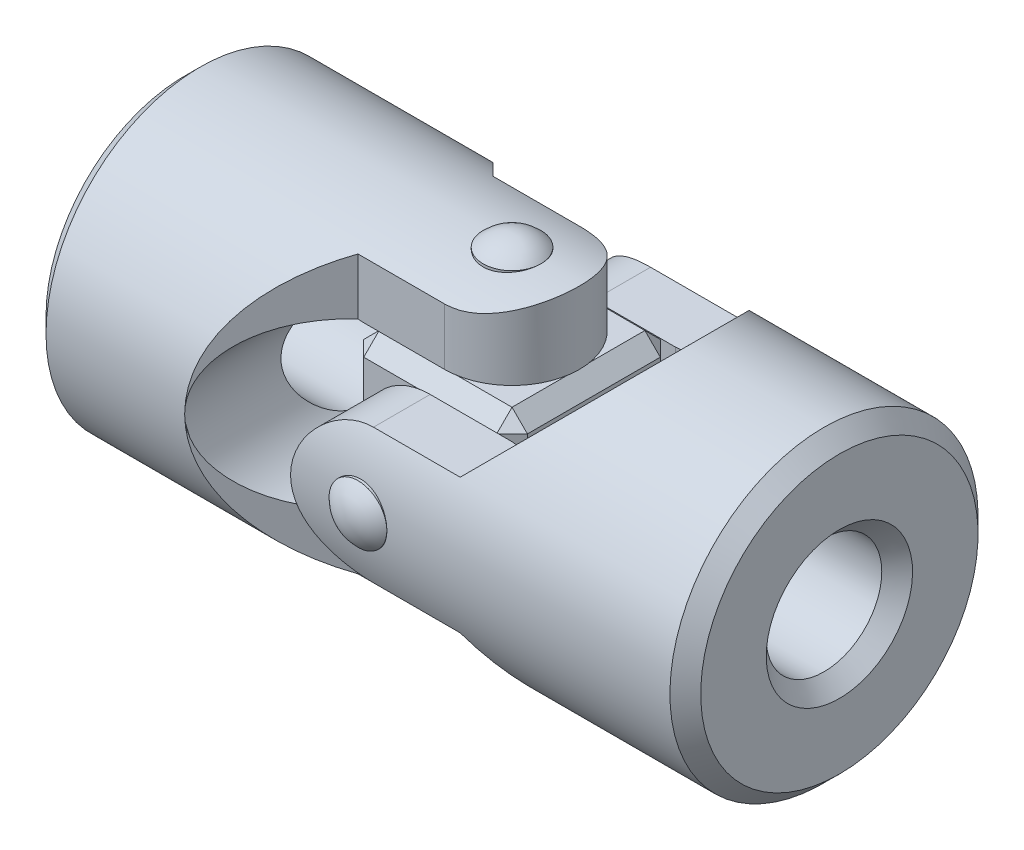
ISO-10303-21;
HEADER;
FILE_DESCRIPTION(('STEP AP214'),'2;1');
FILE_NAME('part.step','',(''),(''),'','','');
FILE_SCHEMA(('AUTOMOTIVE_DESIGN { 1 0 10303 214 1 1 1 1 }'));
ENDSEC;
DATA;
#1=APPLICATION_CONTEXT('core data for automotive mechanical design processes');
#2=APPLICATION_PROTOCOL_DEFINITION('international standard','automotive_design',2000,#1);
#3=PRODUCT_CONTEXT('',#1,'mechanical');
#4=PRODUCT('Part','Part','',(#3));
#5=PRODUCT_RELATED_PRODUCT_CATEGORY('part','',(#4));
#6=PRODUCT_DEFINITION_FORMATION('','',#4);
#7=PRODUCT_DEFINITION_CONTEXT('part definition',#1,'design');
#8=PRODUCT_DEFINITION('design','',#6,#7);
#9=PRODUCT_DEFINITION_SHAPE('','',#8);
#10=(LENGTH_UNIT() NAMED_UNIT(*) SI_UNIT(.MILLI.,.METRE.));
#11=(NAMED_UNIT(*) PLANE_ANGLE_UNIT() SI_UNIT($,.RADIAN.));
#12=(NAMED_UNIT(*) SI_UNIT($,.STERADIAN.) SOLID_ANGLE_UNIT());
#13=UNCERTAINTY_MEASURE_WITH_UNIT(LENGTH_MEASURE(1.E-05),#10,'distance_accuracy_value','');
#14=(GEOMETRIC_REPRESENTATION_CONTEXT(3) GLOBAL_UNCERTAINTY_ASSIGNED_CONTEXT((#13)) GLOBAL_UNIT_ASSIGNED_CONTEXT((#10,
#11,#12)) REPRESENTATION_CONTEXT('',''));
#15=CARTESIAN_POINT('',(0.,0.,0.));
#16=DIRECTION('',(0.,0.,1.));
#17=DIRECTION('',(1.,0.,0.));
#18=AXIS2_PLACEMENT_3D('',#15,#16,#17);
#19=CARTESIAN_POINT('',(0.,8.,0.));
#20=DIRECTION('',(0.,-1.,0.));
#21=DIRECTION('',(-1.,0.,0.));
#22=AXIS2_PLACEMENT_3D('',#19,#20,#21);
#23=CYLINDRICAL_SURFACE('',#22,1.5);
#24=CARTESIAN_POINT('',(0.,8.,0.));
#25=DIRECTION('',(0.,1.,0.));
#26=DIRECTION('',(1.,0.,0.));
#27=AXIS2_PLACEMENT_3D('',#24,#25,#26);
#28=CIRCLE('',#27,1.5);
#29=CARTESIAN_POINT('',(1.5,8.,0.));
#30=VERTEX_POINT('',#29);
#31=EDGE_CURVE('P0_E10',#30,#30,#28,.T.);
#32=ORIENTED_EDGE('',*,*,#31,.F.);
#33=EDGE_LOOP('',(#32));
#34=FACE_BOUND('',#33,.T.);
#35=CARTESIAN_POINT('',(0.,-8.00000000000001,0.));
#36=DIRECTION('',(0.,-1.,0.));
#37=DIRECTION('',(0.,0.,-1.));
#38=AXIS2_PLACEMENT_3D('',#35,#36,#37);
#39=CIRCLE('',#38,1.5);
#40=CARTESIAN_POINT('',(0.,-8.,-1.5));
#41=VERTEX_POINT('',#40);
#42=EDGE_CURVE('P0_E20',#41,#41,#39,.T.);
#43=ORIENTED_EDGE('',*,*,#42,.F.);
#44=EDGE_LOOP('',(#43));
#45=FACE_BOUND('',#44,.T.);
#46=ADVANCED_FACE('P0_F14',(#34,#45),#23,.T.);
#47=CARTESIAN_POINT('',(0.,6.56218750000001,0.));
#48=DIRECTION('',(0.,-1.,0.));
#49=DIRECTION('',(0.,0.,-1.));
#50=AXIS2_PLACEMENT_3D('',#47,#48,#49);
#51=SPHERICAL_SURFACE('',#50,2.07781249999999);
#52=ORIENTED_EDGE('',*,*,#31,.T.);
#53=EDGE_LOOP('',(#52));
#54=FACE_BOUND('',#53,.T.);
#55=ADVANCED_FACE('P0_F29',(#54),#51,.T.);
#56=CARTESIAN_POINT('',(0.,-6.56218750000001,0.));
#57=DIRECTION('',(0.,1.,0.));
#58=DIRECTION('',(0.,0.,-1.));
#59=AXIS2_PLACEMENT_3D('',#56,#57,#58);
#60=SPHERICAL_SURFACE('',#59,2.07781249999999);
#61=ORIENTED_EDGE('',*,*,#42,.T.);
#62=EDGE_LOOP('',(#61));
#63=FACE_BOUND('',#62,.T.);
#64=ADVANCED_FACE('P0_F26',(#63),#60,.T.);
#65=CLOSED_SHELL('',(#46,#55,#64));
#66=MANIFOLD_SOLID_BREP('P0_B1',#65);
#67=CARTESIAN_POINT('',(0.,0.,8.));
#68=DIRECTION('',(0.,0.,-1.));
#69=DIRECTION('',(-1.,0.,0.));
#70=AXIS2_PLACEMENT_3D('',#67,#68,#69);
#71=CYLINDRICAL_SURFACE('',#70,1.5);
#72=CARTESIAN_POINT('',(0.,0.,8.));
#73=DIRECTION('',(0.,0.,1.));
#74=DIRECTION('',(1.,0.,0.));
#75=AXIS2_PLACEMENT_3D('',#72,#73,#74);
#76=CIRCLE('',#75,1.5);
#77=CARTESIAN_POINT('',(1.5,0.,8.));
#78=VERTEX_POINT('',#77);
#79=EDGE_CURVE('P1_E10',#78,#78,#76,.T.);
#80=ORIENTED_EDGE('',*,*,#79,.F.);
#81=EDGE_LOOP('',(#80));
#82=FACE_BOUND('',#81,.T.);
#83=CARTESIAN_POINT('',(0.,0.,-8.00000000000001));
#84=DIRECTION('',(0.,0.,-1.));
#85=DIRECTION('',(0.,1.,0.));
#86=AXIS2_PLACEMENT_3D('',#83,#84,#85);
#87=CIRCLE('',#86,1.5);
#88=CARTESIAN_POINT('',(0.,1.5,-8.));
#89=VERTEX_POINT('',#88);
#90=EDGE_CURVE('P1_E20',#89,#89,#87,.T.);
#91=ORIENTED_EDGE('',*,*,#90,.F.);
#92=EDGE_LOOP('',(#91));
#93=FACE_BOUND('',#92,.T.);
#94=ADVANCED_FACE('P1_F14',(#82,#93),#71,.T.);
#95=CARTESIAN_POINT('',(0.,0.,6.56218750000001));
#96=DIRECTION('',(0.,0.,-1.));
#97=DIRECTION('',(0.,1.,0.));
#98=AXIS2_PLACEMENT_3D('',#95,#96,#97);
#99=SPHERICAL_SURFACE('',#98,2.07781249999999);
#100=ORIENTED_EDGE('',*,*,#79,.T.);
#101=EDGE_LOOP('',(#100));
#102=FACE_BOUND('',#101,.T.);
#103=ADVANCED_FACE('P1_F29',(#102),#99,.T.);
#104=CARTESIAN_POINT('',(0.,0.,-6.56218750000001));
#105=DIRECTION('',(0.,0.,1.));
#106=DIRECTION('',(0.,1.,0.));
#107=AXIS2_PLACEMENT_3D('',#104,#105,#106);
#108=SPHERICAL_SURFACE('',#107,2.07781249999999);
#109=ORIENTED_EDGE('',*,*,#90,.T.);
#110=EDGE_LOOP('',(#109));
#111=FACE_BOUND('',#110,.T.);
#112=ADVANCED_FACE('P1_F26',(#111),#108,.T.);
#113=CLOSED_SHELL('',(#94,#103,#112));
#114=MANIFOLD_SOLID_BREP('P1_B1',#113);
#115=CARTESIAN_POINT('',(0.,-8.,-3.5));
#116=DIRECTION('',(0.,0.,1.));
#117=DIRECTION('',(1.,0.,0.));
#118=AXIS2_PLACEMENT_3D('',#115,#116,#117);
#119=PLANE('',#118);
#120=DIRECTION('',(0.,1.,0.));
#121=VECTOR('',#120,1.);
#122=CARTESIAN_POINT('',(0.,-8.,-3.5));
#123=LINE('',#122,#121);
#124=CARTESIAN_POINT('',(0.,4.24999999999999,-3.5));
#125=VERTEX_POINT('',#124);
#126=CARTESIAN_POINT('',(0.,7.19374728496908,-3.5));
#127=VERTEX_POINT('',#126);
#128=EDGE_CURVE('P2_E283',#125,#127,#123,.T.);
#129=ORIENTED_EDGE('',*,*,#128,.F.);
#130=DIRECTION('',(-1.,0.,0.));
#131=VECTOR('',#130,1.);
#132=CARTESIAN_POINT('',(0.,4.24999999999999,-3.5));
#133=LINE('',#132,#131);
#134=CARTESIAN_POINT('',(-4.25,4.25,-3.5));
#135=VERTEX_POINT('',#134);
#136=EDGE_CURVE('P2_E132',#125,#135,#133,.T.);
#137=ORIENTED_EDGE('',*,*,#136,.T.);
#138=CARTESIAN_POINT('',(-4.72368421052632,0.,-3.5));
#139=DIRECTION('',(0.,0.,1.));
#140=DIRECTION('',(1.,0.,0.));
#141=AXIS2_PLACEMENT_3D('',#138,#139,#140);
#142=CIRCLE('',#141,4.27631578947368);
#143=CARTESIAN_POINT('',(-4.50000000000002,4.27046157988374,-3.5));
#144=VERTEX_POINT('',#143);
#145=EDGE_CURVE('P2_E147',#135,#144,#142,.T.);
#146=ORIENTED_EDGE('',*,*,#145,.T.);
#147=DIRECTION('',(0.,1.,0.));
#148=VECTOR('',#147,1.);
#149=CARTESIAN_POINT('',(-4.50000000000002,-8.,-3.5));
#150=LINE('',#149,#148);
#151=CARTESIAN_POINT('',(-4.50000000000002,7.19374728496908,-3.5));
#152=VERTEX_POINT('',#151);
#153=EDGE_CURVE('P2_E290',#144,#152,#150,.T.);
#154=ORIENTED_EDGE('',*,*,#153,.T.);
#155=DIRECTION('',(1.,0.,0.));
#156=VECTOR('',#155,1.);
#157=CARTESIAN_POINT('',(-17.,7.19374728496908,-3.5));
#158=LINE('',#157,#156);
#159=EDGE_CURVE('P2_E228',#127,#152,#158,.F.);
#160=ORIENTED_EDGE('',*,*,#159,.F.);
#161=EDGE_LOOP('',(#129,#137,#146,#154,#160));
#162=FACE_BOUND('',#161,.T.);
#163=ADVANCED_FACE('P2_F16',(#162),#119,.F.);
#164=CARTESIAN_POINT('',(-4.50000000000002,-8.,-3.5));
#165=DIRECTION('',(-0.707106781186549,0.,0.707106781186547));
#166=DIRECTION('',(0.707106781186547,0.,0.707106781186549));
#167=AXIS2_PLACEMENT_3D('',#164,#165,#166);
#168=PLANE('',#167);
#169=CARTESIAN_POINT('',(-1.00000000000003,0.,0.));
#170=DIRECTION('',(-0.707106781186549,0.,0.707106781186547));
#171=DIRECTION('',(0.707106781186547,0.,0.707106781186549));
#172=AXIS2_PLACEMENT_3D('',#169,#170,#171);
#173=ELLIPSE('',#172,11.3137084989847,8.);
#174=CARTESIAN_POINT('',(-9.00000000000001,0.,-8.));
#175=VERTEX_POINT('',#174);
#176=CARTESIAN_POINT('',(-4.50000000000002,-7.19374728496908,-3.5));
#177=VERTEX_POINT('',#176);
#178=EDGE_CURVE('P2_E231',#175,#177,#173,.T.);
#179=ORIENTED_EDGE('',*,*,#178,.F.);
#180=CARTESIAN_POINT('',(-4.72368421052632,0.,-3.7236842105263));
#181=DIRECTION('',(-0.707106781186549,0.,0.707106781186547));
#182=DIRECTION('',(-0.707106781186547,0.,-0.707106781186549));
#183=AXIS2_PLACEMENT_3D('',#180,#181,#182);
#184=ELLIPSE('',#183,6.0476237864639,4.27631578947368);
#185=CARTESIAN_POINT('',(-4.50000000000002,-4.27046157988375,-3.5));
#186=VERTEX_POINT('',#185);
#187=EDGE_CURVE('P2_E144',#175,#186,#184,.T.);
#188=ORIENTED_EDGE('',*,*,#187,.T.);
#189=EDGE_CURVE('P2_E287',#177,#186,#150,.T.);
#190=ORIENTED_EDGE('',*,*,#189,.F.);
#191=EDGE_LOOP('',(#179,#188,#190));
#192=FACE_BOUND('',#191,.T.);
#193=ADVANCED_FACE('P2_F182',(#192),#168,.F.);
#194=CARTESIAN_POINT('',(-4.50000000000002,-8.,3.5));
#195=DIRECTION('',(-0.707106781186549,0.,-0.707106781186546));
#196=DIRECTION('',(-0.707106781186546,0.,0.707106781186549));
#197=AXIS2_PLACEMENT_3D('',#194,#195,#196);
#198=PLANE('',#197);
#199=DIRECTION('',(0.,1.,0.));
#200=VECTOR('',#199,1.);
#201=CARTESIAN_POINT('',(-4.50000000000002,-8.,3.5));
#202=LINE('',#201,#200);
#203=CARTESIAN_POINT('',(-4.50000000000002,-7.19374728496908,3.5));
#204=VERTEX_POINT('',#203);
#205=CARTESIAN_POINT('',(-4.50000000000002,-4.27046157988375,3.5));
#206=VERTEX_POINT('',#205);
#207=EDGE_CURVE('P2_E39',#204,#206,#202,.T.);
#208=ORIENTED_EDGE('',*,*,#207,.T.);
#209=CARTESIAN_POINT('',(-4.72368421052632,0.,3.7236842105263));
#210=DIRECTION('',(-0.707106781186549,0.,-0.707106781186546));
#211=DIRECTION('',(0.707106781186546,0.,-0.707106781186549));
#212=AXIS2_PLACEMENT_3D('',#209,#210,#211);
#213=ELLIPSE('',#212,6.0476237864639,4.27631578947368);
#214=CARTESIAN_POINT('',(-9.,0.,8.));
#215=VERTEX_POINT('',#214);
#216=EDGE_CURVE('P2_E107',#206,#215,#213,.T.);
#217=ORIENTED_EDGE('',*,*,#216,.T.);
#218=CARTESIAN_POINT('',(-1.00000000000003,0.,0.));
#219=DIRECTION('',(-0.707106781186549,0.,-0.707106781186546));
#220=DIRECTION('',(0.707106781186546,0.,-0.707106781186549));
#221=AXIS2_PLACEMENT_3D('',#218,#219,#220);
#222=ELLIPSE('',#221,11.3137084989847,8.);
#223=EDGE_CURVE('P2_E242',#204,#215,#222,.T.);
#224=ORIENTED_EDGE('',*,*,#223,.F.);
#225=EDGE_LOOP('',(#208,#217,#224));
#226=FACE_BOUND('',#225,.T.);
#227=ADVANCED_FACE('P2_F186',(#226),#198,.F.);
#228=CARTESIAN_POINT('',(0.,-8.,3.5));
#229=DIRECTION('',(0.,0.,-1.));
#230=DIRECTION('',(-1.,0.,0.));
#231=AXIS2_PLACEMENT_3D('',#228,#229,#230);
#232=PLANE('',#231);
#233=CARTESIAN_POINT('',(-4.72368421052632,0.,3.5));
#234=DIRECTION('',(0.,0.,-1.));
#235=DIRECTION('',(-1.,0.,0.));
#236=AXIS2_PLACEMENT_3D('',#233,#234,#235);
#237=CIRCLE('',#236,4.27631578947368);
#238=CARTESIAN_POINT('',(-4.50000000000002,4.27046157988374,3.5));
#239=VERTEX_POINT('',#238);
#240=CARTESIAN_POINT('',(-4.25,4.25,3.5));
#241=VERTEX_POINT('',#240);
#242=EDGE_CURVE('P2_E108',#239,#241,#237,.T.);
#243=ORIENTED_EDGE('',*,*,#242,.T.);
#244=DIRECTION('',(1.,0.,0.));
#245=VECTOR('',#244,1.);
#246=CARTESIAN_POINT('',(0.,4.24999999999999,3.5));
#247=LINE('',#246,#245);
#248=CARTESIAN_POINT('',(0.,4.24999999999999,3.5));
#249=VERTEX_POINT('',#248);
#250=EDGE_CURVE('P2_E129',#241,#249,#247,.T.);
#251=ORIENTED_EDGE('',*,*,#250,.T.);
#252=DIRECTION('',(0.,1.,0.));
#253=VECTOR('',#252,1.);
#254=CARTESIAN_POINT('',(0.,-8.,3.5));
#255=LINE('',#254,#253);
#256=CARTESIAN_POINT('',(0.,7.19374728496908,3.5));
#257=VERTEX_POINT('',#256);
#258=EDGE_CURVE('P2_E155',#249,#257,#255,.T.);
#259=ORIENTED_EDGE('',*,*,#258,.T.);
#260=DIRECTION('',(1.,0.,0.));
#261=VECTOR('',#260,1.);
#262=CARTESIAN_POINT('',(-17.,7.19374728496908,3.5));
#263=LINE('',#262,#261);
#264=CARTESIAN_POINT('',(-4.50000000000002,7.19374728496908,3.5));
#265=VERTEX_POINT('',#264);
#266=EDGE_CURVE('P2_E245',#265,#257,#263,.T.);
#267=ORIENTED_EDGE('',*,*,#266,.F.);
#268=EDGE_CURVE('P2_E293',#239,#265,#202,.T.);
#269=ORIENTED_EDGE('',*,*,#268,.F.);
#270=EDGE_LOOP('',(#243,#251,#259,#267,#269));
#271=FACE_BOUND('',#270,.T.);
#272=ADVANCED_FACE('P2_F189',(#271),#232,.F.);
#273=CARTESIAN_POINT('',(0.,-8.,0.));
#274=DIRECTION('',(0.,1.,0.));
#275=DIRECTION('',(0.,0.,-1.));
#276=AXIS2_PLACEMENT_3D('',#273,#274,#275);
#277=CYLINDRICAL_SURFACE('',#276,3.5);
#278=ORIENTED_EDGE('',*,*,#258,.F.);
#279=CARTESIAN_POINT('',(0.,4.24999999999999,0.));
#280=DIRECTION('',(0.,1.,0.));
#281=DIRECTION('',(1.,0.,0.));
#282=AXIS2_PLACEMENT_3D('',#279,#280,#281);
#283=CIRCLE('',#282,3.5);
#284=EDGE_CURVE('P2_E109',#249,#125,#283,.T.);
#285=ORIENTED_EDGE('',*,*,#284,.T.);
#286=ORIENTED_EDGE('',*,*,#128,.T.);
#287=CARTESIAN_POINT('',(0.,7.19374728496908,3.5));
#288=CARTESIAN_POINT('',(0.0932957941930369,7.19372533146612,3.50001485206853));
#289=CARTESIAN_POINT('',(0.186579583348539,7.19556167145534,3.49627011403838));
#290=CARTESIAN_POINT('',(0.372374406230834,7.20278647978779,3.4813778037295));
#291=CARTESIAN_POINT('',(0.464885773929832,7.2081733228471,3.47023361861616));
#292=CARTESIAN_POINT('',(0.648055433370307,7.22230269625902,3.44072593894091));
#293=CARTESIAN_POINT('',(0.738720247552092,7.23102982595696,3.42239556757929));
#294=CARTESIAN_POINT('',(0.917975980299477,7.25153356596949,3.37873357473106));
#295=CARTESIAN_POINT('',(1.00656673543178,7.26331041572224,3.35340140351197));
#296=CARTESIAN_POINT('',(1.26809201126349,7.30263567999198,3.26734176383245));
#297=CARTESIAN_POINT('',(1.43720714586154,7.33421456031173,3.19648107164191));
#298=CARTESIAN_POINT('',(1.76124275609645,7.40451270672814,3.03006841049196));
#299=CARTESIAN_POINT('',(1.91614645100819,7.44324025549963,2.93448774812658));
#300=CARTESIAN_POINT('',(2.21786894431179,7.52639594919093,2.71440937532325));
#301=CARTESIAN_POINT('',(2.36359659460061,7.57102847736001,2.58848970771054));
#302=CARTESIAN_POINT('',(2.63265746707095,7.6592884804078,2.31431003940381));
#303=CARTESIAN_POINT('',(2.75598561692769,7.70291572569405,2.16604499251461));
#304=CARTESIAN_POINT('',(2.98262926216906,7.78681229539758,1.84249399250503));
#305=CARTESIAN_POINT('',(3.08467497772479,7.82681398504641,1.6662427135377));
#306=CARTESIAN_POINT('',(3.25718263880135,7.89639046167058,1.29700584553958));
#307=CARTESIAN_POINT('',(3.32766004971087,7.92597035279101,1.10402850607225));
#308=CARTESIAN_POINT('',(3.43095112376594,7.96990387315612,0.718417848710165));
#309=CARTESIAN_POINT('',(3.46567328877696,7.98502555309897,0.526385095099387));
#310=CARTESIAN_POINT('',(3.50266321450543,8.00114702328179,0.138661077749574));
#311=CARTESIAN_POINT('',(3.50494500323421,8.00215291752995,-0.0570285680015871));
#312=CARTESIAN_POINT('',(3.47792705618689,7.99036087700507,-0.432525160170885));
#313=CARTESIAN_POINT('',(3.45073213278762,7.97848288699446,-0.612518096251));
#314=CARTESIAN_POINT('',(3.36917855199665,7.9435515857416,-0.965080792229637));
#315=CARTESIAN_POINT('',(3.31481838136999,7.92049765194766,-1.13765013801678));
#316=CARTESIAN_POINT('',(3.17987316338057,7.86497091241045,-1.47366940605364));
#317=CARTESIAN_POINT('',(3.09889986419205,7.83235948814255,-1.63693955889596));
#318=CARTESIAN_POINT('',(2.91343456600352,7.76084946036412,-1.94800600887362));
#319=CARTESIAN_POINT('',(2.80893371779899,7.72194849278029,-2.09579645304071));
#320=CARTESIAN_POINT('',(2.57009782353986,7.6381919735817,-2.38373560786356));
#321=CARTESIAN_POINT('',(2.434092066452,7.59310855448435,-2.52243490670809));
#322=CARTESIAN_POINT('',(2.14077752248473,7.50422338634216,-2.77573159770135));
#323=CARTESIAN_POINT('',(1.98345638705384,7.46042239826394,-2.89031491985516));
#324=CARTESIAN_POINT('',(1.6439734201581,7.37730715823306,-3.09648762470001));
#325=CARTESIAN_POINT('',(1.46107120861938,7.33824145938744,-3.18697793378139));
#326=CARTESIAN_POINT('',(1.17596812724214,7.28862796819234,-3.29811031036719));
#327=CARTESIAN_POINT('',(1.07917515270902,7.27359105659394,-3.33104724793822));
#328=CARTESIAN_POINT('',(0.882645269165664,7.24704045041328,-3.38842152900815));
#329=CARTESIAN_POINT('',(0.78290968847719,7.23552519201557,-3.41286264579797));
#330=CARTESIAN_POINT('',(0.57019840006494,7.21545369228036,-3.45512272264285));
#331=CARTESIAN_POINT('',(0.456973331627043,7.20736243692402,-3.47191715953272));
#332=CARTESIAN_POINT('',(0.229173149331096,7.19648416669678,-3.49437331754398));
#333=CARTESIAN_POINT('',(0.114597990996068,7.19369732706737,-3.5000346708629));
#334=CARTESIAN_POINT('',(0.,7.19374728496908,-3.5));
#335=B_SPLINE_CURVE_WITH_KNOTS('',3,(#287,#288,#289,#290,#291,#292,#293,#294,#295,#296,#297,
#298,#299,#300,#301,#302,#303,#304,#305,#306,#307,#308,#309,#310,#311,#312,#313,#314,#315,#316,
#317,#318,#319,#320,#321,#322,#323,#324,#325,#326,#327,#328,#329,#330,#331,#332,#333,#334),
.UNSPECIFIED.,.F.,.F.,(4,2,2,2,2,2,2,2,2,2,2,2,2,2,2,2,2,2,2,2,2,2,2,4),(0.,0.279774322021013,
0.559420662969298,0.837792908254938,1.11618701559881,1.6716872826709,2.22783525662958,
2.81835086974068,3.40900003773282,4.02846300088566,4.64762215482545,5.23168448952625,
5.81549425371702,6.36020569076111,6.90494747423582,7.45801796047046,8.01129681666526,
8.60689990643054,9.20284953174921,9.82256266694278,10.1322191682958,10.4417379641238,
10.78531281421,11.1288990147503),.UNSPECIFIED.);
#336=EDGE_CURVE('P2_E204',#257,#127,#335,.T.);
#337=ORIENTED_EDGE('',*,*,#336,.F.);
#338=EDGE_LOOP('',(#278,#285,#286,#337));
#339=FACE_BOUND('',#338,.T.);
#340=ADVANCED_FACE('P2_F193',(#339),#277,.T.);
#341=CARTESIAN_POINT('',(-17.,0.,0.));
#342=DIRECTION('',(-1.,0.,0.));
#343=DIRECTION('',(0.,0.,1.));
#344=AXIS2_PLACEMENT_3D('',#341,#342,#343);
#345=PLANE('',#344);
#346=CARTESIAN_POINT('',(-17.,0.,0.));
#347=DIRECTION('',(-1.,0.,0.));
#348=DIRECTION('',(0.,0.,1.));
#349=AXIS2_PLACEMENT_3D('',#346,#347,#348);
#350=CIRCLE('',#349,3.8);
#351=CARTESIAN_POINT('',(-17.,0.,3.8));
#352=VERTEX_POINT('',#351);
#353=EDGE_CURVE('P2_E24',#352,#352,#350,.F.);
#354=ORIENTED_EDGE('',*,*,#353,.T.);
#355=EDGE_LOOP('',(#354));
#356=FACE_BOUND('',#355,.T.);
#357=CARTESIAN_POINT('',(-17.,0.,0.));
#358=DIRECTION('',(-1.,0.,0.));
#359=DIRECTION('',(0.,0.,1.));
#360=AXIS2_PLACEMENT_3D('',#357,#358,#359);
#361=CIRCLE('',#360,7.2);
#362=CARTESIAN_POINT('',(-17.,0.,7.2));
#363=VERTEX_POINT('',#362);
#364=EDGE_CURVE('P2_E255',#363,#363,#361,.T.);
#365=ORIENTED_EDGE('',*,*,#364,.T.);
#366=EDGE_LOOP('',(#365));
#367=FACE_BOUND('',#366,.T.);
#368=ADVANCED_FACE('P2_F214',(#356,#367),#345,.T.);
#369=CARTESIAN_POINT('',(-17.,0.,0.));
#370=DIRECTION('',(1.,0.,0.));
#371=DIRECTION('',(0.,0.,-1.));
#372=AXIS2_PLACEMENT_3D('',#369,#370,#371);
#373=CYLINDRICAL_SURFACE('',#372,8.);
#374=CARTESIAN_POINT('',(-16.2,0.,0.));
#375=DIRECTION('',(-1.,0.,0.));
#376=DIRECTION('',(0.,0.,1.));
#377=AXIS2_PLACEMENT_3D('',#374,#375,#376);
#378=CIRCLE('',#377,8.);
#379=CARTESIAN_POINT('',(-16.2,0.,8.));
#380=VERTEX_POINT('',#379);
#381=EDGE_CURVE('P2_E11',#380,#380,#378,.F.);
#382=ORIENTED_EDGE('',*,*,#381,.T.);
#383=EDGE_LOOP('',(#382));
#384=FACE_BOUND('',#383,.T.);
#385=CARTESIAN_POINT('',(1.5,-8.,0.));
#386=CARTESIAN_POINT('',(1.49999681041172,-7.99999848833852,-0.0834717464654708));
#387=CARTESIAN_POINT('',(1.49300892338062,-7.99868009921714,-0.166984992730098));
#388=CARTESIAN_POINT('',(1.46526000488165,-7.9935478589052,-0.331658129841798));
#389=CARTESIAN_POINT('',(1.44448734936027,-7.98973190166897,-0.412815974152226));
#390=CARTESIAN_POINT('',(1.38982729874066,-7.98003138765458,-0.570372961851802));
#391=CARTESIAN_POINT('',(1.35595174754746,-7.97414869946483,-0.646776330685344));
#392=CARTESIAN_POINT('',(1.27608112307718,-7.96095710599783,-0.792807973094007));
#393=CARTESIAN_POINT('',(1.23008703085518,-7.9536483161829,-0.862436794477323));
#394=CARTESIAN_POINT('',(1.12670023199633,-7.93831336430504,-0.993783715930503));
#395=CARTESIAN_POINT('',(1.06919055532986,-7.93028034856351,-1.05540895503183));
#396=CARTESIAN_POINT('',(0.94465669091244,-7.9144531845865,-1.16819606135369));
#397=CARTESIAN_POINT('',(0.877631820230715,-7.90665905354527,-1.21935717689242));
#398=CARTESIAN_POINT('',(0.73531391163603,-7.89212551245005,-1.31014998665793));
#399=CARTESIAN_POINT('',(0.659959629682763,-7.88539493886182,-1.34968721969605));
#400=CARTESIAN_POINT('',(0.50353108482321,-7.87384713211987,-1.41550524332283));
#401=CARTESIAN_POINT('',(0.422457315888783,-7.86902973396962,-1.44178717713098));
#402=CARTESIAN_POINT('',(0.257884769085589,-7.8619226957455,-1.480050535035));
#403=CARTESIAN_POINT('',(0.174424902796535,-7.85960445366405,-1.49219390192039));
#404=CARTESIAN_POINT('',(0.0066226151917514,-7.85767197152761,-1.50233808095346));
#405=CARTESIAN_POINT('',(-0.0777197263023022,-7.8580574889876,-1.50034016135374));
#406=CARTESIAN_POINT('',(-0.243719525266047,-7.86146292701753,-1.48238979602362));
#407=CARTESIAN_POINT('',(-0.325397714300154,-7.86444808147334,-1.46662149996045));
#408=CARTESIAN_POINT('',(-0.484928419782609,-7.87266183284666,-1.42186799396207));
#409=CARTESIAN_POINT('',(-0.562780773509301,-7.87789052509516,-1.39288222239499));
#410=CARTESIAN_POINT('',(-0.712988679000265,-7.89003855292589,-1.322336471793));
#411=CARTESIAN_POINT('',(-0.785308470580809,-7.89696783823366,-1.28070213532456));
#412=CARTESIAN_POINT('',(-0.922004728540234,-7.91172971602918,-1.18609368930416));
#413=CARTESIAN_POINT('',(-0.986380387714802,-7.91956240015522,-1.13311842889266));
#414=CARTESIAN_POINT('',(-1.10642495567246,-7.93540001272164,-1.01633905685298));
#415=CARTESIAN_POINT('',(-1.16194065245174,-7.94340571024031,-0.952377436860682));
#416=CARTESIAN_POINT('',(-1.26147724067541,-7.95857386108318,-0.815968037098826));
#417=CARTESIAN_POINT('',(-1.30549801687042,-7.96573630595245,-0.743520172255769));
#418=CARTESIAN_POINT('',(-1.38081775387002,-7.97842539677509,-0.592034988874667));
#419=CARTESIAN_POINT('',(-1.4121007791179,-7.98394999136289,-0.512989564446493));
#420=CARTESIAN_POINT('',(-1.46090209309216,-7.99272505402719,-0.350639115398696));
#421=CARTESIAN_POINT('',(-1.47842184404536,-7.99597576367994,-0.267334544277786));
#422=CARTESIAN_POINT('',(-1.49898603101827,-7.99980360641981,-0.100148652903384));
#423=CARTESIAN_POINT('',(-1.50224039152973,-8.00041950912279,-0.0162940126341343));
#424=CARTESIAN_POINT('',(-1.49474452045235,-7.99901543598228,0.150761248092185));
#425=CARTESIAN_POINT('',(-1.48399497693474,-7.99699558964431,0.233961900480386));
#426=CARTESIAN_POINT('',(-1.44897096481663,-7.99057111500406,0.396681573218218));
#427=CARTESIAN_POINT('',(-1.42480271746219,-7.98618522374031,0.476224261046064));
#428=CARTESIAN_POINT('',(-1.36374229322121,-7.97551842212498,0.630128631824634));
#429=CARTESIAN_POINT('',(-1.32684925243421,-7.96923738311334,0.704489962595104));
#430=CARTESIAN_POINT('',(-1.24092187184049,-7.95538030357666,0.846816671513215));
#431=CARTESIAN_POINT('',(-1.19175926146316,-7.94779086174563,0.914703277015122));
#432=CARTESIAN_POINT('',(-1.08286186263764,-7.93219343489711,1.04133832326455));
#433=CARTESIAN_POINT('',(-1.02312608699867,-7.92418541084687,1.10008590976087));
#434=CARTESIAN_POINT('',(-0.893827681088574,-7.9085247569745,1.20757295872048));
#435=CARTESIAN_POINT('',(-0.824145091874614,-7.90087825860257,1.25616916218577));
#436=CARTESIAN_POINT('',(-0.677482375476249,-7.88692985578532,1.34096675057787));
#437=CARTESIAN_POINT('',(-0.600502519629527,-7.8806279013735,1.37716859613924));
#438=CARTESIAN_POINT('',(-0.441794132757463,-7.87013024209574,1.43594673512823));
#439=CARTESIAN_POINT('',(-0.360090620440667,-7.86592440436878,1.45858868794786));
#440=CARTESIAN_POINT('',(-0.193952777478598,-7.86007203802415,1.48980679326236));
#441=CARTESIAN_POINT('',(-0.109518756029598,-7.8584252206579,1.49838453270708));
#442=CARTESIAN_POINT('',(0.0582483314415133,-7.85789199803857,1.50117762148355));
#443=CARTESIAN_POINT('',(0.141577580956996,-7.85896215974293,1.49561895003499));
#444=CARTESIAN_POINT('',(0.306091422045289,-7.86364600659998,1.47079175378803));
#445=CARTESIAN_POINT('',(0.387276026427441,-7.86725967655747,1.45152331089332));
#446=CARTESIAN_POINT('',(0.545074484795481,-7.8766050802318,1.39991887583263));
#447=CARTESIAN_POINT('',(0.62169659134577,-7.88233284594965,1.36760735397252));
#448=CARTESIAN_POINT('',(0.768468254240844,-7.8952638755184,1.29085868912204));
#449=CARTESIAN_POINT('',(0.838617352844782,-7.90246724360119,1.24642068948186));
#450=CARTESIAN_POINT('',(0.971583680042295,-7.91767266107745,1.14589487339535));
#451=CARTESIAN_POINT('',(1.0342754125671,-7.92568505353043,1.08964259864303));
#452=CARTESIAN_POINT('',(1.14940516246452,-7.94152833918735,0.96742792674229));
#453=CARTESIAN_POINT('',(1.20184082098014,-7.94935919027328,0.901463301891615));
#454=CARTESIAN_POINT('',(1.29541095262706,-7.96403975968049,0.760984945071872));
#455=CARTESIAN_POINT('',(1.33643942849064,-7.97088000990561,0.686399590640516));
#456=CARTESIAN_POINT('',(1.40531763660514,-7.98271619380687,0.531290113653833));
#457=CARTESIAN_POINT('',(1.43317974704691,-7.98771385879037,0.450771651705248));
#458=CARTESIAN_POINT('',(1.46927731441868,-7.99428290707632,0.308347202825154));
#459=CARTESIAN_POINT('',(1.4807786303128,-7.99641470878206,0.24727381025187));
#460=CARTESIAN_POINT('',(1.49614106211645,-7.9992737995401,0.124141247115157));
#461=CARTESIAN_POINT('',(1.50000237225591,-8.00000112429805,0.0620821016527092));
#462=CARTESIAN_POINT('',(1.5,-8.,0.));
#463=B_SPLINE_CURVE_WITH_KNOTS('',3,(#385,#386,#387,#388,#389,#390,#391,#392,#393,#394,#395,
#396,#397,#398,#399,#400,#401,#402,#403,#404,#405,#406,#407,#408,#409,#410,#411,#412,#413,#414,
#415,#416,#417,#418,#419,#420,#421,#422,#423,#424,#425,#426,#427,#428,#429,#430,#431,#432,#433,
#434,#435,#436,#437,#438,#439,#440,#441,#442,#443,#444,#445,#446,#447,#448,#449,#450,#451,#452,
#453,#454,#455,#456,#457,#458,#459,#460,#461,#462),.UNSPECIFIED.,.T.,.F.,(4,2,2,2,2,2,2,2,2,2,2,
2,2,2,2,2,2,2,2,2,2,2,2,2,2,2,2,2,2,2,2,2,2,2,2,2,2,2,4),(0.,0.250188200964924,
0.500587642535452,0.750761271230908,1.00091465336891,1.25375118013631,1.50660586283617,
1.76146190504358,2.01629596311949,2.26818151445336,2.52004447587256,2.76859000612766,
3.01714609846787,3.26719262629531,3.5172645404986,3.77127768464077,4.02529337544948,
4.27962588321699,4.53393136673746,4.78448174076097,5.03501980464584,5.28360233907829,
5.53220175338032,5.78351778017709,6.03485728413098,6.28953436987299,6.54420198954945,
6.79762627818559,7.05102196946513,7.30039252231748,7.54976158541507,7.79866496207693,
8.04758592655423,8.30023369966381,8.55293951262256,8.80792048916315,9.06266126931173,
9.2487434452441,9.43482089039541),.UNSPECIFIED.);
#464=CARTESIAN_POINT('',(1.5,-8.,0.));
#465=VERTEX_POINT('',#464);
#466=EDGE_CURVE('P2_E223',#465,#465,#463,.T.);
#467=ORIENTED_EDGE('',*,*,#466,.T.);
#468=EDGE_LOOP('',(#467));
#469=FACE_BOUND('',#468,.T.);
#470=CARTESIAN_POINT('',(0.,7.85811682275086,-1.5));
#471=CARTESIAN_POINT('',(0.0834572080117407,7.85811843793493,-1.49999679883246));
#472=CARTESIAN_POINT('',(0.166955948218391,7.85946079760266,-1.49301126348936));
#473=CARTESIAN_POINT('',(0.331598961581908,7.86467851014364,-1.46527253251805));
#474=CARTESIAN_POINT('',(0.412741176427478,7.86855601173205,-1.44450765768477));
#475=CARTESIAN_POINT('',(0.570265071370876,7.87838976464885,-1.38987035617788));
#476=CARTESIAN_POINT('',(0.646651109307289,7.88434407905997,-1.35601013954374));
#477=CARTESIAN_POINT('',(0.792653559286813,7.89765826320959,-1.27617565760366));
#478=CARTESIAN_POINT('',(0.862270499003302,7.90501802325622,-1.23020233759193));
#479=CARTESIAN_POINT('',(0.993630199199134,7.92041614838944,-1.12683678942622));
#480=CARTESIAN_POINT('',(1.05527648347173,7.92846116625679,-1.06932292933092));
#481=CARTESIAN_POINT('',(1.16810438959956,7.94426457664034,-0.944771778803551));
#482=CARTESIAN_POINT('',(1.2192853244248,7.95202295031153,-0.877733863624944));
#483=CARTESIAN_POINT('',(1.31009937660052,7.96645017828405,-0.735403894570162));
#484=CARTESIAN_POINT('',(1.34964153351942,7.97311028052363,-0.660052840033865));
#485=CARTESIAN_POINT('',(1.41546954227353,7.98451608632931,-0.503631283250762));
#486=CARTESIAN_POINT('',(1.44175648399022,7.98926194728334,-0.422561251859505));
#487=CARTESIAN_POINT('',(1.48002954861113,7.99625755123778,-0.258002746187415));
#488=CARTESIAN_POINT('',(1.49217830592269,7.99853565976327,-0.174553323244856));
#489=CARTESIAN_POINT('',(1.5023368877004,8.00043684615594,-0.00677167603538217));
#490=CARTESIAN_POINT('',(1.50034791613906,8.00006015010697,0.0775604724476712));
#491=CARTESIAN_POINT('',(1.48241222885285,7.99671633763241,0.243598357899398));
#492=CARTESIAN_POINT('',(1.46664063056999,7.99378172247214,0.32532376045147));
#493=CARTESIAN_POINT('',(1.42186435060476,7.98568826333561,0.484947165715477));
#494=CARTESIAN_POINT('',(1.3928591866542,7.98052933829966,0.562845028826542));
#495=CARTESIAN_POINT('',(1.3222722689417,7.96851260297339,0.713110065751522));
#496=CARTESIAN_POINT('',(1.2806205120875,7.96164537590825,0.785443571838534));
#497=CARTESIAN_POINT('',(1.18597433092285,7.9469714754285,0.922159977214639));
#498=CARTESIAN_POINT('',(1.13297875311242,7.93916470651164,0.986542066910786));
#499=CARTESIAN_POINT('',(1.01618429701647,7.92333513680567,1.10656561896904));
#500=CARTESIAN_POINT('',(0.952232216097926,7.91531085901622,1.16205790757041));
#501=CARTESIAN_POINT('',(0.815850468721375,7.90006508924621,1.26155171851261));
#502=CARTESIAN_POINT('',(0.743420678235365,7.89284360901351,1.30555307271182));
#503=CARTESIAN_POINT('',(0.591941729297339,7.88001893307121,1.38085852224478));
#504=CARTESIAN_POINT('',(0.512881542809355,7.87441850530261,1.41214093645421));
#505=CARTESIAN_POINT('',(0.350498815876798,7.86551242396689,1.46093656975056));
#506=CARTESIAN_POINT('',(0.267176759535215,7.8622065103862,1.47845134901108));
#507=CARTESIAN_POINT('',(0.0999806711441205,7.85831520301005,1.49899672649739));
#508=CARTESIAN_POINT('',(0.0161338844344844,7.85768955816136,1.50224164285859));
#509=CARTESIAN_POINT('',(-0.150903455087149,7.8591219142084,1.49472968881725));
#510=CARTESIAN_POINT('',(-0.234094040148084,7.86117978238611,1.48397351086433));
#511=CARTESIAN_POINT('',(-0.396752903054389,7.86770980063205,1.44894868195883));
#512=CARTESIAN_POINT('',(-0.476246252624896,7.87216186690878,1.4247923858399));
#513=CARTESIAN_POINT('',(-0.630057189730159,7.88296134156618,1.3637722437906));
#514=CARTESIAN_POINT('',(-0.704374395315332,7.88930888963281,1.32690746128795));
#515=CARTESIAN_POINT('',(-0.84666761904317,7.90327577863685,1.2410235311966));
#516=CARTESIAN_POINT('',(-0.914560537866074,7.91090895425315,1.19186899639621));
#517=CARTESIAN_POINT('',(-1.04121204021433,7.926548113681,1.08298344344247));
#518=CARTESIAN_POINT('',(-1.09996980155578,7.93455413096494,1.02325147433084));
#519=CARTESIAN_POINT('',(-1.20748376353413,7.95016624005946,0.893949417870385));
#520=CARTESIAN_POINT('',(-1.25609582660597,7.95776555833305,0.82425853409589));
#521=CARTESIAN_POINT('',(-1.34092120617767,7.97159404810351,0.67757452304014));
#522=CARTESIAN_POINT('',(-1.37713500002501,7.97782327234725,0.600581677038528));
#523=CARTESIAN_POINT('',(-1.43592009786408,7.98818057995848,0.441877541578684));
#524=CARTESIAN_POINT('',(-1.45856218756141,7.99231954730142,0.360193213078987));
#525=CARTESIAN_POINT('',(-1.48978704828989,7.99807642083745,0.194096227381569));
#526=CARTESIAN_POINT('',(-1.49837129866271,7.99969459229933,0.10968385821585));
#527=CARTESIAN_POINT('',(-1.50118530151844,8.00022227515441,-0.0580907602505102));
#528=CARTESIAN_POINT('',(-1.49563275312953,7.99917286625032,-0.141449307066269));
#529=CARTESIAN_POINT('',(-1.47080757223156,7.99456866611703,-0.306023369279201));
#530=CARTESIAN_POINT('',(-1.45153507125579,7.99101389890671,-0.387238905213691));
#531=CARTESIAN_POINT('',(-1.39990879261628,7.98179837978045,-0.545106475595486));
#532=CARTESIAN_POINT('',(-1.36757818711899,7.97614135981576,-0.621766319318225));
#533=CARTESIAN_POINT('',(-1.29077954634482,7.96333372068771,-0.768605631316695));
#534=CARTESIAN_POINT('',(-1.24631069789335,7.95618300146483,-0.838784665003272));
#535=CARTESIAN_POINT('',(-1.14574854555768,7.94104779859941,-0.971755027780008));
#536=CARTESIAN_POINT('',(-1.08949796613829,7.93305284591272,-1.03442623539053));
#537=CARTESIAN_POINT('',(-0.967295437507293,7.91719633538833,-1.14951536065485));
#538=CARTESIAN_POINT('',(-0.90134120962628,7.90933480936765,-1.2019308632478));
#539=CARTESIAN_POINT('',(-0.760873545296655,7.89455577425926,-1.29547633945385));
#540=CARTESIAN_POINT('',(-0.686286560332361,7.88764767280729,-1.33649740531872));
#541=CARTESIAN_POINT('',(-0.531174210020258,7.87567084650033,-1.40536132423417));
#542=CARTESIAN_POINT('',(-0.450654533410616,7.87060038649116,-1.43321661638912));
#543=CARTESIAN_POINT('',(-0.308247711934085,7.86393016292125,-1.46929726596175));
#544=CARTESIAN_POINT('',(-0.247194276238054,7.86176310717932,-1.48079105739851));
#545=CARTESIAN_POINT('',(-0.124101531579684,7.85885585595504,-1.49614351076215));
#546=CARTESIAN_POINT('',(-0.0620622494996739,7.85811562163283,-1.50000238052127));
#547=CARTESIAN_POINT('',(0.,7.85811682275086,-1.5));
#548=B_SPLINE_CURVE_WITH_KNOTS('',3,(#470,#471,#472,#473,#474,#475,#476,#477,#478,#479,#480,
#481,#482,#483,#484,#485,#486,#487,#488,#489,#490,#491,#492,#493,#494,#495,#496,#497,#498,#499,
#500,#501,#502,#503,#504,#505,#506,#507,#508,#509,#510,#511,#512,#513,#514,#515,#516,#517,#518,
#519,#520,#521,#522,#523,#524,#525,#526,#527,#528,#529,#530,#531,#532,#533,#534,#535,#536,#537,
#538,#539,#540,#541,#542,#543,#544,#545,#546,#547),.UNSPECIFIED.,.T.,.F.,(4,2,2,2,2,2,2,2,2,2,2,
2,2,2,2,2,2,2,2,2,2,2,2,2,2,2,2,2,2,2,2,2,2,2,2,2,2,2,4),(0.,0.250144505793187,
0.500501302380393,0.750625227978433,1.00072963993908,1.25362335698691,1.50653367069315,
1.76137104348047,2.0161874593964,2.26804275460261,2.51987660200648,2.76855650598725,
3.01724547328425,3.26733691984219,3.51745380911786,3.77140614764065,4.025362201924,
4.27974936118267,4.53410768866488,4.78463248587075,5.03514489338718,5.28358792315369,
5.53204926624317,5.78337862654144,6.03473059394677,6.28944125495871,6.54414210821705,
6.79750269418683,7.05083661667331,7.30029300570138,7.54974700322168,7.79876026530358,
8.0477902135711,8.30038464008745,8.55303847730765,8.80803001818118,9.06278015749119,
9.24880307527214,9.43482092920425),.UNSPECIFIED.);
#549=CARTESIAN_POINT('',(0.,7.85811682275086,-1.5));
#550=VERTEX_POINT('',#549);
#551=EDGE_CURVE('P2_E218',#550,#550,#548,.T.);
#552=ORIENTED_EDGE('',*,*,#551,.T.);
#553=EDGE_LOOP('',(#552));
#554=FACE_BOUND('',#553,.T.);
#555=ORIENTED_EDGE('',*,*,#266,.T.);
#556=ORIENTED_EDGE('',*,*,#336,.T.);
#557=ORIENTED_EDGE('',*,*,#159,.T.);
#558=EDGE_CURVE('P2_E232',#152,#175,#173,.T.);
#559=ORIENTED_EDGE('',*,*,#558,.T.);
#560=ORIENTED_EDGE('',*,*,#178,.T.);
#561=DIRECTION('',(1.,0.,0.));
#562=VECTOR('',#561,1.);
#563=CARTESIAN_POINT('',(-17.,-7.19374728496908,-3.5));
#564=LINE('',#563,#562);
#565=CARTESIAN_POINT('',(0.,-7.19374728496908,-3.5));
#566=VERTEX_POINT('',#565);
#567=EDGE_CURVE('P2_E235',#177,#566,#564,.T.);
#568=ORIENTED_EDGE('',*,*,#567,.T.);
#569=CARTESIAN_POINT('',(0.,-7.19374728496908,-3.5));
#570=CARTESIAN_POINT('',(0.0932957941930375,-7.19372533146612,-3.50001485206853));
#571=CARTESIAN_POINT('',(0.186579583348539,-7.19556167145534,-3.49627011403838));
#572=CARTESIAN_POINT('',(0.372374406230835,-7.20278647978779,-3.4813778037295));
#573=CARTESIAN_POINT('',(0.464885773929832,-7.2081733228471,-3.47023361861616));
#574=CARTESIAN_POINT('',(0.648055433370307,-7.22230269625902,-3.44072593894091));
#575=CARTESIAN_POINT('',(0.738720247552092,-7.23102982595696,-3.42239556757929));
#576=CARTESIAN_POINT('',(0.917975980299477,-7.25153356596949,-3.37873357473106));
#577=CARTESIAN_POINT('',(1.00656673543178,-7.26331041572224,-3.35340140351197));
#578=CARTESIAN_POINT('',(1.26809201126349,-7.30263567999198,-3.26734176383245));
#579=CARTESIAN_POINT('',(1.43720714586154,-7.33421456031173,-3.19648107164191));
#580=CARTESIAN_POINT('',(1.76124275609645,-7.40451270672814,-3.03006841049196));
#581=CARTESIAN_POINT('',(1.91614645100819,-7.44324025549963,-2.93448774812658));
#582=CARTESIAN_POINT('',(2.21786894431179,-7.52639594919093,-2.71440937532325));
#583=CARTESIAN_POINT('',(2.36359659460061,-7.57102847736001,-2.58848970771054));
#584=CARTESIAN_POINT('',(2.63265746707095,-7.6592884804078,-2.31431003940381));
#585=CARTESIAN_POINT('',(2.75598561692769,-7.70291572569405,-2.16604499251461));
#586=CARTESIAN_POINT('',(2.98262926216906,-7.78681229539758,-1.84249399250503));
#587=CARTESIAN_POINT('',(3.08467497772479,-7.82681398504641,-1.6662427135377));
#588=CARTESIAN_POINT('',(3.25718263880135,-7.89639046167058,-1.29700584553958));
#589=CARTESIAN_POINT('',(3.32766004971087,-7.92597035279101,-1.10402850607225));
#590=CARTESIAN_POINT('',(3.43095112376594,-7.96990387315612,-0.718417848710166));
#591=CARTESIAN_POINT('',(3.46567328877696,-7.98502555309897,-0.526385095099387));
#592=CARTESIAN_POINT('',(3.50266321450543,-8.00114702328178,-0.138661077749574));
#593=CARTESIAN_POINT('',(3.50494500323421,-8.00215291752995,0.0570285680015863));
#594=CARTESIAN_POINT('',(3.47792705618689,-7.99036087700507,0.432525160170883));
#595=CARTESIAN_POINT('',(3.45073213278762,-7.97848288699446,0.612518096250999));
#596=CARTESIAN_POINT('',(3.36917855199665,-7.9435515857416,0.965080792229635));
#597=CARTESIAN_POINT('',(3.31481838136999,-7.92049765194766,1.13765013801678));
#598=CARTESIAN_POINT('',(3.17987316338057,-7.86497091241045,1.47366940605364));
#599=CARTESIAN_POINT('',(3.09889986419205,-7.83235948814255,1.63693955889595));
#600=CARTESIAN_POINT('',(2.91343456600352,-7.76084946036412,1.94800600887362));
#601=CARTESIAN_POINT('',(2.80893371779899,-7.72194849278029,2.09579645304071));
#602=CARTESIAN_POINT('',(2.57009782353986,-7.6381919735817,2.38373560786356));
#603=CARTESIAN_POINT('',(2.434092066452,-7.59310855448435,2.52243490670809));
#604=CARTESIAN_POINT('',(2.14077752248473,-7.50422338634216,2.77573159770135));
#605=CARTESIAN_POINT('',(1.98345638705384,-7.46042239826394,2.89031491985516));
#606=CARTESIAN_POINT('',(1.6439734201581,-7.37730715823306,3.09648762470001));
#607=CARTESIAN_POINT('',(1.46107120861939,-7.33824145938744,3.18697793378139));
#608=CARTESIAN_POINT('',(1.17596812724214,-7.28862796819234,3.29811031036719));
#609=CARTESIAN_POINT('',(1.07917515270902,-7.27359105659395,3.33104724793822));
#610=CARTESIAN_POINT('',(0.882645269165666,-7.24704045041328,3.38842152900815));
#611=CARTESIAN_POINT('',(0.782909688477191,-7.23552519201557,3.41286264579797));
#612=CARTESIAN_POINT('',(0.570198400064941,-7.21545369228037,3.45512272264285));
#613=CARTESIAN_POINT('',(0.456973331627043,-7.20736243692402,3.47191715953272));
#614=CARTESIAN_POINT('',(0.229173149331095,-7.19648416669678,3.49437331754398));
#615=CARTESIAN_POINT('',(0.114597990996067,-7.19369732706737,3.5000346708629));
#616=CARTESIAN_POINT('',(0.,-7.19374728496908,3.5));
#617=B_SPLINE_CURVE_WITH_KNOTS('',3,(#569,#570,#571,#572,#573,#574,#575,#576,#577,#578,#579,
#580,#581,#582,#583,#584,#585,#586,#587,#588,#589,#590,#591,#592,#593,#594,#595,#596,#597,#598,
#599,#600,#601,#602,#603,#604,#605,#606,#607,#608,#609,#610,#611,#612,#613,#614,#615,#616),
.UNSPECIFIED.,.F.,.F.,(4,2,2,2,2,2,2,2,2,2,2,2,2,2,2,2,2,2,2,2,2,2,2,4),(0.,0.279774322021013,
0.559420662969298,0.837792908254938,1.11618701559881,1.6716872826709,2.22783525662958,
2.81835086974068,3.40900003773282,4.02846300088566,4.64762215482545,5.23168448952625,
5.81549425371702,6.3602056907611,6.90494747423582,7.45801796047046,8.01129681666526,
8.60689990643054,9.20284953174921,9.82256266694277,10.1322191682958,10.4417379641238,
10.78531281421,11.1288990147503),.UNSPECIFIED.);
#618=CARTESIAN_POINT('',(0.,-7.19374728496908,3.5));
#619=VERTEX_POINT('',#618);
#620=EDGE_CURVE('P2_E197',#566,#619,#617,.T.);
#621=ORIENTED_EDGE('',*,*,#620,.T.);
#622=DIRECTION('',(1.,0.,0.));
#623=VECTOR('',#622,1.);
#624=CARTESIAN_POINT('',(-17.,-7.19374728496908,3.5));
#625=LINE('',#624,#623);
#626=EDGE_CURVE('P2_E238',#619,#204,#625,.F.);
#627=ORIENTED_EDGE('',*,*,#626,.T.);
#628=ORIENTED_EDGE('',*,*,#223,.T.);
#629=EDGE_CURVE('P2_E241',#215,#265,#222,.T.);
#630=ORIENTED_EDGE('',*,*,#629,.T.);
#631=EDGE_LOOP('',(#555,#556,#557,#559,#560,#568,#621,#627,#628,#630));
#632=FACE_BOUND('',#631,.T.);
#633=ADVANCED_FACE('P2_F211',(#384,#469,#554,#632),#373,.T.);
#634=CARTESIAN_POINT('',(-17.,0.,0.));
#635=DIRECTION('',(1.,0.,0.));
#636=DIRECTION('',(0.,0.,-1.));
#637=AXIS2_PLACEMENT_3D('',#634,#635,#636);
#638=CYLINDRICAL_SURFACE('',#637,3.);
#639=CARTESIAN_POINT('',(-16.2,0.,0.));
#640=DIRECTION('',(-1.,0.,0.));
#641=DIRECTION('',(0.,0.,1.));
#642=AXIS2_PLACEMENT_3D('',#639,#640,#641);
#643=CIRCLE('',#642,3.);
#644=CARTESIAN_POINT('',(-16.2,0.,3.));
#645=VERTEX_POINT('',#644);
#646=EDGE_CURVE('P2_E252',#645,#645,#643,.T.);
#647=ORIENTED_EDGE('',*,*,#646,.T.);
#648=EDGE_LOOP('',(#647));
#649=FACE_BOUND('',#648,.T.);
#650=CARTESIAN_POINT('',(-9.,0.,-3.));
#651=CARTESIAN_POINT('',(-8.9999999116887,-0.0745414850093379,-2.99999985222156));
#652=CARTESIAN_POINT('',(-8.99804528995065,-0.149079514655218,-2.99721611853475));
#653=CARTESIAN_POINT('',(-8.99028496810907,-0.297549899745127,-2.98613763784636));
#654=CARTESIAN_POINT('',(-8.98447795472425,-0.371482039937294,-2.97784101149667));
#655=CARTESIAN_POINT('',(-8.9614559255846,-0.591443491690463,-2.94484361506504));
#656=CARTESIAN_POINT('',(-8.9386395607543,-0.735777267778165,-2.91203500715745));
#657=CARTESIAN_POINT('',(-8.88027616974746,-1.01485183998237,-2.82689325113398));
#658=CARTESIAN_POINT('',(-8.84479075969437,-1.14963534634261,-2.77465455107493));
#659=CARTESIAN_POINT('',(-8.76386214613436,-1.40789128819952,-2.65296532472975));
#660=CARTESIAN_POINT('',(-8.71841748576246,-1.5313620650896,-2.58351228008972));
#661=CARTESIAN_POINT('',(-8.61629617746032,-1.7758147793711,-2.42275762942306));
#662=CARTESIAN_POINT('',(-8.55898153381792,-1.89561017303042,-2.33006670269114));
#663=CARTESIAN_POINT('',(-8.44021643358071,-2.11903520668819,-2.1289267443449));
#664=CARTESIAN_POINT('',(-8.37875985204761,-2.22264011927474,-2.02045408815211));
#665=CARTESIAN_POINT('',(-8.24531105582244,-2.42954592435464,-1.7687253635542));
#666=CARTESIAN_POINT('',(-8.17337835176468,-2.52955064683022,-1.62271063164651));
#667=CARTESIAN_POINT('',(-8.03867168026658,-2.70366917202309,-1.31215063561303));
#668=CARTESIAN_POINT('',(-7.97588254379,-2.77782614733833,-1.14763688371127));
#669=CARTESIAN_POINT('',(-7.88709524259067,-2.87797118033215,-0.85616824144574));
#670=CARTESIAN_POINT('',(-7.85573201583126,-2.91177040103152,-0.7335516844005));
#671=CARTESIAN_POINT('',(-7.80664021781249,-2.9637069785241,-0.482493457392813));
#672=CARTESIAN_POINT('',(-7.78888480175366,-2.98187518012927,-0.354063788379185));
#673=CARTESIAN_POINT('',(-7.76979920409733,-3.00137887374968,-0.093899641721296));
#674=CARTESIAN_POINT('',(-7.76856460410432,-3.00261641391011,0.0378496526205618));
#675=CARTESIAN_POINT('',(-7.78300695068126,-2.98789366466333,0.299476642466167));
#676=CARTESIAN_POINT('',(-7.79869545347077,-2.97192162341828,0.429352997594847));
#677=CARTESIAN_POINT('',(-7.84275699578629,-2.92560671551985,0.67483409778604));
#678=CARTESIAN_POINT('',(-7.8702078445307,-2.89630051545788,0.790811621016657));
#679=CARTESIAN_POINT('',(-7.93425960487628,-2.82513277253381,1.01617514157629));
#680=CARTESIAN_POINT('',(-7.9708678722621,-2.78326113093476,1.12555575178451));
#681=CARTESIAN_POINT('',(-8.07115957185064,-2.66274924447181,1.39333519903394));
#682=CARTESIAN_POINT('',(-8.13887216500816,-2.57640785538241,1.54677620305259));
#683=CARTESIAN_POINT('',(-8.27882097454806,-2.37960671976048,1.83522317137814));
#684=CARTESIAN_POINT('',(-8.35106623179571,-2.26909760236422,1.97019046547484));
#685=CARTESIAN_POINT('',(-8.49340260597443,-2.02396840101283,2.22141879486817));
#686=CARTESIAN_POINT('',(-8.56345671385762,-1.88907074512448,2.33743166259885));
#687=CARTESIAN_POINT('',(-8.6934874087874,-1.59776660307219,2.54539188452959));
#688=CARTESIAN_POINT('',(-8.75348478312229,-1.44140573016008,2.63738910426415));
#689=CARTESIAN_POINT('',(-8.84558703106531,-1.14677715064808,2.77582983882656));
#690=CARTESIAN_POINT('',(-8.88092559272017,-1.01213946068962,2.82784669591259));
#691=CARTESIAN_POINT('',(-8.9388765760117,-0.734245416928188,2.91237454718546));
#692=CARTESIAN_POINT('',(-8.96149766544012,-0.590995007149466,2.944898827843));
#693=CARTESIAN_POINT('',(-8.99205982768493,-0.299091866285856,2.98871268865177));
#694=CARTESIAN_POINT('',(-8.99994051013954,-0.150419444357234,2.99991491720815));
#695=CARTESIAN_POINT('',(-9.00005878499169,0.146946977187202,3.00008407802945));
#696=CARTESIAN_POINT('',(-8.99229721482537,0.295640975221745,2.98905220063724));
#697=CARTESIAN_POINT('',(-8.96292001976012,0.578489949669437,2.94693860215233));
#698=CARTESIAN_POINT('',(-8.94225605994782,0.712955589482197,2.91723326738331));
#699=CARTESIAN_POINT('',(-8.88962046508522,0.974507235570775,2.84058482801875));
#700=CARTESIAN_POINT('',(-8.85764671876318,1.1015918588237,2.79363850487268));
#701=CARTESIAN_POINT('',(-8.78206193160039,1.35465506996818,2.68056829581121));
#702=CARTESIAN_POINT('',(-8.73779415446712,1.47993668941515,2.61333413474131));
#703=CARTESIAN_POINT('',(-8.64189897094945,1.71783311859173,2.46350231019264));
#704=CARTESIAN_POINT('',(-8.59026702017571,1.83044002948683,2.38089515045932));
#705=CARTESIAN_POINT('',(-8.47361156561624,2.06014949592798,2.18680444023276));
#706=CARTESIAN_POINT('',(-8.4078083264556,2.1747244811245,2.07279847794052));
#707=CARTESIAN_POINT('',(-8.27582877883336,2.38421426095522,1.82798062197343));
#708=CARTESIAN_POINT('',(-8.20965221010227,2.47911296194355,1.69715511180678));
#709=CARTESIAN_POINT('',(-8.08916091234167,2.63999889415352,1.43252778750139));
#710=CARTESIAN_POINT('',(-8.03431494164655,2.70784003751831,1.30010069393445));
#711=CARTESIAN_POINT('',(-7.93571384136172,2.82410434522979,1.02317106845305));
#712=CARTESIAN_POINT('',(-7.89193713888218,2.87256538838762,0.878692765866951));
#713=CARTESIAN_POINT('',(-7.82954930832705,2.93975328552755,0.610588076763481));
#714=CARTESIAN_POINT('',(-7.80761634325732,2.96254264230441,0.488772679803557));
#715=CARTESIAN_POINT('',(-7.7782325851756,2.99283844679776,0.241594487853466));
#716=CARTESIAN_POINT('',(-7.77076255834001,3.00036519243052,0.11623662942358));
#717=CARTESIAN_POINT('',(-7.77150884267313,2.99960685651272,-0.134551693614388));
#718=CARTESIAN_POINT('',(-7.77974635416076,2.9913004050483,-0.259982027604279));
#719=CARTESIAN_POINT('',(-7.81058507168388,2.9594568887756,-0.507147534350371));
#720=CARTESIAN_POINT('',(-7.83320727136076,2.93589756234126,-0.628877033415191));
#721=CARTESIAN_POINT('',(-7.89757180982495,2.86637604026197,-0.899126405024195));
#722=CARTESIAN_POINT('',(-7.94288892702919,2.81599562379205,-1.0456376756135));
#723=CARTESIAN_POINT('',(-8.04454523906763,2.69536055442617,-1.32606073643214));
#724=CARTESIAN_POINT('',(-8.10090156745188,2.62507493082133,-1.45995245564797));
#725=CARTESIAN_POINT('',(-8.21978894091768,2.46461620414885,-1.7173193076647));
#726=CARTESIAN_POINT('',(-8.28243579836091,2.37400590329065,-1.84046693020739));
#727=CARTESIAN_POINT('',(-8.40737338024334,2.17512135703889,-2.07174998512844));
#728=CARTESIAN_POINT('',(-8.46966398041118,2.0668412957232,-2.17988045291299));
#729=CARTESIAN_POINT('',(-8.60062361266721,1.81119771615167,-2.39850572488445));
#730=CARTESIAN_POINT('',(-8.66828119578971,1.66031444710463,-2.50560305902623));
#731=CARTESIAN_POINT('',(-8.75893182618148,1.41814489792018,-2.64529256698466));
#732=CARTESIAN_POINT('',(-8.78734685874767,1.33476460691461,-2.6883688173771));
#733=CARTESIAN_POINT('',(-8.83974875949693,1.16314850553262,-2.76694328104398));
#734=CARTESIAN_POINT('',(-8.86373680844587,1.07491399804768,-2.80244351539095));
#735=CARTESIAN_POINT('',(-8.90350641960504,0.906840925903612,-2.86084359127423));
#736=CARTESIAN_POINT('',(-8.91996425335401,0.827530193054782,-2.88480729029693));
#737=CARTESIAN_POINT('',(-8.9485373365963,0.666465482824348,-2.92621473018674));
#738=CARTESIAN_POINT('',(-8.96065355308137,0.584712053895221,-2.94365992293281));
#739=CARTESIAN_POINT('',(-8.98017834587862,0.419571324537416,-2.97169424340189));
#740=CARTESIAN_POINT('',(-8.9875919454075,0.336185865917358,-2.98229068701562));
#741=CARTESIAN_POINT('',(-8.99750256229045,0.168532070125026,-2.99644327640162));
#742=CARTESIAN_POINT('',(-9.00000009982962,0.0842638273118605,-3.00000016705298));
#743=CARTESIAN_POINT('',(-9.,0.,-3.));
#744=B_SPLINE_CURVE_WITH_KNOTS('',3,(#650,#651,#652,#653,#654,#655,#656,#657,#658,#659,#660,
#661,#662,#663,#664,#665,#666,#667,#668,#669,#670,#671,#672,#673,#674,#675,#676,#677,#678,#679,
#680,#681,#682,#683,#684,#685,#686,#687,#688,#689,#690,#691,#692,#693,#694,#695,#696,#697,#698,
#699,#700,#701,#702,#703,#704,#705,#706,#707,#708,#709,#710,#711,#712,#713,#714,#715,#716,#717,
#718,#719,#720,#721,#722,#723,#724,#725,#726,#727,#728,#729,#730,#731,#732,#733,#734,#735,#736,
#737,#738,#739,#740,#741,#742,#743),.UNSPECIFIED.,.T.,.F.,(4,2,2,2,2,2,2,2,2,2,2,2,2,2,2,2,2,2,
2,2,2,2,2,2,2,2,2,2,2,2,2,2,2,2,2,2,2,2,2,2,2,2,2,2,2,2,4),(0.,0.223533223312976,
0.447142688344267,0.893949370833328,1.33861195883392,1.78333963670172,2.26741159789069,
2.75221579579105,3.32278470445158,3.89239599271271,4.2839192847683,4.67466819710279,
5.06767682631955,5.46095399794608,5.82783104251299,6.19500373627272,6.75793770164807,
7.32203257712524,7.89300588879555,8.4627840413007,8.9067330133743,9.35037903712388,
9.7958386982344,10.2412745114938,10.6572071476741,11.0732174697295,11.518278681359,
11.963615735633,12.4851523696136,13.0071139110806,13.4811787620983,13.9543124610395,
14.3302822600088,14.7057517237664,15.0817283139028,15.4582548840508,15.9399016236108,
16.4223019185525,16.9162910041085,17.410443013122,17.9977559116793,18.2915174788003,
18.5852005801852,18.8382427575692,19.091228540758,19.3439436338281,19.5966319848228),.UNSPECIFIED.);
#745=CARTESIAN_POINT('',(-9.,0.,-3.));
#746=VERTEX_POINT('',#745);
#747=EDGE_CURVE('P2_E148',#746,#746,#744,.T.);
#748=ORIENTED_EDGE('',*,*,#747,.F.);
#749=EDGE_LOOP('',(#748));
#750=FACE_BOUND('',#749,.T.);
#751=ADVANCED_FACE('P2_F158',(#649,#750),#638,.F.);
#752=CARTESIAN_POINT('',(0.,-8.,0.));
#753=DIRECTION('',(0.,1.,0.));
#754=DIRECTION('',(0.,0.,-1.));
#755=AXIS2_PLACEMENT_3D('',#752,#753,#754);
#756=CYLINDRICAL_SURFACE('',#755,1.5);
#757=CARTESIAN_POINT('',(0.,4.24999999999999,0.));
#758=DIRECTION('',(0.,1.,0.));
#759=DIRECTION('',(1.,0.,0.));
#760=AXIS2_PLACEMENT_3D('',#757,#758,#759);
#761=CIRCLE('',#760,1.5);
#762=CARTESIAN_POINT('',(1.5,4.24999999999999,0.));
#763=VERTEX_POINT('',#762);
#764=EDGE_CURVE('P2_E135',#763,#763,#761,.F.);
#765=ORIENTED_EDGE('',*,*,#764,.T.);
#766=EDGE_LOOP('',(#765));
#767=FACE_BOUND('',#766,.T.);
#768=ORIENTED_EDGE('',*,*,#551,.F.);
#769=EDGE_LOOP('',(#768));
#770=FACE_BOUND('',#769,.T.);
#771=ADVANCED_FACE('P2_F268',(#767,#770),#756,.F.);
#772=CARTESIAN_POINT('',(0.,-4.25,0.));
#773=DIRECTION('',(0.,-1.,0.));
#774=DIRECTION('',(-1.,0.,0.));
#775=AXIS2_PLACEMENT_3D('',#772,#773,#774);
#776=CIRCLE('',#775,1.5);
#777=CARTESIAN_POINT('',(-1.5,-4.25,0.));
#778=VERTEX_POINT('',#777);
#779=EDGE_CURVE('P2_E122',#778,#778,#776,.F.);
#780=ORIENTED_EDGE('',*,*,#779,.T.);
#781=EDGE_LOOP('',(#780));
#782=FACE_BOUND('',#781,.T.);
#783=ORIENTED_EDGE('',*,*,#466,.F.);
#784=EDGE_LOOP('',(#783));
#785=FACE_BOUND('',#784,.T.);
#786=ADVANCED_FACE('P2_F176',(#782,#785),#756,.F.);
#787=ORIENTED_EDGE('',*,*,#189,.T.);
#788=CARTESIAN_POINT('',(-4.25,-4.25,-3.5));
#789=VERTEX_POINT('',#788);
#790=EDGE_CURVE('P2_E145',#186,#789,#142,.T.);
#791=ORIENTED_EDGE('',*,*,#790,.T.);
#792=DIRECTION('',(1.,0.,0.));
#793=VECTOR('',#792,1.);
#794=CARTESIAN_POINT('',(0.,-4.25,-3.5));
#795=LINE('',#794,#793);
#796=CARTESIAN_POINT('',(0.,-4.25,-3.5));
#797=VERTEX_POINT('',#796);
#798=EDGE_CURVE('P2_E114',#789,#797,#795,.T.);
#799=ORIENTED_EDGE('',*,*,#798,.T.);
#800=EDGE_CURVE('P2_E156',#566,#797,#123,.T.);
#801=ORIENTED_EDGE('',*,*,#800,.F.);
#802=ORIENTED_EDGE('',*,*,#567,.F.);
#803=EDGE_LOOP('',(#787,#791,#799,#801,#802));
#804=FACE_BOUND('',#803,.T.);
#805=ADVANCED_FACE('P2_F172',(#804),#119,.F.);
#806=ORIENTED_EDGE('',*,*,#153,.F.);
#807=EDGE_CURVE('P2_E141',#144,#175,#184,.T.);
#808=ORIENTED_EDGE('',*,*,#807,.T.);
#809=ORIENTED_EDGE('',*,*,#558,.F.);
#810=EDGE_LOOP('',(#806,#808,#809));
#811=FACE_BOUND('',#810,.T.);
#812=ADVANCED_FACE('P2_F175',(#811),#168,.F.);
#813=ORIENTED_EDGE('',*,*,#629,.F.);
#814=EDGE_CURVE('P2_E138',#215,#239,#213,.T.);
#815=ORIENTED_EDGE('',*,*,#814,.T.);
#816=ORIENTED_EDGE('',*,*,#268,.T.);
#817=EDGE_LOOP('',(#813,#815,#816));
#818=FACE_BOUND('',#817,.T.);
#819=ADVANCED_FACE('P2_F180',(#818),#198,.F.);
#820=DIRECTION('',(-1.,0.,0.));
#821=VECTOR('',#820,1.);
#822=CARTESIAN_POINT('',(0.,-4.25,3.5));
#823=LINE('',#822,#821);
#824=CARTESIAN_POINT('',(0.,-4.25,3.5));
#825=VERTEX_POINT('',#824);
#826=CARTESIAN_POINT('',(-4.25,-4.25,3.5));
#827=VERTEX_POINT('',#826);
#828=EDGE_CURVE('P2_E31',#825,#827,#823,.T.);
#829=ORIENTED_EDGE('',*,*,#828,.T.);
#830=EDGE_CURVE('P2_E101',#827,#206,#237,.T.);
#831=ORIENTED_EDGE('',*,*,#830,.T.);
#832=ORIENTED_EDGE('',*,*,#207,.F.);
#833=ORIENTED_EDGE('',*,*,#626,.F.);
#834=EDGE_CURVE('P2_E120',#619,#825,#255,.T.);
#835=ORIENTED_EDGE('',*,*,#834,.T.);
#836=EDGE_LOOP('',(#829,#831,#832,#833,#835));
#837=FACE_BOUND('',#836,.T.);
#838=ADVANCED_FACE('P2_F118',(#837),#232,.F.);
#839=ORIENTED_EDGE('',*,*,#800,.T.);
#840=CARTESIAN_POINT('',(0.,-4.25,0.));
#841=DIRECTION('',(0.,-1.,0.));
#842=DIRECTION('',(-1.,0.,0.));
#843=AXIS2_PLACEMENT_3D('',#840,#841,#842);
#844=CIRCLE('',#843,3.5);
#845=EDGE_CURVE('P2_E248',#797,#825,#844,.T.);
#846=ORIENTED_EDGE('',*,*,#845,.T.);
#847=ORIENTED_EDGE('',*,*,#834,.F.);
#848=ORIENTED_EDGE('',*,*,#620,.F.);
#849=EDGE_LOOP('',(#839,#846,#847,#848));
#850=FACE_BOUND('',#849,.T.);
#851=ADVANCED_FACE('P2_F167',(#850),#277,.T.);
#852=CARTESIAN_POINT('',(-4.72368421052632,0.,8.));
#853=DIRECTION('',(0.,0.,-1.));
#854=DIRECTION('',(-1.,0.,0.));
#855=AXIS2_PLACEMENT_3D('',#852,#853,#854);
#856=CYLINDRICAL_SURFACE('',#855,4.27631578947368);
#857=ORIENTED_EDGE('',*,*,#747,.T.);
#858=EDGE_LOOP('',(#857));
#859=FACE_BOUND('',#858,.T.);
#860=DIRECTION('',(0.,0.,-1.));
#861=VECTOR('',#860,1.);
#862=CARTESIAN_POINT('',(-4.25,4.25,8.));
#863=LINE('',#862,#861);
#864=EDGE_CURVE('P2_E115',#241,#135,#863,.T.);
#865=ORIENTED_EDGE('',*,*,#864,.F.);
#866=ORIENTED_EDGE('',*,*,#242,.F.);
#867=ORIENTED_EDGE('',*,*,#814,.F.);
#868=ORIENTED_EDGE('',*,*,#216,.F.);
#869=ORIENTED_EDGE('',*,*,#830,.F.);
#870=DIRECTION('',(0.,0.,-1.));
#871=VECTOR('',#870,1.);
#872=CARTESIAN_POINT('',(-4.25,-4.25,8.));
#873=LINE('',#872,#871);
#874=EDGE_CURVE('P2_E104',#827,#789,#873,.T.);
#875=ORIENTED_EDGE('',*,*,#874,.T.);
#876=ORIENTED_EDGE('',*,*,#790,.F.);
#877=ORIENTED_EDGE('',*,*,#187,.F.);
#878=ORIENTED_EDGE('',*,*,#807,.F.);
#879=ORIENTED_EDGE('',*,*,#145,.F.);
#880=EDGE_LOOP('',(#865,#866,#867,#868,#869,#875,#876,#877,#878,#879));
#881=FACE_BOUND('',#880,.T.);
#882=ADVANCED_FACE('P2_F103',(#859,#881),#856,.F.);
#883=CARTESIAN_POINT('',(-4.25,4.25,8.));
#884=DIRECTION('',(0.,1.,0.));
#885=DIRECTION('',(1.,0.,0.));
#886=AXIS2_PLACEMENT_3D('',#883,#884,#885);
#887=PLANE('',#886);
#888=ORIENTED_EDGE('',*,*,#284,.F.);
#889=ORIENTED_EDGE('',*,*,#250,.F.);
#890=ORIENTED_EDGE('',*,*,#864,.T.);
#891=ORIENTED_EDGE('',*,*,#136,.F.);
#892=EDGE_LOOP('',(#888,#889,#890,#891));
#893=FACE_BOUND('',#892,.T.);
#894=ORIENTED_EDGE('',*,*,#764,.F.);
#895=EDGE_LOOP('',(#894));
#896=FACE_BOUND('',#895,.T.);
#897=ADVANCED_FACE('P2_F166',(#893,#896),#887,.F.);
#898=CARTESIAN_POINT('',(8.50000000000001,-4.25,8.));
#899=DIRECTION('',(0.,-1.,0.));
#900=DIRECTION('',(-1.,0.,0.));
#901=AXIS2_PLACEMENT_3D('',#898,#899,#900);
#902=PLANE('',#901);
#903=ORIENTED_EDGE('',*,*,#874,.F.);
#904=ORIENTED_EDGE('',*,*,#828,.F.);
#905=ORIENTED_EDGE('',*,*,#845,.F.);
#906=ORIENTED_EDGE('',*,*,#798,.F.);
#907=EDGE_LOOP('',(#903,#904,#905,#906));
#908=FACE_BOUND('',#907,.T.);
#909=ORIENTED_EDGE('',*,*,#779,.F.);
#910=EDGE_LOOP('',(#909));
#911=FACE_BOUND('',#910,.T.);
#912=ADVANCED_FACE('P2_F111',(#908,#911),#902,.F.);
#913=CARTESIAN_POINT('',(-16.2,0.,0.));
#914=DIRECTION('',(-1.,0.,0.));
#915=DIRECTION('',(0.,0.,1.));
#916=AXIS2_PLACEMENT_3D('',#913,#914,#915);
#917=CONICAL_SURFACE('',#916,3.,0.785398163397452);
#918=ORIENTED_EDGE('',*,*,#353,.F.);
#919=EDGE_LOOP('',(#918));
#920=FACE_BOUND('',#919,.T.);
#921=ORIENTED_EDGE('',*,*,#646,.F.);
#922=EDGE_LOOP('',(#921));
#923=FACE_BOUND('',#922,.T.);
#924=ADVANCED_FACE('P2_F171',(#920,#923),#917,.F.);
#925=CARTESIAN_POINT('',(-17.,0.,0.));
#926=DIRECTION('',(1.,0.,0.));
#927=DIRECTION('',(0.,0.,-1.));
#928=AXIS2_PLACEMENT_3D('',#925,#926,#927);
#929=CONICAL_SURFACE('',#928,7.2,0.785398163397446);
#930=ORIENTED_EDGE('',*,*,#381,.F.);
#931=EDGE_LOOP('',(#930));
#932=FACE_BOUND('',#931,.T.);
#933=ORIENTED_EDGE('',*,*,#364,.F.);
#934=EDGE_LOOP('',(#933));
#935=FACE_BOUND('',#934,.T.);
#936=ADVANCED_FACE('P2_F18',(#932,#935),#929,.T.);
#937=CLOSED_SHELL('',(#163,#193,#227,#272,#340,#368,#633,#751,#771,#786,#805,#812,#819,#838,
#851,#882,#897,#912,#924,#936));
#938=MANIFOLD_SOLID_BREP('P2_B1',#937);
#939=CARTESIAN_POINT('',(0.,0.,4.25));
#940=DIRECTION('',(0.,0.,-1.));
#941=DIRECTION('',(-1.,0.,0.));
#942=AXIS2_PLACEMENT_3D('',#939,#940,#941);
#943=CYLINDRICAL_SURFACE('',#942,1.5);
#944=CARTESIAN_POINT('',(0.,0.,0.));
#945=DIRECTION('',(0.,0.707106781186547,-0.707106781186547));
#946=DIRECTION('',(0.,-0.707106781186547,-0.707106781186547));
#947=AXIS2_PLACEMENT_3D('',#944,#945,#946);
#948=ELLIPSE('',#947,2.12132034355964,1.5);
#949=CARTESIAN_POINT('',(1.5,0.,0.));
#950=VERTEX_POINT('',#949);
#951=CARTESIAN_POINT('',(-1.5,0.,0.));
#952=VERTEX_POINT('',#951);
#953=EDGE_CURVE('P3_E119',#950,#952,#948,.F.);
#954=ORIENTED_EDGE('',*,*,#953,.F.);
#955=CARTESIAN_POINT('',(0.,0.,0.));
#956=DIRECTION('',(0.,-0.707106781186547,-0.707106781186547));
#957=DIRECTION('',(0.,0.707106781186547,-0.707106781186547));
#958=AXIS2_PLACEMENT_3D('',#955,#956,#957);
#959=ELLIPSE('',#958,2.12132034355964,1.5);
#960=EDGE_CURVE('P3_E123',#952,#950,#959,.F.);
#961=ORIENTED_EDGE('',*,*,#960,.F.);
#962=EDGE_LOOP('',(#954,#961));
#963=FACE_BOUND('',#962,.T.);
#964=CARTESIAN_POINT('',(0.,0.,4.25));
#965=DIRECTION('',(0.,0.,1.));
#966=DIRECTION('',(1.,0.,0.));
#967=AXIS2_PLACEMENT_3D('',#964,#965,#966);
#968=CIRCLE('',#967,1.5);
#969=CARTESIAN_POINT('',(1.5,0.,4.25));
#970=VERTEX_POINT('',#969);
#971=EDGE_CURVE('P3_E130',#970,#970,#968,.T.);
#972=ORIENTED_EDGE('',*,*,#971,.T.);
#973=EDGE_LOOP('',(#972));
#974=FACE_BOUND('',#973,.T.);
#975=ADVANCED_FACE('P3_F16',(#963,#974),#943,.F.);
#976=CARTESIAN_POINT('',(4.25,4.25,4.25));
#977=DIRECTION('',(0.,0.,-1.));
#978=DIRECTION('',(-1.,0.,0.));
#979=AXIS2_PLACEMENT_3D('',#976,#977,#978);
#980=PLANE('',#979);
#981=DIRECTION('',(0.,-1.,0.));
#982=VECTOR('',#981,1.);
#983=CARTESIAN_POINT('',(-3.45,4.25,4.25));
#984=LINE('',#983,#982);
#985=CARTESIAN_POINT('',(-3.45,3.45,4.25));
#986=VERTEX_POINT('',#985);
#987=CARTESIAN_POINT('',(-3.45,-3.45,4.25));
#988=VERTEX_POINT('',#987);
#989=EDGE_CURVE('P3_E142',#986,#988,#984,.T.);
#990=ORIENTED_EDGE('',*,*,#989,.T.);
#991=DIRECTION('',(1.,0.,0.));
#992=VECTOR('',#991,1.);
#993=CARTESIAN_POINT('',(4.25,-3.45,4.25));
#994=LINE('',#993,#992);
#995=CARTESIAN_POINT('',(3.45,-3.45,4.25));
#996=VERTEX_POINT('',#995);
#997=EDGE_CURVE('P3_E144',#988,#996,#994,.T.);
#998=ORIENTED_EDGE('',*,*,#997,.T.);
#999=DIRECTION('',(0.,1.,0.));
#1000=VECTOR('',#999,1.);
#1001=CARTESIAN_POINT('',(3.45,4.25,4.25));
#1002=LINE('',#1001,#1000);
#1003=CARTESIAN_POINT('',(3.45,3.45,4.25));
#1004=VERTEX_POINT('',#1003);
#1005=EDGE_CURVE('P3_E133',#996,#1004,#1002,.T.);
#1006=ORIENTED_EDGE('',*,*,#1005,.T.);
#1007=DIRECTION('',(-1.,0.,0.));
#1008=VECTOR('',#1007,1.);
#1009=CARTESIAN_POINT('',(4.25,3.45,4.25));
#1010=LINE('',#1009,#1008);
#1011=EDGE_CURVE('P3_E140',#1004,#986,#1010,.T.);
#1012=ORIENTED_EDGE('',*,*,#1011,.T.);
#1013=EDGE_LOOP('',(#990,#998,#1006,#1012));
#1014=FACE_BOUND('',#1013,.T.);
#1015=ORIENTED_EDGE('',*,*,#971,.F.);
#1016=EDGE_LOOP('',(#1015));
#1017=FACE_BOUND('',#1016,.T.);
#1018=ADVANCED_FACE('P3_F285',(#1014,#1017),#980,.F.);
#1019=CARTESIAN_POINT('',(4.25,4.25,-4.25));
#1020=DIRECTION('',(0.,0.,-1.));
#1021=DIRECTION('',(-1.,0.,0.));
#1022=AXIS2_PLACEMENT_3D('',#1019,#1020,#1021);
#1023=PLANE('',#1022);
#1024=DIRECTION('',(0.,-1.,0.));
#1025=VECTOR('',#1024,1.);
#1026=CARTESIAN_POINT('',(3.45,-4.25,-4.25));
#1027=LINE('',#1026,#1025);
#1028=CARTESIAN_POINT('',(3.45,3.45,-4.25));
#1029=VERTEX_POINT('',#1028);
#1030=CARTESIAN_POINT('',(3.45,-3.45,-4.25));
#1031=VERTEX_POINT('',#1030);
#1032=EDGE_CURVE('P3_E183',#1029,#1031,#1027,.T.);
#1033=ORIENTED_EDGE('',*,*,#1032,.T.);
#1034=DIRECTION('',(-1.,0.,0.));
#1035=VECTOR('',#1034,1.);
#1036=CARTESIAN_POINT('',(-4.25,-3.45,-4.25));
#1037=LINE('',#1036,#1035);
#1038=CARTESIAN_POINT('',(-3.45,-3.45,-4.25));
#1039=VERTEX_POINT('',#1038);
#1040=EDGE_CURVE('P3_E11',#1031,#1039,#1037,.T.);
#1041=ORIENTED_EDGE('',*,*,#1040,.T.);
#1042=DIRECTION('',(0.,1.,0.));
#1043=VECTOR('',#1042,1.);
#1044=CARTESIAN_POINT('',(-3.45,4.25,-4.25));
#1045=LINE('',#1044,#1043);
#1046=CARTESIAN_POINT('',(-3.45,3.45,-4.25));
#1047=VERTEX_POINT('',#1046);
#1048=EDGE_CURVE('P3_E25',#1039,#1047,#1045,.T.);
#1049=ORIENTED_EDGE('',*,*,#1048,.T.);
#1050=DIRECTION('',(1.,0.,0.));
#1051=VECTOR('',#1050,1.);
#1052=CARTESIAN_POINT('',(4.25,3.45,-4.25));
#1053=LINE('',#1052,#1051);
#1054=EDGE_CURVE('P3_E185',#1047,#1029,#1053,.T.);
#1055=ORIENTED_EDGE('',*,*,#1054,.T.);
#1056=EDGE_LOOP('',(#1033,#1041,#1049,#1055));
#1057=FACE_BOUND('',#1056,.T.);
#1058=CARTESIAN_POINT('',(0.,0.,-4.25));
#1059=DIRECTION('',(0.,0.,1.));
#1060=DIRECTION('',(1.,0.,0.));
#1061=AXIS2_PLACEMENT_3D('',#1058,#1059,#1060);
#1062=CIRCLE('',#1061,1.5);
#1063=CARTESIAN_POINT('',(1.5,0.,-4.25));
#1064=VERTEX_POINT('',#1063);
#1065=EDGE_CURVE('P3_E262',#1064,#1064,#1062,.T.);
#1066=ORIENTED_EDGE('',*,*,#1065,.T.);
#1067=EDGE_LOOP('',(#1066));
#1068=FACE_BOUND('',#1067,.T.);
#1069=ADVANCED_FACE('P3_F270',(#1057,#1068),#1023,.T.);
#1070=CARTESIAN_POINT('',(4.25,-4.25,4.25));
#1071=DIRECTION('',(-1.,0.,0.));
#1072=DIRECTION('',(0.,0.,1.));
#1073=AXIS2_PLACEMENT_3D('',#1070,#1071,#1072);
#1074=PLANE('',#1073);
#1075=DIRECTION('',(0.,0.,1.));
#1076=VECTOR('',#1075,1.);
#1077=CARTESIAN_POINT('',(4.25,3.45,4.25));
#1078=LINE('',#1077,#1076);
#1079=CARTESIAN_POINT('',(4.25,3.45,-3.45));
#1080=VERTEX_POINT('',#1079);
#1081=CARTESIAN_POINT('',(4.25,3.45,3.45));
#1082=VERTEX_POINT('',#1081);
#1083=EDGE_CURVE('P3_E174',#1080,#1082,#1078,.T.);
#1084=ORIENTED_EDGE('',*,*,#1083,.T.);
#1085=DIRECTION('',(0.,-1.,0.));
#1086=VECTOR('',#1085,1.);
#1087=CARTESIAN_POINT('',(4.25,-4.25,3.45));
#1088=LINE('',#1087,#1086);
#1089=CARTESIAN_POINT('',(4.25,-3.45,3.45));
#1090=VERTEX_POINT('',#1089);
#1091=EDGE_CURVE('P3_E180',#1082,#1090,#1088,.T.);
#1092=ORIENTED_EDGE('',*,*,#1091,.T.);
#1093=DIRECTION('',(0.,0.,-1.));
#1094=VECTOR('',#1093,1.);
#1095=CARTESIAN_POINT('',(4.25,-3.45,4.25));
#1096=LINE('',#1095,#1094);
#1097=CARTESIAN_POINT('',(4.25,-3.45,-3.45));
#1098=VERTEX_POINT('',#1097);
#1099=EDGE_CURVE('P3_E178',#1090,#1098,#1096,.T.);
#1100=ORIENTED_EDGE('',*,*,#1099,.T.);
#1101=DIRECTION('',(0.,1.,0.));
#1102=VECTOR('',#1101,1.);
#1103=CARTESIAN_POINT('',(4.25,4.25,-3.45));
#1104=LINE('',#1103,#1102);
#1105=EDGE_CURVE('P3_E176',#1098,#1080,#1104,.T.);
#1106=ORIENTED_EDGE('',*,*,#1105,.T.);
#1107=EDGE_LOOP('',(#1084,#1092,#1100,#1106));
#1108=FACE_BOUND('',#1107,.T.);
#1109=ADVANCED_FACE('P3_F293',(#1108),#1074,.F.);
#1110=CARTESIAN_POINT('',(-4.25,4.25,4.25));
#1111=DIRECTION('',(0.,-1.,0.));
#1112=DIRECTION('',(0.,0.,-1.));
#1113=AXIS2_PLACEMENT_3D('',#1110,#1111,#1112);
#1114=PLANE('',#1113);
#1115=DIRECTION('',(0.,0.,1.));
#1116=VECTOR('',#1115,1.);
#1117=CARTESIAN_POINT('',(-3.45,4.25,4.25));
#1118=LINE('',#1117,#1116);
#1119=CARTESIAN_POINT('',(-3.45,4.25,-3.45));
#1120=VERTEX_POINT('',#1119);
#1121=CARTESIAN_POINT('',(-3.45,4.25,3.45));
#1122=VERTEX_POINT('',#1121);
#1123=EDGE_CURVE('P3_E169',#1120,#1122,#1118,.T.);
#1124=ORIENTED_EDGE('',*,*,#1123,.T.);
#1125=DIRECTION('',(1.,0.,0.));
#1126=VECTOR('',#1125,1.);
#1127=CARTESIAN_POINT('',(-4.25,4.25,3.45));
#1128=LINE('',#1127,#1126);
#1129=CARTESIAN_POINT('',(3.45,4.25,3.45));
#1130=VERTEX_POINT('',#1129);
#1131=EDGE_CURVE('P3_E171',#1122,#1130,#1128,.T.);
#1132=ORIENTED_EDGE('',*,*,#1131,.T.);
#1133=DIRECTION('',(0.,0.,-1.));
#1134=VECTOR('',#1133,1.);
#1135=CARTESIAN_POINT('',(3.45,4.25,4.25));
#1136=LINE('',#1135,#1134);
#1137=CARTESIAN_POINT('',(3.45,4.25,-3.45));
#1138=VERTEX_POINT('',#1137);
#1139=EDGE_CURVE('P3_E165',#1130,#1138,#1136,.T.);
#1140=ORIENTED_EDGE('',*,*,#1139,.T.);
#1141=DIRECTION('',(-1.,0.,0.));
#1142=VECTOR('',#1141,1.);
#1143=CARTESIAN_POINT('',(-4.25,4.25,-3.45));
#1144=LINE('',#1143,#1142);
#1145=EDGE_CURVE('P3_E167',#1138,#1120,#1144,.T.);
#1146=ORIENTED_EDGE('',*,*,#1145,.T.);
#1147=EDGE_LOOP('',(#1124,#1132,#1140,#1146));
#1148=FACE_BOUND('',#1147,.T.);
#1149=CARTESIAN_POINT('',(0.,4.25,0.));
#1150=DIRECTION('',(0.,1.,0.));
#1151=DIRECTION('',(0.,0.,1.));
#1152=AXIS2_PLACEMENT_3D('',#1149,#1150,#1151);
#1153=CIRCLE('',#1152,1.5);
#1154=CARTESIAN_POINT('',(0.,4.25,1.5));
#1155=VERTEX_POINT('',#1154);
#1156=EDGE_CURVE('P3_E252',#1155,#1155,#1153,.T.);
#1157=ORIENTED_EDGE('',*,*,#1156,.F.);
#1158=EDGE_LOOP('',(#1157));
#1159=FACE_BOUND('',#1158,.T.);
#1160=ADVANCED_FACE('P3_F299',(#1148,#1159),#1114,.F.);
#1161=CARTESIAN_POINT('',(-4.25,-4.25,4.25));
#1162=DIRECTION('',(1.,0.,0.));
#1163=DIRECTION('',(0.,0.,-1.));
#1164=AXIS2_PLACEMENT_3D('',#1161,#1162,#1163);
#1165=PLANE('',#1164);
#1166=DIRECTION('',(0.,0.,1.));
#1167=VECTOR('',#1166,1.);
#1168=CARTESIAN_POINT('',(-4.25,-3.45,4.25));
#1169=LINE('',#1168,#1167);
#1170=CARTESIAN_POINT('',(-4.25,-3.45,-3.45));
#1171=VERTEX_POINT('',#1170);
#1172=CARTESIAN_POINT('',(-4.25,-3.45,3.45));
#1173=VERTEX_POINT('',#1172);
#1174=EDGE_CURVE('P3_E160',#1171,#1173,#1169,.T.);
#1175=ORIENTED_EDGE('',*,*,#1174,.T.);
#1176=DIRECTION('',(0.,1.,0.));
#1177=VECTOR('',#1176,1.);
#1178=CARTESIAN_POINT('',(-4.25,-4.25,3.45));
#1179=LINE('',#1178,#1177);
#1180=CARTESIAN_POINT('',(-4.25,3.45,3.45));
#1181=VERTEX_POINT('',#1180);
#1182=EDGE_CURVE('P3_E162',#1173,#1181,#1179,.T.);
#1183=ORIENTED_EDGE('',*,*,#1182,.T.);
#1184=DIRECTION('',(0.,0.,-1.));
#1185=VECTOR('',#1184,1.);
#1186=CARTESIAN_POINT('',(-4.25,3.45,4.25));
#1187=LINE('',#1186,#1185);
#1188=CARTESIAN_POINT('',(-4.25,3.45,-3.45));
#1189=VERTEX_POINT('',#1188);
#1190=EDGE_CURVE('P3_E156',#1181,#1189,#1187,.T.);
#1191=ORIENTED_EDGE('',*,*,#1190,.T.);
#1192=DIRECTION('',(0.,-1.,0.));
#1193=VECTOR('',#1192,1.);
#1194=CARTESIAN_POINT('',(-4.25,-4.25,-3.45));
#1195=LINE('',#1194,#1193);
#1196=EDGE_CURVE('P3_E158',#1189,#1171,#1195,.T.);
#1197=ORIENTED_EDGE('',*,*,#1196,.T.);
#1198=EDGE_LOOP('',(#1175,#1183,#1191,#1197));
#1199=FACE_BOUND('',#1198,.T.);
#1200=ADVANCED_FACE('P3_F280',(#1199),#1165,.F.);
#1201=CARTESIAN_POINT('',(-4.25,-4.25,4.25));
#1202=DIRECTION('',(0.,1.,0.));
#1203=DIRECTION('',(0.,0.,1.));
#1204=AXIS2_PLACEMENT_3D('',#1201,#1202,#1203);
#1205=PLANE('',#1204);
#1206=DIRECTION('',(1.,0.,0.));
#1207=VECTOR('',#1206,1.);
#1208=CARTESIAN_POINT('',(4.25,-4.25,-3.45));
#1209=LINE('',#1208,#1207);
#1210=CARTESIAN_POINT('',(-3.45,-4.25,-3.45));
#1211=VERTEX_POINT('',#1210);
#1212=CARTESIAN_POINT('',(3.45,-4.25,-3.45));
#1213=VERTEX_POINT('',#1212);
#1214=EDGE_CURVE('P3_E149',#1211,#1213,#1209,.T.);
#1215=ORIENTED_EDGE('',*,*,#1214,.T.);
#1216=DIRECTION('',(0.,0.,1.));
#1217=VECTOR('',#1216,1.);
#1218=CARTESIAN_POINT('',(3.45,-4.25,4.25));
#1219=LINE('',#1218,#1217);
#1220=CARTESIAN_POINT('',(3.45,-4.25,3.45));
#1221=VERTEX_POINT('',#1220);
#1222=EDGE_CURVE('P3_E154',#1213,#1221,#1219,.T.);
#1223=ORIENTED_EDGE('',*,*,#1222,.T.);
#1224=DIRECTION('',(-1.,0.,0.));
#1225=VECTOR('',#1224,1.);
#1226=CARTESIAN_POINT('',(-4.25,-4.25,3.45));
#1227=LINE('',#1226,#1225);
#1228=CARTESIAN_POINT('',(-3.45,-4.25,3.45));
#1229=VERTEX_POINT('',#1228);
#1230=EDGE_CURVE('P3_E151',#1221,#1229,#1227,.T.);
#1231=ORIENTED_EDGE('',*,*,#1230,.T.);
#1232=DIRECTION('',(0.,0.,-1.));
#1233=VECTOR('',#1232,1.);
#1234=CARTESIAN_POINT('',(-3.45,-4.25,4.25));
#1235=LINE('',#1234,#1233);
#1236=EDGE_CURVE('P3_E147',#1229,#1211,#1235,.T.);
#1237=ORIENTED_EDGE('',*,*,#1236,.T.);
#1238=EDGE_LOOP('',(#1215,#1223,#1231,#1237));
#1239=FACE_BOUND('',#1238,.T.);
#1240=CARTESIAN_POINT('',(0.,-4.25,0.));
#1241=DIRECTION('',(0.,1.,0.));
#1242=DIRECTION('',(0.,0.,1.));
#1243=AXIS2_PLACEMENT_3D('',#1240,#1241,#1242);
#1244=CIRCLE('',#1243,1.5);
#1245=CARTESIAN_POINT('',(0.,-4.25,1.5));
#1246=VERTEX_POINT('',#1245);
#1247=EDGE_CURVE('P3_E258',#1246,#1246,#1244,.T.);
#1248=ORIENTED_EDGE('',*,*,#1247,.T.);
#1249=EDGE_LOOP('',(#1248));
#1250=FACE_BOUND('',#1249,.T.);
#1251=ADVANCED_FACE('P3_F272',(#1239,#1250),#1205,.F.);
#1252=CARTESIAN_POINT('',(0.,0.,0.));
#1253=DIRECTION('',(0.,0.707106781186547,-0.707106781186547));
#1254=DIRECTION('',(0.,-0.707106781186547,-0.707106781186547));
#1255=AXIS2_PLACEMENT_3D('',#1252,#1253,#1254);
#1256=ELLIPSE('',#1255,2.12132034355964,1.5);
#1257=EDGE_CURVE('P3_E122',#950,#952,#1256,.T.);
#1258=ORIENTED_EDGE('',*,*,#1257,.F.);
#1259=CARTESIAN_POINT('',(0.,0.,0.));
#1260=DIRECTION('',(0.,-0.707106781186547,-0.707106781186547));
#1261=DIRECTION('',(0.,0.707106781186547,-0.707106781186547));
#1262=AXIS2_PLACEMENT_3D('',#1259,#1260,#1261);
#1263=ELLIPSE('',#1262,2.12132034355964,1.5);
#1264=EDGE_CURVE('P3_E114',#952,#950,#1263,.T.);
#1265=ORIENTED_EDGE('',*,*,#1264,.F.);
#1266=EDGE_LOOP('',(#1258,#1265));
#1267=FACE_BOUND('',#1266,.T.);
#1268=ORIENTED_EDGE('',*,*,#1065,.F.);
#1269=EDGE_LOOP('',(#1268));
#1270=FACE_BOUND('',#1269,.T.);
#1271=ADVANCED_FACE('P3_F135',(#1267,#1270),#943,.F.);
#1272=CARTESIAN_POINT('',(0.,-4.25,0.));
#1273=DIRECTION('',(0.,1.,0.));
#1274=DIRECTION('',(0.,0.,1.));
#1275=AXIS2_PLACEMENT_3D('',#1272,#1273,#1274);
#1276=CYLINDRICAL_SURFACE('',#1275,1.5);
#1277=ORIENTED_EDGE('',*,*,#1257,.T.);
#1278=ORIENTED_EDGE('',*,*,#960,.T.);
#1279=EDGE_LOOP('',(#1277,#1278));
#1280=FACE_BOUND('',#1279,.T.);
#1281=ORIENTED_EDGE('',*,*,#1247,.F.);
#1282=EDGE_LOOP('',(#1281));
#1283=FACE_BOUND('',#1282,.T.);
#1284=ADVANCED_FACE('P3_F127',(#1280,#1283),#1276,.F.);
#1285=ORIENTED_EDGE('',*,*,#953,.T.);
#1286=ORIENTED_EDGE('',*,*,#1264,.T.);
#1287=EDGE_LOOP('',(#1285,#1286));
#1288=FACE_BOUND('',#1287,.T.);
#1289=ORIENTED_EDGE('',*,*,#1156,.T.);
#1290=EDGE_LOOP('',(#1289));
#1291=FACE_BOUND('',#1290,.T.);
#1292=ADVANCED_FACE('P3_F116',(#1288,#1291),#1276,.F.);
#1293=CARTESIAN_POINT('',(-4.25,4.25,-3.45));
#1294=DIRECTION('',(0.,0.707106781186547,-0.707106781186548));
#1295=DIRECTION('',(0.,0.707106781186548,0.707106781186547));
#1296=AXIS2_PLACEMENT_3D('',#1293,#1294,#1295);
#1297=PLANE('',#1296);
#1298=DIRECTION('',(0.,-0.707106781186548,-0.707106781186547));
#1299=VECTOR('',#1298,1.);
#1300=CARTESIAN_POINT('',(-3.45,3.45,-4.25));
#1301=LINE('',#1300,#1299);
#1302=EDGE_CURVE('P3_E20',#1120,#1047,#1301,.T.);
#1303=ORIENTED_EDGE('',*,*,#1302,.F.);
#1304=ORIENTED_EDGE('',*,*,#1145,.F.);
#1305=DIRECTION('',(0.,0.707106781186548,0.707106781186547));
#1306=VECTOR('',#1305,1.);
#1307=CARTESIAN_POINT('',(3.45,3.45,-4.25));
#1308=LINE('',#1307,#1306);
#1309=EDGE_CURVE('P3_E245',#1029,#1138,#1308,.T.);
#1310=ORIENTED_EDGE('',*,*,#1309,.F.);
#1311=ORIENTED_EDGE('',*,*,#1054,.F.);
#1312=EDGE_LOOP('',(#1303,#1304,#1310,#1311));
#1313=FACE_BOUND('',#1312,.T.);
#1314=ADVANCED_FACE('P3_F18',(#1313),#1297,.T.);
#1315=CARTESIAN_POINT('',(-3.45,3.45,-4.25));
#1316=DIRECTION('',(-0.577350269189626,0.577350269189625,-0.577350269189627));
#1317=DIRECTION('',(-0.707106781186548,0.,0.707106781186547));
#1318=AXIS2_PLACEMENT_3D('',#1315,#1316,#1317);
#1319=PLANE('',#1318);
#1320=DIRECTION('',(-0.707106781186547,-0.707106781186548,0.));
#1321=VECTOR('',#1320,1.);
#1322=CARTESIAN_POINT('',(-3.85,3.85,-3.45));
#1323=LINE('',#1322,#1321);
#1324=EDGE_CURVE('P3_E240',#1120,#1189,#1323,.T.);
#1325=ORIENTED_EDGE('',*,*,#1324,.F.);
#1326=ORIENTED_EDGE('',*,*,#1302,.T.);
#1327=DIRECTION('',(-0.707106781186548,0.,0.707106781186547));
#1328=VECTOR('',#1327,1.);
#1329=CARTESIAN_POINT('',(-3.45,3.45,-4.25));
#1330=LINE('',#1329,#1328);
#1331=EDGE_CURVE('P3_E243',#1189,#1047,#1330,.F.);
#1332=ORIENTED_EDGE('',*,*,#1331,.F.);
#1333=EDGE_LOOP('',(#1325,#1326,#1332));
#1334=FACE_BOUND('',#1333,.T.);
#1335=ADVANCED_FACE('P3_F376',(#1334),#1319,.T.);
#1336=CARTESIAN_POINT('',(3.45,3.45,-4.25));
#1337=DIRECTION('',(0.577350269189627,0.577350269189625,-0.577350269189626));
#1338=DIRECTION('',(-0.707106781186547,0.,-0.707106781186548));
#1339=AXIS2_PLACEMENT_3D('',#1336,#1337,#1338);
#1340=PLANE('',#1339);
#1341=DIRECTION('',(-0.707106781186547,0.,-0.707106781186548));
#1342=VECTOR('',#1341,1.);
#1343=CARTESIAN_POINT('',(3.45,3.45,-4.25));
#1344=LINE('',#1343,#1342);
#1345=EDGE_CURVE('P3_E234',#1029,#1080,#1344,.F.);
#1346=ORIENTED_EDGE('',*,*,#1345,.F.);
#1347=ORIENTED_EDGE('',*,*,#1309,.T.);
#1348=DIRECTION('',(-0.707106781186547,0.707106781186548,0.));
#1349=VECTOR('',#1348,1.);
#1350=CARTESIAN_POINT('',(3.85,3.85,-3.45));
#1351=LINE('',#1350,#1349);
#1352=EDGE_CURVE('P3_E237',#1080,#1138,#1351,.T.);
#1353=ORIENTED_EDGE('',*,*,#1352,.F.);
#1354=EDGE_LOOP('',(#1346,#1347,#1353));
#1355=FACE_BOUND('',#1354,.T.);
#1356=ADVANCED_FACE('P3_F373',(#1355),#1340,.T.);
#1357=CARTESIAN_POINT('',(-4.25,-4.25,-3.45));
#1358=DIRECTION('',(-0.707106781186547,0.,-0.707106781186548));
#1359=DIRECTION('',(-0.707106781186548,0.,0.707106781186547));
#1360=AXIS2_PLACEMENT_3D('',#1357,#1358,#1359);
#1361=PLANE('',#1360);
#1362=ORIENTED_EDGE('',*,*,#1331,.T.);
#1363=ORIENTED_EDGE('',*,*,#1048,.F.);
#1364=DIRECTION('',(0.707106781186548,0.,-0.707106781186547));
#1365=VECTOR('',#1364,1.);
#1366=CARTESIAN_POINT('',(-3.45,-3.45,-4.25));
#1367=LINE('',#1366,#1365);
#1368=EDGE_CURVE('P3_E33',#1171,#1039,#1367,.T.);
#1369=ORIENTED_EDGE('',*,*,#1368,.F.);
#1370=ORIENTED_EDGE('',*,*,#1196,.F.);
#1371=EDGE_LOOP('',(#1362,#1363,#1369,#1370));
#1372=FACE_BOUND('',#1371,.T.);
#1373=ADVANCED_FACE('P3_F369',(#1372),#1361,.T.);
#1374=CARTESIAN_POINT('',(-4.25,3.45,4.25));
#1375=DIRECTION('',(0.707106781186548,-0.707106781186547,0.));
#1376=DIRECTION('',(0.707106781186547,0.707106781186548,0.));
#1377=AXIS2_PLACEMENT_3D('',#1374,#1375,#1376);
#1378=PLANE('',#1377);
#1379=ORIENTED_EDGE('',*,*,#1324,.T.);
#1380=ORIENTED_EDGE('',*,*,#1190,.F.);
#1381=DIRECTION('',(0.707106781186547,0.707106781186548,0.));
#1382=VECTOR('',#1381,1.);
#1383=CARTESIAN_POINT('',(-4.25,3.45,3.45));
#1384=LINE('',#1383,#1382);
#1385=EDGE_CURVE('P3_E228',#1122,#1181,#1384,.F.);
#1386=ORIENTED_EDGE('',*,*,#1385,.F.);
#1387=ORIENTED_EDGE('',*,*,#1123,.F.);
#1388=EDGE_LOOP('',(#1379,#1380,#1386,#1387));
#1389=FACE_BOUND('',#1388,.T.);
#1390=ADVANCED_FACE('P3_F365',(#1389),#1378,.F.);
#1391=CARTESIAN_POINT('',(4.25,3.45,4.25));
#1392=DIRECTION('',(0.,-0.707106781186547,-0.707106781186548));
#1393=DIRECTION('',(0.,0.707106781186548,-0.707106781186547));
#1394=AXIS2_PLACEMENT_3D('',#1391,#1392,#1393);
#1395=PLANE('',#1394);
#1396=DIRECTION('',(0.,0.707106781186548,-0.707106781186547));
#1397=VECTOR('',#1396,1.);
#1398=CARTESIAN_POINT('',(3.45,4.25,3.45));
#1399=LINE('',#1398,#1397);
#1400=EDGE_CURVE('P3_E222',#1130,#1004,#1399,.F.);
#1401=ORIENTED_EDGE('',*,*,#1400,.F.);
#1402=ORIENTED_EDGE('',*,*,#1131,.F.);
#1403=DIRECTION('',(0.,-0.707106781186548,0.707106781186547));
#1404=VECTOR('',#1403,1.);
#1405=CARTESIAN_POINT('',(-3.45,3.85,3.85));
#1406=LINE('',#1405,#1404);
#1407=EDGE_CURVE('P3_E225',#986,#1122,#1406,.F.);
#1408=ORIENTED_EDGE('',*,*,#1407,.F.);
#1409=ORIENTED_EDGE('',*,*,#1011,.F.);
#1410=EDGE_LOOP('',(#1401,#1402,#1408,#1409));
#1411=FACE_BOUND('',#1410,.T.);
#1412=ADVANCED_FACE('P3_F361',(#1411),#1395,.F.);
#1413=CARTESIAN_POINT('',(3.45,4.25,4.25));
#1414=DIRECTION('',(-0.707106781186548,-0.707106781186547,0.));
#1415=DIRECTION('',(0.707106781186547,-0.707106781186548,0.));
#1416=AXIS2_PLACEMENT_3D('',#1413,#1414,#1415);
#1417=PLANE('',#1416);
#1418=ORIENTED_EDGE('',*,*,#1352,.T.);
#1419=ORIENTED_EDGE('',*,*,#1139,.F.);
#1420=DIRECTION('',(0.707106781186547,-0.707106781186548,0.));
#1421=VECTOR('',#1420,1.);
#1422=CARTESIAN_POINT('',(3.45,4.25,3.45));
#1423=LINE('',#1422,#1421);
#1424=EDGE_CURVE('P3_E220',#1082,#1130,#1423,.F.);
#1425=ORIENTED_EDGE('',*,*,#1424,.F.);
#1426=ORIENTED_EDGE('',*,*,#1083,.F.);
#1427=EDGE_LOOP('',(#1418,#1419,#1425,#1426));
#1428=FACE_BOUND('',#1427,.T.);
#1429=ADVANCED_FACE('P3_F357',(#1428),#1417,.F.);
#1430=CARTESIAN_POINT('',(4.25,-4.25,-3.45));
#1431=DIRECTION('',(0.707106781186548,0.,-0.707106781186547));
#1432=DIRECTION('',(-0.707106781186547,0.,-0.707106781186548));
#1433=AXIS2_PLACEMENT_3D('',#1430,#1431,#1432);
#1434=PLANE('',#1433);
#1435=ORIENTED_EDGE('',*,*,#1345,.T.);
#1436=ORIENTED_EDGE('',*,*,#1105,.F.);
#1437=DIRECTION('',(0.707106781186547,0.,0.707106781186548));
#1438=VECTOR('',#1437,1.);
#1439=CARTESIAN_POINT('',(3.85,-3.45,-3.85));
#1440=LINE('',#1439,#1438);
#1441=EDGE_CURVE('P3_E217',#1031,#1098,#1440,.T.);
#1442=ORIENTED_EDGE('',*,*,#1441,.F.);
#1443=ORIENTED_EDGE('',*,*,#1032,.F.);
#1444=EDGE_LOOP('',(#1435,#1436,#1442,#1443));
#1445=FACE_BOUND('',#1444,.T.);
#1446=ADVANCED_FACE('P3_F353',(#1445),#1434,.T.);
#1447=CARTESIAN_POINT('',(-4.25,-4.25,-3.45));
#1448=DIRECTION('',(0.,-0.707106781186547,-0.707106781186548));
#1449=DIRECTION('',(0.,0.707106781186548,-0.707106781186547));
#1450=AXIS2_PLACEMENT_3D('',#1447,#1448,#1449);
#1451=PLANE('',#1450);
#1452=DIRECTION('',(0.,-0.707106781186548,0.707106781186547));
#1453=VECTOR('',#1452,1.);
#1454=CARTESIAN_POINT('',(-3.45,-3.45,-4.25));
#1455=LINE('',#1454,#1453);
#1456=EDGE_CURVE('P3_E232',#1039,#1211,#1455,.T.);
#1457=ORIENTED_EDGE('',*,*,#1456,.F.);
#1458=ORIENTED_EDGE('',*,*,#1040,.F.);
#1459=DIRECTION('',(0.,0.707106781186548,-0.707106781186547));
#1460=VECTOR('',#1459,1.);
#1461=CARTESIAN_POINT('',(3.45,-4.25,-3.45));
#1462=LINE('',#1461,#1460);
#1463=EDGE_CURVE('P3_E214',#1213,#1031,#1462,.T.);
#1464=ORIENTED_EDGE('',*,*,#1463,.F.);
#1465=ORIENTED_EDGE('',*,*,#1214,.F.);
#1466=EDGE_LOOP('',(#1457,#1458,#1464,#1465));
#1467=FACE_BOUND('',#1466,.T.);
#1468=ADVANCED_FACE('P3_F350',(#1467),#1451,.T.);
#1469=CARTESIAN_POINT('',(-3.45,-3.45,-4.25));
#1470=DIRECTION('',(-0.577350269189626,-0.577350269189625,-0.577350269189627));
#1471=DIRECTION('',(-0.707106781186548,0.,0.707106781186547));
#1472=AXIS2_PLACEMENT_3D('',#1469,#1470,#1471);
#1473=PLANE('',#1472);
#1474=ORIENTED_EDGE('',*,*,#1368,.T.);
#1475=ORIENTED_EDGE('',*,*,#1456,.T.);
#1476=DIRECTION('',(0.707106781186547,-0.707106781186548,0.));
#1477=VECTOR('',#1476,1.);
#1478=CARTESIAN_POINT('',(-3.85,-3.85,-3.45));
#1479=LINE('',#1478,#1477);
#1480=EDGE_CURVE('P3_E211',#1171,#1211,#1479,.T.);
#1481=ORIENTED_EDGE('',*,*,#1480,.F.);
#1482=EDGE_LOOP('',(#1474,#1475,#1481));
#1483=FACE_BOUND('',#1482,.T.);
#1484=ADVANCED_FACE('P3_F346',(#1483),#1473,.T.);
#1485=CARTESIAN_POINT('',(-4.25,3.45,3.45));
#1486=DIRECTION('',(-0.577350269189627,0.577350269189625,0.577350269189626));
#1487=DIRECTION('',(0.707106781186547,0.,0.707106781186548));
#1488=AXIS2_PLACEMENT_3D('',#1485,#1486,#1487);
#1489=PLANE('',#1488);
#1490=ORIENTED_EDGE('',*,*,#1407,.T.);
#1491=ORIENTED_EDGE('',*,*,#1385,.T.);
#1492=DIRECTION('',(-0.707106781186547,0.,-0.707106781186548));
#1493=VECTOR('',#1492,1.);
#1494=CARTESIAN_POINT('',(-4.25,3.45,3.45));
#1495=LINE('',#1494,#1493);
#1496=EDGE_CURVE('P3_E209',#986,#1181,#1495,.T.);
#1497=ORIENTED_EDGE('',*,*,#1496,.F.);
#1498=EDGE_LOOP('',(#1490,#1491,#1497));
#1499=FACE_BOUND('',#1498,.T.);
#1500=ADVANCED_FACE('P3_F342',(#1499),#1489,.T.);
#1501=CARTESIAN_POINT('',(3.45,4.25,3.45));
#1502=DIRECTION('',(0.577350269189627,0.577350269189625,0.577350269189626));
#1503=DIRECTION('',(0.707106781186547,0.,-0.707106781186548));
#1504=AXIS2_PLACEMENT_3D('',#1501,#1502,#1503);
#1505=PLANE('',#1504);
#1506=ORIENTED_EDGE('',*,*,#1424,.T.);
#1507=ORIENTED_EDGE('',*,*,#1400,.T.);
#1508=DIRECTION('',(-0.707106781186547,0.,0.707106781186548));
#1509=VECTOR('',#1508,1.);
#1510=CARTESIAN_POINT('',(3.85,3.45,3.85));
#1511=LINE('',#1510,#1509);
#1512=EDGE_CURVE('P3_E206',#1082,#1004,#1511,.T.);
#1513=ORIENTED_EDGE('',*,*,#1512,.F.);
#1514=EDGE_LOOP('',(#1506,#1507,#1513));
#1515=FACE_BOUND('',#1514,.T.);
#1516=ADVANCED_FACE('P3_F338',(#1515),#1505,.T.);
#1517=CARTESIAN_POINT('',(3.45,-4.25,-3.45));
#1518=DIRECTION('',(0.577350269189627,-0.577350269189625,-0.577350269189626));
#1519=DIRECTION('',(-0.707106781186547,0.,-0.707106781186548));
#1520=AXIS2_PLACEMENT_3D('',#1517,#1518,#1519);
#1521=PLANE('',#1520);
#1522=ORIENTED_EDGE('',*,*,#1463,.T.);
#1523=ORIENTED_EDGE('',*,*,#1441,.T.);
#1524=DIRECTION('',(0.707106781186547,0.707106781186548,0.));
#1525=VECTOR('',#1524,1.);
#1526=CARTESIAN_POINT('',(3.45,-4.25,-3.45));
#1527=LINE('',#1526,#1525);
#1528=EDGE_CURVE('P3_E203',#1213,#1098,#1527,.T.);
#1529=ORIENTED_EDGE('',*,*,#1528,.F.);
#1530=EDGE_LOOP('',(#1522,#1523,#1529));
#1531=FACE_BOUND('',#1530,.T.);
#1532=ADVANCED_FACE('P3_F334',(#1531),#1521,.T.);
#1533=CARTESIAN_POINT('',(-3.45,-4.25,4.25));
#1534=DIRECTION('',(0.707106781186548,0.707106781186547,0.));
#1535=DIRECTION('',(-0.707106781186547,0.707106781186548,0.));
#1536=AXIS2_PLACEMENT_3D('',#1533,#1534,#1535);
#1537=PLANE('',#1536);
#1538=ORIENTED_EDGE('',*,*,#1480,.T.);
#1539=ORIENTED_EDGE('',*,*,#1236,.F.);
#1540=DIRECTION('',(-0.707106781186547,0.707106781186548,0.));
#1541=VECTOR('',#1540,1.);
#1542=CARTESIAN_POINT('',(-3.45,-4.25,3.45));
#1543=LINE('',#1542,#1541);
#1544=EDGE_CURVE('P3_E200',#1173,#1229,#1543,.F.);
#1545=ORIENTED_EDGE('',*,*,#1544,.F.);
#1546=ORIENTED_EDGE('',*,*,#1174,.F.);
#1547=EDGE_LOOP('',(#1538,#1539,#1545,#1546));
#1548=FACE_BOUND('',#1547,.T.);
#1549=ADVANCED_FACE('P3_F330',(#1548),#1537,.F.);
#1550=CARTESIAN_POINT('',(-3.45,4.25,4.25));
#1551=DIRECTION('',(0.707106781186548,0.,-0.707106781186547));
#1552=DIRECTION('',(-0.707106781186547,0.,-0.707106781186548));
#1553=AXIS2_PLACEMENT_3D('',#1550,#1551,#1552);
#1554=PLANE('',#1553);
#1555=ORIENTED_EDGE('',*,*,#1496,.T.);
#1556=ORIENTED_EDGE('',*,*,#1182,.F.);
#1557=DIRECTION('',(0.707106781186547,0.,0.707106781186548));
#1558=VECTOR('',#1557,1.);
#1559=CARTESIAN_POINT('',(-3.85,-3.45,3.85));
#1560=LINE('',#1559,#1558);
#1561=EDGE_CURVE('P3_E197',#988,#1173,#1560,.F.);
#1562=ORIENTED_EDGE('',*,*,#1561,.F.);
#1563=ORIENTED_EDGE('',*,*,#989,.F.);
#1564=EDGE_LOOP('',(#1555,#1556,#1562,#1563));
#1565=FACE_BOUND('',#1564,.T.);
#1566=ADVANCED_FACE('P3_F326',(#1565),#1554,.F.);
#1567=CARTESIAN_POINT('',(3.45,4.25,4.25));
#1568=DIRECTION('',(-0.707106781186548,0.,-0.707106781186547));
#1569=DIRECTION('',(-0.707106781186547,0.,0.707106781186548));
#1570=AXIS2_PLACEMENT_3D('',#1567,#1568,#1569);
#1571=PLANE('',#1570);
#1572=ORIENTED_EDGE('',*,*,#1512,.T.);
#1573=ORIENTED_EDGE('',*,*,#1005,.F.);
#1574=DIRECTION('',(0.707106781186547,0.,-0.707106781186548));
#1575=VECTOR('',#1574,1.);
#1576=CARTESIAN_POINT('',(3.45,-3.45,4.25));
#1577=LINE('',#1576,#1575);
#1578=EDGE_CURVE('P3_E194',#1090,#996,#1577,.F.);
#1579=ORIENTED_EDGE('',*,*,#1578,.F.);
#1580=ORIENTED_EDGE('',*,*,#1091,.F.);
#1581=EDGE_LOOP('',(#1572,#1573,#1579,#1580));
#1582=FACE_BOUND('',#1581,.T.);
#1583=ADVANCED_FACE('P3_F322',(#1582),#1571,.F.);
#1584=CARTESIAN_POINT('',(4.25,-3.45,4.25));
#1585=DIRECTION('',(-0.707106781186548,0.707106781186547,0.));
#1586=DIRECTION('',(-0.707106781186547,-0.707106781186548,0.));
#1587=AXIS2_PLACEMENT_3D('',#1584,#1585,#1586);
#1588=PLANE('',#1587);
#1589=ORIENTED_EDGE('',*,*,#1528,.T.);
#1590=ORIENTED_EDGE('',*,*,#1099,.F.);
#1591=DIRECTION('',(-0.707106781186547,-0.707106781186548,0.));
#1592=VECTOR('',#1591,1.);
#1593=CARTESIAN_POINT('',(3.85,-3.85,3.45));
#1594=LINE('',#1593,#1592);
#1595=EDGE_CURVE('P3_E192',#1221,#1090,#1594,.F.);
#1596=ORIENTED_EDGE('',*,*,#1595,.F.);
#1597=ORIENTED_EDGE('',*,*,#1222,.F.);
#1598=EDGE_LOOP('',(#1589,#1590,#1596,#1597));
#1599=FACE_BOUND('',#1598,.T.);
#1600=ADVANCED_FACE('P3_F318',(#1599),#1588,.F.);
#1601=CARTESIAN_POINT('',(-3.45,-4.25,3.45));
#1602=DIRECTION('',(-0.577350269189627,-0.577350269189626,0.577350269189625));
#1603=DIRECTION('',(0.707106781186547,-0.707106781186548,0.));
#1604=AXIS2_PLACEMENT_3D('',#1601,#1602,#1603);
#1605=PLANE('',#1604);
#1606=ORIENTED_EDGE('',*,*,#1561,.T.);
#1607=ORIENTED_EDGE('',*,*,#1544,.T.);
#1608=DIRECTION('',(0.,-0.707106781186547,-0.707106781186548));
#1609=VECTOR('',#1608,1.);
#1610=CARTESIAN_POINT('',(-3.45,-4.25,3.45));
#1611=LINE('',#1610,#1609);
#1612=EDGE_CURVE('P3_E190',#988,#1229,#1611,.T.);
#1613=ORIENTED_EDGE('',*,*,#1612,.F.);
#1614=EDGE_LOOP('',(#1606,#1607,#1613));
#1615=FACE_BOUND('',#1614,.T.);
#1616=ADVANCED_FACE('P3_F314',(#1615),#1605,.T.);
#1617=CARTESIAN_POINT('',(3.45,-3.45,4.25));
#1618=DIRECTION('',(0.577350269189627,-0.577350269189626,0.577350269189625));
#1619=DIRECTION('',(0.707106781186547,0.707106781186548,0.));
#1620=AXIS2_PLACEMENT_3D('',#1617,#1618,#1619);
#1621=PLANE('',#1620);
#1622=ORIENTED_EDGE('',*,*,#1595,.T.);
#1623=ORIENTED_EDGE('',*,*,#1578,.T.);
#1624=DIRECTION('',(0.,0.707106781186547,0.707106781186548));
#1625=VECTOR('',#1624,1.);
#1626=CARTESIAN_POINT('',(3.45,-3.45,4.25));
#1627=LINE('',#1626,#1625);
#1628=EDGE_CURVE('P3_E188',#1221,#996,#1627,.T.);
#1629=ORIENTED_EDGE('',*,*,#1628,.F.);
#1630=EDGE_LOOP('',(#1622,#1623,#1629));
#1631=FACE_BOUND('',#1630,.T.);
#1632=ADVANCED_FACE('P3_F310',(#1631),#1621,.T.);
#1633=CARTESIAN_POINT('',(4.25,-3.45,4.25));
#1634=DIRECTION('',(0.,0.707106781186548,-0.707106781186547));
#1635=DIRECTION('',(0.,0.707106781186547,0.707106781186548));
#1636=AXIS2_PLACEMENT_3D('',#1633,#1634,#1635);
#1637=PLANE('',#1636);
#1638=ORIENTED_EDGE('',*,*,#1612,.T.);
#1639=ORIENTED_EDGE('',*,*,#1230,.F.);
#1640=ORIENTED_EDGE('',*,*,#1628,.T.);
#1641=ORIENTED_EDGE('',*,*,#997,.F.);
#1642=EDGE_LOOP('',(#1638,#1639,#1640,#1641));
#1643=FACE_BOUND('',#1642,.T.);
#1644=ADVANCED_FACE('P3_F307',(#1643),#1637,.F.);
#1645=CLOSED_SHELL('',(#975,#1018,#1069,#1109,#1160,#1200,#1251,#1271,#1284,#1292,#1314,#1335,
#1356,#1373,#1390,#1412,#1429,#1446,#1468,#1484,#1500,#1516,#1532,#1549,#1566,#1583,#1600,#1616,
#1632,#1644));
#1646=MANIFOLD_SOLID_BREP('P3_B1',#1645);
#1647=CARTESIAN_POINT('',(0.,-3.5,-8.));
#1648=DIRECTION('',(0.,1.,0.));
#1649=DIRECTION('',(-1.,0.,0.));
#1650=AXIS2_PLACEMENT_3D('',#1647,#1648,#1649);
#1651=PLANE('',#1650);
#1652=DIRECTION('',(0.,0.,1.));
#1653=VECTOR('',#1652,1.);
#1654=CARTESIAN_POINT('',(0.,-3.5,-8.));
#1655=LINE('',#1654,#1653);
#1656=CARTESIAN_POINT('',(0.,-3.5,4.24999999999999));
#1657=VERTEX_POINT('',#1656);
#1658=CARTESIAN_POINT('',(0.,-3.5,7.19374728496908));
#1659=VERTEX_POINT('',#1658);
#1660=EDGE_CURVE('P4_E282',#1657,#1659,#1655,.T.);
#1661=ORIENTED_EDGE('',*,*,#1660,.F.);
#1662=DIRECTION('',(1.,0.,0.));
#1663=VECTOR('',#1662,1.);
#1664=CARTESIAN_POINT('',(0.,-3.5,4.24999999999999));
#1665=LINE('',#1664,#1663);
#1666=CARTESIAN_POINT('',(4.24999999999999,-3.5,4.25));
#1667=VERTEX_POINT('',#1666);
#1668=EDGE_CURVE('P4_E131',#1657,#1667,#1665,.T.);
#1669=ORIENTED_EDGE('',*,*,#1668,.T.);
#1670=CARTESIAN_POINT('',(4.72368421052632,-3.5,0.));
#1671=DIRECTION('',(0.,1.,0.));
#1672=DIRECTION('',(-1.,0.,0.));
#1673=AXIS2_PLACEMENT_3D('',#1670,#1671,#1672);
#1674=CIRCLE('',#1673,4.27631578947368);
#1675=CARTESIAN_POINT('',(4.50000000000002,-3.5,4.27046157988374));
#1676=VERTEX_POINT('',#1675);
#1677=EDGE_CURVE('P4_E146',#1667,#1676,#1674,.T.);
#1678=ORIENTED_EDGE('',*,*,#1677,.T.);
#1679=DIRECTION('',(0.,0.,1.));
#1680=VECTOR('',#1679,1.);
#1681=CARTESIAN_POINT('',(4.50000000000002,-3.5,-8.));
#1682=LINE('',#1681,#1680);
#1683=CARTESIAN_POINT('',(4.50000000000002,-3.5,7.19374728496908));
#1684=VERTEX_POINT('',#1683);
#1685=EDGE_CURVE('P4_E289',#1676,#1684,#1682,.T.);
#1686=ORIENTED_EDGE('',*,*,#1685,.T.);
#1687=DIRECTION('',(-1.,0.,0.));
#1688=VECTOR('',#1687,1.);
#1689=CARTESIAN_POINT('',(17.,-3.5,7.19374728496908));
#1690=LINE('',#1689,#1688);
#1691=EDGE_CURVE('P4_E227',#1659,#1684,#1690,.F.);
#1692=ORIENTED_EDGE('',*,*,#1691,.F.);
#1693=EDGE_LOOP('',(#1661,#1669,#1678,#1686,#1692));
#1694=FACE_BOUND('',#1693,.T.);
#1695=ADVANCED_FACE('P4_F15',(#1694),#1651,.F.);
#1696=CARTESIAN_POINT('',(4.50000000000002,-3.5,-8.));
#1697=DIRECTION('',(0.707106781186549,0.707106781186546,0.));
#1698=DIRECTION('',(-0.707106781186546,0.707106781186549,0.));
#1699=AXIS2_PLACEMENT_3D('',#1696,#1697,#1698);
#1700=PLANE('',#1699);
#1701=CARTESIAN_POINT('',(1.00000000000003,0.,0.));
#1702=DIRECTION('',(0.707106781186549,0.707106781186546,0.));
#1703=DIRECTION('',(-0.707106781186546,0.707106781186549,0.));
#1704=AXIS2_PLACEMENT_3D('',#1701,#1702,#1703);
#1705=ELLIPSE('',#1704,11.3137084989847,8.);
#1706=CARTESIAN_POINT('',(9.00000000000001,-8.,0.));
#1707=VERTEX_POINT('',#1706);
#1708=CARTESIAN_POINT('',(4.50000000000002,-3.5,-7.19374728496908));
#1709=VERTEX_POINT('',#1708);
#1710=EDGE_CURVE('P4_E230',#1707,#1709,#1705,.T.);
#1711=ORIENTED_EDGE('',*,*,#1710,.F.);
#1712=CARTESIAN_POINT('',(4.72368421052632,-3.7236842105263,0.));
#1713=DIRECTION('',(0.707106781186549,0.707106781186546,0.));
#1714=DIRECTION('',(0.707106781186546,-0.707106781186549,0.));
#1715=AXIS2_PLACEMENT_3D('',#1712,#1713,#1714);
#1716=ELLIPSE('',#1715,6.0476237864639,4.27631578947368);
#1717=CARTESIAN_POINT('',(4.50000000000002,-3.5,-4.27046157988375));
#1718=VERTEX_POINT('',#1717);
#1719=EDGE_CURVE('P4_E143',#1707,#1718,#1716,.T.);
#1720=ORIENTED_EDGE('',*,*,#1719,.T.);
#1721=EDGE_CURVE('P4_E286',#1709,#1718,#1682,.T.);
#1722=ORIENTED_EDGE('',*,*,#1721,.F.);
#1723=EDGE_LOOP('',(#1711,#1720,#1722));
#1724=FACE_BOUND('',#1723,.T.);
#1725=ADVANCED_FACE('P4_F181',(#1724),#1700,.F.);
#1726=CARTESIAN_POINT('',(4.50000000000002,3.5,-8.));
#1727=DIRECTION('',(0.707106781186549,-0.707106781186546,0.));
#1728=DIRECTION('',(0.707106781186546,0.707106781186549,0.));
#1729=AXIS2_PLACEMENT_3D('',#1726,#1727,#1728);
#1730=PLANE('',#1729);
#1731=DIRECTION('',(0.,0.,1.));
#1732=VECTOR('',#1731,1.);
#1733=CARTESIAN_POINT('',(4.50000000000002,3.5,-8.));
#1734=LINE('',#1733,#1732);
#1735=CARTESIAN_POINT('',(4.50000000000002,3.5,-7.19374728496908));
#1736=VERTEX_POINT('',#1735);
#1737=CARTESIAN_POINT('',(4.50000000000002,3.5,-4.27046157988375));
#1738=VERTEX_POINT('',#1737);
#1739=EDGE_CURVE('P4_E38',#1736,#1738,#1734,.T.);
#1740=ORIENTED_EDGE('',*,*,#1739,.T.);
#1741=CARTESIAN_POINT('',(4.72368421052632,3.7236842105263,0.));
#1742=DIRECTION('',(0.707106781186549,-0.707106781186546,0.));
#1743=DIRECTION('',(-0.707106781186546,-0.707106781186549,0.));
#1744=AXIS2_PLACEMENT_3D('',#1741,#1742,#1743);
#1745=ELLIPSE('',#1744,6.0476237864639,4.27631578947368);
#1746=CARTESIAN_POINT('',(9.,8.,0.));
#1747=VERTEX_POINT('',#1746);
#1748=EDGE_CURVE('P4_E106',#1738,#1747,#1745,.T.);
#1749=ORIENTED_EDGE('',*,*,#1748,.T.);
#1750=CARTESIAN_POINT('',(1.00000000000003,0.,0.));
#1751=DIRECTION('',(0.707106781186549,-0.707106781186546,0.));
#1752=DIRECTION('',(-0.707106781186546,-0.707106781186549,0.));
#1753=AXIS2_PLACEMENT_3D('',#1750,#1751,#1752);
#1754=ELLIPSE('',#1753,11.3137084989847,8.);
#1755=EDGE_CURVE('P4_E241',#1736,#1747,#1754,.T.);
#1756=ORIENTED_EDGE('',*,*,#1755,.F.);
#1757=EDGE_LOOP('',(#1740,#1749,#1756));
#1758=FACE_BOUND('',#1757,.T.);
#1759=ADVANCED_FACE('P4_F185',(#1758),#1730,.F.);
#1760=CARTESIAN_POINT('',(0.,3.5,-8.));
#1761=DIRECTION('',(0.,-1.,0.));
#1762=DIRECTION('',(1.,0.,0.));
#1763=AXIS2_PLACEMENT_3D('',#1760,#1761,#1762);
#1764=PLANE('',#1763);
#1765=CARTESIAN_POINT('',(4.72368421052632,3.5,0.));
#1766=DIRECTION('',(0.,-1.,0.));
#1767=DIRECTION('',(1.,0.,0.));
#1768=AXIS2_PLACEMENT_3D('',#1765,#1766,#1767);
#1769=CIRCLE('',#1768,4.27631578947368);
#1770=CARTESIAN_POINT('',(4.50000000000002,3.5,4.27046157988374));
#1771=VERTEX_POINT('',#1770);
#1772=CARTESIAN_POINT('',(4.24999999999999,3.5,4.25));
#1773=VERTEX_POINT('',#1772);
#1774=EDGE_CURVE('P4_E107',#1771,#1773,#1769,.T.);
#1775=ORIENTED_EDGE('',*,*,#1774,.T.);
#1776=DIRECTION('',(-1.,0.,0.));
#1777=VECTOR('',#1776,1.);
#1778=CARTESIAN_POINT('',(0.,3.5,4.24999999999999));
#1779=LINE('',#1778,#1777);
#1780=CARTESIAN_POINT('',(0.,3.5,4.24999999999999));
#1781=VERTEX_POINT('',#1780);
#1782=EDGE_CURVE('P4_E128',#1773,#1781,#1779,.T.);
#1783=ORIENTED_EDGE('',*,*,#1782,.T.);
#1784=DIRECTION('',(0.,0.,1.));
#1785=VECTOR('',#1784,1.);
#1786=CARTESIAN_POINT('',(0.,3.5,-8.));
#1787=LINE('',#1786,#1785);
#1788=CARTESIAN_POINT('',(0.,3.5,7.19374728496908));
#1789=VERTEX_POINT('',#1788);
#1790=EDGE_CURVE('P4_E154',#1781,#1789,#1787,.T.);
#1791=ORIENTED_EDGE('',*,*,#1790,.T.);
#1792=DIRECTION('',(-1.,0.,0.));
#1793=VECTOR('',#1792,1.);
#1794=CARTESIAN_POINT('',(17.,3.5,7.19374728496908));
#1795=LINE('',#1794,#1793);
#1796=CARTESIAN_POINT('',(4.50000000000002,3.5,7.19374728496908));
#1797=VERTEX_POINT('',#1796);
#1798=EDGE_CURVE('P4_E244',#1797,#1789,#1795,.T.);
#1799=ORIENTED_EDGE('',*,*,#1798,.F.);
#1800=EDGE_CURVE('P4_E292',#1771,#1797,#1734,.T.);
#1801=ORIENTED_EDGE('',*,*,#1800,.F.);
#1802=EDGE_LOOP('',(#1775,#1783,#1791,#1799,#1801));
#1803=FACE_BOUND('',#1802,.T.);
#1804=ADVANCED_FACE('P4_F188',(#1803),#1764,.F.);
#1805=CARTESIAN_POINT('',(0.,0.,-8.));
#1806=DIRECTION('',(0.,0.,1.));
#1807=DIRECTION('',(0.,-1.,0.));
#1808=AXIS2_PLACEMENT_3D('',#1805,#1806,#1807);
#1809=CYLINDRICAL_SURFACE('',#1808,3.5);
#1810=ORIENTED_EDGE('',*,*,#1790,.F.);
#1811=CARTESIAN_POINT('',(0.,0.,4.24999999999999));
#1812=DIRECTION('',(0.,0.,1.));
#1813=DIRECTION('',(-1.,0.,0.));
#1814=AXIS2_PLACEMENT_3D('',#1811,#1812,#1813);
#1815=CIRCLE('',#1814,3.5);
#1816=EDGE_CURVE('P4_E108',#1781,#1657,#1815,.T.);
#1817=ORIENTED_EDGE('',*,*,#1816,.T.);
#1818=ORIENTED_EDGE('',*,*,#1660,.T.);
#1819=CARTESIAN_POINT('',(0.,3.5,7.19374728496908));
#1820=CARTESIAN_POINT('',(-0.0932957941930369,3.50001485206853,7.19372533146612));
#1821=CARTESIAN_POINT('',(-0.186579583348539,3.49627011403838,7.19556167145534));
#1822=CARTESIAN_POINT('',(-0.372374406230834,3.4813778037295,7.20278647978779));
#1823=CARTESIAN_POINT('',(-0.464885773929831,3.47023361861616,7.2081733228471));
#1824=CARTESIAN_POINT('',(-0.648055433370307,3.44072593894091,7.22230269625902));
#1825=CARTESIAN_POINT('',(-0.738720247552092,3.42239556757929,7.23102982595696));
#1826=CARTESIAN_POINT('',(-0.917975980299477,3.37873357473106,7.25153356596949));
#1827=CARTESIAN_POINT('',(-1.00656673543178,3.35340140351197,7.26331041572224));
#1828=CARTESIAN_POINT('',(-1.26809201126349,3.26734176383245,7.30263567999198));
#1829=CARTESIAN_POINT('',(-1.43720714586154,3.19648107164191,7.33421456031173));
#1830=CARTESIAN_POINT('',(-1.76124275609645,3.03006841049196,7.40451270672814));
#1831=CARTESIAN_POINT('',(-1.91614645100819,2.93448774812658,7.44324025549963));
#1832=CARTESIAN_POINT('',(-2.21786894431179,2.71440937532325,7.52639594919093));
#1833=CARTESIAN_POINT('',(-2.36359659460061,2.58848970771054,7.57102847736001));
#1834=CARTESIAN_POINT('',(-2.63265746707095,2.31431003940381,7.6592884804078));
#1835=CARTESIAN_POINT('',(-2.75598561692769,2.16604499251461,7.70291572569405));
#1836=CARTESIAN_POINT('',(-2.98262926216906,1.84249399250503,7.78681229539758));
#1837=CARTESIAN_POINT('',(-3.08467497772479,1.6662427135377,7.82681398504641));
#1838=CARTESIAN_POINT('',(-3.25718263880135,1.29700584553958,7.89639046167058));
#1839=CARTESIAN_POINT('',(-3.32766004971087,1.10402850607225,7.92597035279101));
#1840=CARTESIAN_POINT('',(-3.43095112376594,0.718417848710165,7.96990387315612));
#1841=CARTESIAN_POINT('',(-3.46567328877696,0.526385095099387,7.98502555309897));
#1842=CARTESIAN_POINT('',(-3.50266321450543,0.138661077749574,8.00114702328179));
#1843=CARTESIAN_POINT('',(-3.50494500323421,-0.0570285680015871,8.00215291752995));
#1844=CARTESIAN_POINT('',(-3.47792705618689,-0.432525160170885,7.99036087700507));
#1845=CARTESIAN_POINT('',(-3.45073213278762,-0.612518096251,7.97848288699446));
#1846=CARTESIAN_POINT('',(-3.36917855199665,-0.965080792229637,7.9435515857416));
#1847=CARTESIAN_POINT('',(-3.31481838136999,-1.13765013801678,7.92049765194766));
#1848=CARTESIAN_POINT('',(-3.17987316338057,-1.47366940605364,7.86497091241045));
#1849=CARTESIAN_POINT('',(-3.09889986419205,-1.63693955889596,7.83235948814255));
#1850=CARTESIAN_POINT('',(-2.91343456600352,-1.94800600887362,7.76084946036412));
#1851=CARTESIAN_POINT('',(-2.80893371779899,-2.09579645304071,7.72194849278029));
#1852=CARTESIAN_POINT('',(-2.57009782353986,-2.38373560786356,7.6381919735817));
#1853=CARTESIAN_POINT('',(-2.434092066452,-2.52243490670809,7.59310855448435));
#1854=CARTESIAN_POINT('',(-2.14077752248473,-2.77573159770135,7.50422338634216));
#1855=CARTESIAN_POINT('',(-1.98345638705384,-2.89031491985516,7.46042239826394));
#1856=CARTESIAN_POINT('',(-1.6439734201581,-3.09648762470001,7.37730715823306));
#1857=CARTESIAN_POINT('',(-1.46107120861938,-3.18697793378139,7.33824145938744));
#1858=CARTESIAN_POINT('',(-1.17596812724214,-3.29811031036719,7.28862796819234));
#1859=CARTESIAN_POINT('',(-1.07917515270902,-3.33104724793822,7.27359105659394));
#1860=CARTESIAN_POINT('',(-0.882645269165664,-3.38842152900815,7.24704045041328));
#1861=CARTESIAN_POINT('',(-0.782909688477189,-3.41286264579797,7.23552519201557));
#1862=CARTESIAN_POINT('',(-0.570198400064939,-3.45512272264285,7.21545369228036));
#1863=CARTESIAN_POINT('',(-0.456973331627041,-3.47191715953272,7.20736243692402));
#1864=CARTESIAN_POINT('',(-0.229173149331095,-3.49437331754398,7.19648416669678));
#1865=CARTESIAN_POINT('',(-0.114597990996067,-3.5000346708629,7.19369732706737));
#1866=CARTESIAN_POINT('',(0.,-3.5,7.19374728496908));
#1867=B_SPLINE_CURVE_WITH_KNOTS('',3,(#1819,#1820,#1821,#1822,#1823,#1824,#1825,#1826,#1827,
#1828,#1829,#1830,#1831,#1832,#1833,#1834,#1835,#1836,#1837,#1838,#1839,#1840,#1841,#1842,#1843,
#1844,#1845,#1846,#1847,#1848,#1849,#1850,#1851,#1852,#1853,#1854,#1855,#1856,#1857,#1858,#1859,
#1860,#1861,#1862,#1863,#1864,#1865,#1866),.UNSPECIFIED.,.F.,.F.,(4,2,2,2,2,2,2,2,2,2,2,2,2,2,2,
2,2,2,2,2,2,2,2,4),(0.,0.279774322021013,0.559420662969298,0.837792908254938,1.11618701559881,
1.6716872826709,2.22783525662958,2.81835086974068,3.40900003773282,4.02846300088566,
4.64762215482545,5.23168448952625,5.81549425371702,6.3602056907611,6.90494747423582,
7.45801796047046,8.01129681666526,8.60689990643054,9.20284953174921,9.82256266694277,
10.1322191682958,10.4417379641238,10.78531281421,11.1288990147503),.UNSPECIFIED.);
#1868=EDGE_CURVE('P4_E203',#1789,#1659,#1867,.T.);
#1869=ORIENTED_EDGE('',*,*,#1868,.F.);
#1870=EDGE_LOOP('',(#1810,#1817,#1818,#1869));
#1871=FACE_BOUND('',#1870,.T.);
#1872=ADVANCED_FACE('P4_F192',(#1871),#1809,.T.);
#1873=CARTESIAN_POINT('',(17.,0.,0.));
#1874=DIRECTION('',(1.,0.,0.));
#1875=DIRECTION('',(0.,1.,0.));
#1876=AXIS2_PLACEMENT_3D('',#1873,#1874,#1875);
#1877=PLANE('',#1876);
#1878=CARTESIAN_POINT('',(17.,0.,0.));
#1879=DIRECTION('',(1.,0.,0.));
#1880=DIRECTION('',(0.,1.,0.));
#1881=AXIS2_PLACEMENT_3D('',#1878,#1879,#1880);
#1882=CIRCLE('',#1881,3.8);
#1883=CARTESIAN_POINT('',(17.,3.8,0.));
#1884=VERTEX_POINT('',#1883);
#1885=EDGE_CURVE('P4_E23',#1884,#1884,#1882,.F.);
#1886=ORIENTED_EDGE('',*,*,#1885,.T.);
#1887=EDGE_LOOP('',(#1886));
#1888=FACE_BOUND('',#1887,.T.);
#1889=CARTESIAN_POINT('',(17.,0.,0.));
#1890=DIRECTION('',(1.,0.,0.));
#1891=DIRECTION('',(0.,1.,0.));
#1892=AXIS2_PLACEMENT_3D('',#1889,#1890,#1891);
#1893=CIRCLE('',#1892,7.2);
#1894=CARTESIAN_POINT('',(17.,7.2,0.));
#1895=VERTEX_POINT('',#1894);
#1896=EDGE_CURVE('P4_E254',#1895,#1895,#1893,.T.);
#1897=ORIENTED_EDGE('',*,*,#1896,.T.);
#1898=EDGE_LOOP('',(#1897));
#1899=FACE_BOUND('',#1898,.T.);
#1900=ADVANCED_FACE('P4_F213',(#1888,#1899),#1877,.T.);
#1901=CARTESIAN_POINT('',(17.,0.,0.));
#1902=DIRECTION('',(-1.,0.,0.));
#1903=DIRECTION('',(0.,-1.,0.));
#1904=AXIS2_PLACEMENT_3D('',#1901,#1902,#1903);
#1905=CYLINDRICAL_SURFACE('',#1904,8.);
#1906=CARTESIAN_POINT('',(16.2,0.,0.));
#1907=DIRECTION('',(1.,0.,0.));
#1908=DIRECTION('',(0.,1.,0.));
#1909=AXIS2_PLACEMENT_3D('',#1906,#1907,#1908);
#1910=CIRCLE('',#1909,8.);
#1911=CARTESIAN_POINT('',(16.2,8.,0.));
#1912=VERTEX_POINT('',#1911);
#1913=EDGE_CURVE('P4_E10',#1912,#1912,#1910,.F.);
#1914=ORIENTED_EDGE('',*,*,#1913,.T.);
#1915=EDGE_LOOP('',(#1914));
#1916=FACE_BOUND('',#1915,.T.);
#1917=CARTESIAN_POINT('',(-1.5,0.,-8.));
#1918=CARTESIAN_POINT('',(-1.49999681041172,-0.0834717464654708,-7.99999848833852));
#1919=CARTESIAN_POINT('',(-1.49300892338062,-0.166984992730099,-7.99868009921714));
#1920=CARTESIAN_POINT('',(-1.46526000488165,-0.331658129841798,-7.9935478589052));
#1921=CARTESIAN_POINT('',(-1.44448734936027,-0.412815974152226,-7.98973190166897));
#1922=CARTESIAN_POINT('',(-1.38982729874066,-0.570372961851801,-7.98003138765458));
#1923=CARTESIAN_POINT('',(-1.35595174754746,-0.646776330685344,-7.97414869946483));
#1924=CARTESIAN_POINT('',(-1.27608112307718,-0.792807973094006,-7.96095710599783));
#1925=CARTESIAN_POINT('',(-1.23008703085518,-0.862436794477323,-7.9536483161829));
#1926=CARTESIAN_POINT('',(-1.12670023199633,-0.993783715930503,-7.93831336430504));
#1927=CARTESIAN_POINT('',(-1.06919055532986,-1.05540895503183,-7.93028034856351));
#1928=CARTESIAN_POINT('',(-0.94465669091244,-1.16819606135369,-7.9144531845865));
#1929=CARTESIAN_POINT('',(-0.877631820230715,-1.21935717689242,-7.90665905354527));
#1930=CARTESIAN_POINT('',(-0.735313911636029,-1.31014998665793,-7.89212551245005));
#1931=CARTESIAN_POINT('',(-0.659959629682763,-1.34968721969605,-7.88539493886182));
#1932=CARTESIAN_POINT('',(-0.50353108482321,-1.41550524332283,-7.87384713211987));
#1933=CARTESIAN_POINT('',(-0.422457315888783,-1.44178717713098,-7.86902973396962));
#1934=CARTESIAN_POINT('',(-0.257884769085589,-1.480050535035,-7.8619226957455));
#1935=CARTESIAN_POINT('',(-0.174424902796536,-1.49219390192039,-7.85960445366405));
#1936=CARTESIAN_POINT('',(-0.00662261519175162,-1.50233808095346,-7.85767197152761));
#1937=CARTESIAN_POINT('',(0.077719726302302,-1.50034016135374,-7.8580574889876));
#1938=CARTESIAN_POINT('',(0.243719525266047,-1.48238979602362,-7.86146292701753));
#1939=CARTESIAN_POINT('',(0.325397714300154,-1.46662149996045,-7.86444808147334));
#1940=CARTESIAN_POINT('',(0.484928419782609,-1.42186799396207,-7.87266183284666));
#1941=CARTESIAN_POINT('',(0.562780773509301,-1.39288222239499,-7.87789052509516));
#1942=CARTESIAN_POINT('',(0.712988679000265,-1.322336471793,-7.89003855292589));
#1943=CARTESIAN_POINT('',(0.78530847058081,-1.28070213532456,-7.89696783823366));
#1944=CARTESIAN_POINT('',(0.922004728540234,-1.18609368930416,-7.91172971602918));
#1945=CARTESIAN_POINT('',(0.986380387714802,-1.13311842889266,-7.91956240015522));
#1946=CARTESIAN_POINT('',(1.10642495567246,-1.01633905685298,-7.93540001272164));
#1947=CARTESIAN_POINT('',(1.16194065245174,-0.952377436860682,-7.94340571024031));
#1948=CARTESIAN_POINT('',(1.26147724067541,-0.815968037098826,-7.95857386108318));
#1949=CARTESIAN_POINT('',(1.30549801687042,-0.743520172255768,-7.96573630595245));
#1950=CARTESIAN_POINT('',(1.38081775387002,-0.592034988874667,-7.97842539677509));
#1951=CARTESIAN_POINT('',(1.4121007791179,-0.512989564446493,-7.98394999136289));
#1952=CARTESIAN_POINT('',(1.46090209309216,-0.350639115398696,-7.99272505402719));
#1953=CARTESIAN_POINT('',(1.47842184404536,-0.267334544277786,-7.99597576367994));
#1954=CARTESIAN_POINT('',(1.49898603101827,-0.100148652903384,-7.99980360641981));
#1955=CARTESIAN_POINT('',(1.50224039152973,-0.016294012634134,-8.00041950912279));
#1956=CARTESIAN_POINT('',(1.49474452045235,0.150761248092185,-7.99901543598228));
#1957=CARTESIAN_POINT('',(1.48399497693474,0.233961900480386,-7.99699558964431));
#1958=CARTESIAN_POINT('',(1.44897096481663,0.396681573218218,-7.99057111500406));
#1959=CARTESIAN_POINT('',(1.42480271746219,0.476224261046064,-7.98618522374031));
#1960=CARTESIAN_POINT('',(1.36374229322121,0.630128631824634,-7.97551842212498));
#1961=CARTESIAN_POINT('',(1.32684925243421,0.704489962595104,-7.96923738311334));
#1962=CARTESIAN_POINT('',(1.24092187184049,0.846816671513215,-7.95538030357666));
#1963=CARTESIAN_POINT('',(1.19175926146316,0.914703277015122,-7.94779086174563));
#1964=CARTESIAN_POINT('',(1.08286186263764,1.04133832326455,-7.93219343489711));
#1965=CARTESIAN_POINT('',(1.02312608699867,1.10008590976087,-7.92418541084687));
#1966=CARTESIAN_POINT('',(0.893827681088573,1.20757295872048,-7.9085247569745));
#1967=CARTESIAN_POINT('',(0.824145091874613,1.25616916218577,-7.90087825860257));
#1968=CARTESIAN_POINT('',(0.677482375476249,1.34096675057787,-7.88692985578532));
#1969=CARTESIAN_POINT('',(0.600502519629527,1.37716859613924,-7.8806279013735));
#1970=CARTESIAN_POINT('',(0.441794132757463,1.43594673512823,-7.87013024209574));
#1971=CARTESIAN_POINT('',(0.360090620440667,1.45858868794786,-7.86592440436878));
#1972=CARTESIAN_POINT('',(0.193952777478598,1.48980679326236,-7.86007203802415));
#1973=CARTESIAN_POINT('',(0.109518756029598,1.49838453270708,-7.8584252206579));
#1974=CARTESIAN_POINT('',(-0.0582483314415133,1.50117762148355,-7.85789199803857));
#1975=CARTESIAN_POINT('',(-0.141577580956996,1.49561895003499,-7.85896215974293));
#1976=CARTESIAN_POINT('',(-0.306091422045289,1.47079175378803,-7.86364600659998));
#1977=CARTESIAN_POINT('',(-0.387276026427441,1.45152331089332,-7.86725967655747));
#1978=CARTESIAN_POINT('',(-0.545074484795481,1.39991887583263,-7.8766050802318));
#1979=CARTESIAN_POINT('',(-0.62169659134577,1.36760735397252,-7.88233284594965));
#1980=CARTESIAN_POINT('',(-0.768468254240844,1.29085868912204,-7.8952638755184));
#1981=CARTESIAN_POINT('',(-0.838617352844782,1.24642068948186,-7.90246724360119));
#1982=CARTESIAN_POINT('',(-0.971583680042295,1.14589487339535,-7.91767266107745));
#1983=CARTESIAN_POINT('',(-1.0342754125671,1.08964259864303,-7.92568505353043));
#1984=CARTESIAN_POINT('',(-1.14940516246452,0.96742792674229,-7.94152833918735));
#1985=CARTESIAN_POINT('',(-1.20184082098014,0.901463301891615,-7.94935919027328));
#1986=CARTESIAN_POINT('',(-1.29541095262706,0.760984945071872,-7.96403975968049));
#1987=CARTESIAN_POINT('',(-1.33643942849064,0.686399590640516,-7.97088000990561));
#1988=CARTESIAN_POINT('',(-1.40531763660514,0.531290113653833,-7.98271619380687));
#1989=CARTESIAN_POINT('',(-1.43317974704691,0.450771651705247,-7.98771385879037));
#1990=CARTESIAN_POINT('',(-1.46927731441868,0.308347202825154,-7.99428290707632));
#1991=CARTESIAN_POINT('',(-1.4807786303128,0.24727381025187,-7.99641470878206));
#1992=CARTESIAN_POINT('',(-1.49614106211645,0.124141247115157,-7.9992737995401));
#1993=CARTESIAN_POINT('',(-1.50000237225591,0.0620821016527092,-8.00000112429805));
#1994=CARTESIAN_POINT('',(-1.5,0.,-8.));
#1995=B_SPLINE_CURVE_WITH_KNOTS('',3,(#1917,#1918,#1919,#1920,#1921,#1922,#1923,#1924,#1925,
#1926,#1927,#1928,#1929,#1930,#1931,#1932,#1933,#1934,#1935,#1936,#1937,#1938,#1939,#1940,#1941,
#1942,#1943,#1944,#1945,#1946,#1947,#1948,#1949,#1950,#1951,#1952,#1953,#1954,#1955,#1956,#1957,
#1958,#1959,#1960,#1961,#1962,#1963,#1964,#1965,#1966,#1967,#1968,#1969,#1970,#1971,#1972,#1973,
#1974,#1975,#1976,#1977,#1978,#1979,#1980,#1981,#1982,#1983,#1984,#1985,#1986,#1987,#1988,#1989,
#1990,#1991,#1992,#1993,#1994),.UNSPECIFIED.,.T.,.F.,(4,2,2,2,2,2,2,2,2,2,2,2,2,2,2,2,2,2,2,2,2,
2,2,2,2,2,2,2,2,2,2,2,2,2,2,2,2,2,4),(0.,0.250188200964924,0.500587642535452,0.750761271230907,
1.00091465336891,1.25375118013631,1.50660586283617,1.76146190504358,2.01629596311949,
2.26818151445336,2.52004447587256,2.76859000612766,3.01714609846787,3.26719262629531,
3.5172645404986,3.77127768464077,4.02529337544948,4.27962588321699,4.53393136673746,
4.78448174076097,5.03501980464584,5.28360233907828,5.53220175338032,5.78351778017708,
6.03485728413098,6.28953436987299,6.54420198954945,6.79762627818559,7.05102196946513,
7.30039252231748,7.54976158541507,7.79866496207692,8.04758592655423,8.3002336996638,
8.55293951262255,8.80792048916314,9.06266126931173,9.24874344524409,9.4348208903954),.UNSPECIFIED.);
#1996=CARTESIAN_POINT('',(-1.5,0.,-8.));
#1997=VERTEX_POINT('',#1996);
#1998=EDGE_CURVE('P4_E222',#1997,#1997,#1995,.T.);
#1999=ORIENTED_EDGE('',*,*,#1998,.T.);
#2000=EDGE_LOOP('',(#1999));
#2001=FACE_BOUND('',#2000,.T.);
#2002=CARTESIAN_POINT('',(0.,-1.5,7.85811682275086));
#2003=CARTESIAN_POINT('',(-0.0834572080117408,-1.49999679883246,7.85811843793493));
#2004=CARTESIAN_POINT('',(-0.166955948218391,-1.49301126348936,7.85946079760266));
#2005=CARTESIAN_POINT('',(-0.331598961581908,-1.46527253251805,7.86467851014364));
#2006=CARTESIAN_POINT('',(-0.412741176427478,-1.44450765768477,7.86855601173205));
#2007=CARTESIAN_POINT('',(-0.570265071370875,-1.38987035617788,7.87838976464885));
#2008=CARTESIAN_POINT('',(-0.646651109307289,-1.35601013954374,7.88434407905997));
#2009=CARTESIAN_POINT('',(-0.792653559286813,-1.27617565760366,7.89765826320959));
#2010=CARTESIAN_POINT('',(-0.862270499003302,-1.23020233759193,7.90501802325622));
#2011=CARTESIAN_POINT('',(-0.993630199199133,-1.12683678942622,7.92041614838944));
#2012=CARTESIAN_POINT('',(-1.05527648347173,-1.06932292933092,7.92846116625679));
#2013=CARTESIAN_POINT('',(-1.16810438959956,-0.944771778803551,7.94426457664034));
#2014=CARTESIAN_POINT('',(-1.21928532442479,-0.877733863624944,7.95202295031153));
#2015=CARTESIAN_POINT('',(-1.31009937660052,-0.735403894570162,7.96645017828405));
#2016=CARTESIAN_POINT('',(-1.34964153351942,-0.660052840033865,7.97311028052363));
#2017=CARTESIAN_POINT('',(-1.41546954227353,-0.503631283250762,7.98451608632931));
#2018=CARTESIAN_POINT('',(-1.44175648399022,-0.422561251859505,7.98926194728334));
#2019=CARTESIAN_POINT('',(-1.48002954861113,-0.258002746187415,7.99625755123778));
#2020=CARTESIAN_POINT('',(-1.49217830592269,-0.174553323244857,7.99853565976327));
#2021=CARTESIAN_POINT('',(-1.5023368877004,-0.00677167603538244,8.00043684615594));
#2022=CARTESIAN_POINT('',(-1.50034791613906,0.077560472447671,8.00006015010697));
#2023=CARTESIAN_POINT('',(-1.48241222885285,0.243598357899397,7.99671633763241));
#2024=CARTESIAN_POINT('',(-1.46664063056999,0.32532376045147,7.99378172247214));
#2025=CARTESIAN_POINT('',(-1.42186435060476,0.484947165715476,7.98568826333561));
#2026=CARTESIAN_POINT('',(-1.3928591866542,0.562845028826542,7.98052933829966));
#2027=CARTESIAN_POINT('',(-1.3222722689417,0.713110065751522,7.96851260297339));
#2028=CARTESIAN_POINT('',(-1.2806205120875,0.785443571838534,7.96164537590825));
#2029=CARTESIAN_POINT('',(-1.18597433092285,0.922159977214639,7.9469714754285));
#2030=CARTESIAN_POINT('',(-1.13297875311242,0.986542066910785,7.93916470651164));
#2031=CARTESIAN_POINT('',(-1.01618429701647,1.10656561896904,7.92333513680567));
#2032=CARTESIAN_POINT('',(-0.952232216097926,1.16205790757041,7.91531085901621));
#2033=CARTESIAN_POINT('',(-0.815850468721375,1.26155171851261,7.9000650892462));
#2034=CARTESIAN_POINT('',(-0.743420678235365,1.30555307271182,7.89284360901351));
#2035=CARTESIAN_POINT('',(-0.591941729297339,1.38085852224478,7.88001893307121));
#2036=CARTESIAN_POINT('',(-0.512881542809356,1.41214093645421,7.87441850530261));
#2037=CARTESIAN_POINT('',(-0.350498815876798,1.46093656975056,7.86551242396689));
#2038=CARTESIAN_POINT('',(-0.267176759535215,1.47845134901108,7.8622065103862));
#2039=CARTESIAN_POINT('',(-0.0999806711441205,1.49899672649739,7.85831520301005));
#2040=CARTESIAN_POINT('',(-0.0161338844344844,1.50224164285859,7.85768955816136));
#2041=CARTESIAN_POINT('',(0.150903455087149,1.49472968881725,7.8591219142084));
#2042=CARTESIAN_POINT('',(0.234094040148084,1.48397351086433,7.86117978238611));
#2043=CARTESIAN_POINT('',(0.396752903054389,1.44894868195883,7.86770980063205));
#2044=CARTESIAN_POINT('',(0.476246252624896,1.4247923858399,7.87216186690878));
#2045=CARTESIAN_POINT('',(0.630057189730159,1.3637722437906,7.88296134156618));
#2046=CARTESIAN_POINT('',(0.704374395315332,1.32690746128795,7.88930888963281));
#2047=CARTESIAN_POINT('',(0.84666761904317,1.2410235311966,7.90327577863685));
#2048=CARTESIAN_POINT('',(0.914560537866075,1.19186899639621,7.91090895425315));
#2049=CARTESIAN_POINT('',(1.04121204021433,1.08298344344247,7.926548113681));
#2050=CARTESIAN_POINT('',(1.09996980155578,1.02325147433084,7.93455413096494));
#2051=CARTESIAN_POINT('',(1.20748376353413,0.893949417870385,7.95016624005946));
#2052=CARTESIAN_POINT('',(1.25609582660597,0.82425853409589,7.95776555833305));
#2053=CARTESIAN_POINT('',(1.34092120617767,0.67757452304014,7.97159404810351));
#2054=CARTESIAN_POINT('',(1.37713500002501,0.600581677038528,7.97782327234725));
#2055=CARTESIAN_POINT('',(1.43592009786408,0.441877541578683,7.98818057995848));
#2056=CARTESIAN_POINT('',(1.45856218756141,0.360193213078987,7.99231954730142));
#2057=CARTESIAN_POINT('',(1.48978704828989,0.194096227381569,7.99807642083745));
#2058=CARTESIAN_POINT('',(1.49837129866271,0.10968385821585,7.99969459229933));
#2059=CARTESIAN_POINT('',(1.50118530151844,-0.0580907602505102,8.00022227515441));
#2060=CARTESIAN_POINT('',(1.49563275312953,-0.141449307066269,7.99917286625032));
#2061=CARTESIAN_POINT('',(1.47080757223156,-0.306023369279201,7.99456866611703));
#2062=CARTESIAN_POINT('',(1.45153507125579,-0.38723890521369,7.99101389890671));
#2063=CARTESIAN_POINT('',(1.39990879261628,-0.545106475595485,7.98179837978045));
#2064=CARTESIAN_POINT('',(1.36757818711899,-0.621766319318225,7.97614135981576));
#2065=CARTESIAN_POINT('',(1.29077954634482,-0.768605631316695,7.96333372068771));
#2066=CARTESIAN_POINT('',(1.24631069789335,-0.838784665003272,7.95618300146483));
#2067=CARTESIAN_POINT('',(1.14574854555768,-0.971755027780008,7.94104779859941));
#2068=CARTESIAN_POINT('',(1.08949796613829,-1.03442623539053,7.93305284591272));
#2069=CARTESIAN_POINT('',(0.967295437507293,-1.14951536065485,7.91719633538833));
#2070=CARTESIAN_POINT('',(0.90134120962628,-1.2019308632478,7.90933480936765));
#2071=CARTESIAN_POINT('',(0.760873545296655,-1.29547633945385,7.89455577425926));
#2072=CARTESIAN_POINT('',(0.686286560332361,-1.33649740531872,7.88764767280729));
#2073=CARTESIAN_POINT('',(0.531174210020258,-1.40536132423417,7.87567084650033));
#2074=CARTESIAN_POINT('',(0.450654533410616,-1.43321661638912,7.87060038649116));
#2075=CARTESIAN_POINT('',(0.308247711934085,-1.46929726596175,7.86393016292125));
#2076=CARTESIAN_POINT('',(0.247194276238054,-1.48079105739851,7.86176310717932));
#2077=CARTESIAN_POINT('',(0.124101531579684,-1.49614351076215,7.85885585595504));
#2078=CARTESIAN_POINT('',(0.0620622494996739,-1.50000238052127,7.85811562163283));
#2079=CARTESIAN_POINT('',(0.,-1.5,7.85811682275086));
#2080=B_SPLINE_CURVE_WITH_KNOTS('',3,(#2002,#2003,#2004,#2005,#2006,#2007,#2008,#2009,#2010,
#2011,#2012,#2013,#2014,#2015,#2016,#2017,#2018,#2019,#2020,#2021,#2022,#2023,#2024,#2025,#2026,
#2027,#2028,#2029,#2030,#2031,#2032,#2033,#2034,#2035,#2036,#2037,#2038,#2039,#2040,#2041,#2042,
#2043,#2044,#2045,#2046,#2047,#2048,#2049,#2050,#2051,#2052,#2053,#2054,#2055,#2056,#2057,#2058,
#2059,#2060,#2061,#2062,#2063,#2064,#2065,#2066,#2067,#2068,#2069,#2070,#2071,#2072,#2073,#2074,
#2075,#2076,#2077,#2078,#2079),.UNSPECIFIED.,.T.,.F.,(4,2,2,2,2,2,2,2,2,2,2,2,2,2,2,2,2,2,2,2,2,
2,2,2,2,2,2,2,2,2,2,2,2,2,2,2,2,2,4),(0.,0.250144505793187,0.500501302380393,0.750625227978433,
1.00072963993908,1.25362335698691,1.50653367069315,1.76137104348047,2.0161874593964,
2.26804275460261,2.51987660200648,2.76855650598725,3.01724547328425,3.26733691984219,
3.51745380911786,3.77140614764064,4.025362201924,4.27974936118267,4.53410768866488,
4.78463248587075,5.03514489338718,5.28358792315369,5.53204926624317,5.78337862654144,
6.03473059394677,6.28944125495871,6.54414210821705,6.79750269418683,7.0508366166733,
7.30029300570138,7.54974700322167,7.79876026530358,8.0477902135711,8.30038464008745,
8.55303847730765,8.80803001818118,9.06278015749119,9.24880307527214,9.43482092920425),.UNSPECIFIED.);
#2081=CARTESIAN_POINT('',(0.,-1.5,7.85811682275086));
#2082=VERTEX_POINT('',#2081);
#2083=EDGE_CURVE('P4_E217',#2082,#2082,#2080,.T.);
#2084=ORIENTED_EDGE('',*,*,#2083,.T.);
#2085=EDGE_LOOP('',(#2084));
#2086=FACE_BOUND('',#2085,.T.);
#2087=ORIENTED_EDGE('',*,*,#1798,.T.);
#2088=ORIENTED_EDGE('',*,*,#1868,.T.);
#2089=ORIENTED_EDGE('',*,*,#1691,.T.);
#2090=EDGE_CURVE('P4_E231',#1684,#1707,#1705,.T.);
#2091=ORIENTED_EDGE('',*,*,#2090,.T.);
#2092=ORIENTED_EDGE('',*,*,#1710,.T.);
#2093=DIRECTION('',(-1.,0.,0.));
#2094=VECTOR('',#2093,1.);
#2095=CARTESIAN_POINT('',(17.,-3.5,-7.19374728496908));
#2096=LINE('',#2095,#2094);
#2097=CARTESIAN_POINT('',(0.,-3.5,-7.19374728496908));
#2098=VERTEX_POINT('',#2097);
#2099=EDGE_CURVE('P4_E234',#1709,#2098,#2096,.T.);
#2100=ORIENTED_EDGE('',*,*,#2099,.T.);
#2101=CARTESIAN_POINT('',(0.,-3.5,-7.19374728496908));
#2102=CARTESIAN_POINT('',(-0.0932957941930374,-3.50001485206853,-7.19372533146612));
#2103=CARTESIAN_POINT('',(-0.186579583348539,-3.49627011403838,-7.19556167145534));
#2104=CARTESIAN_POINT('',(-0.372374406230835,-3.4813778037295,-7.20278647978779));
#2105=CARTESIAN_POINT('',(-0.464885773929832,-3.47023361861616,-7.2081733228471));
#2106=CARTESIAN_POINT('',(-0.648055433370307,-3.44072593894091,-7.22230269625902));
#2107=CARTESIAN_POINT('',(-0.738720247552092,-3.42239556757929,-7.23102982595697));
#2108=CARTESIAN_POINT('',(-0.917975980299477,-3.37873357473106,-7.25153356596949));
#2109=CARTESIAN_POINT('',(-1.00656673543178,-3.35340140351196,-7.26331041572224));
#2110=CARTESIAN_POINT('',(-1.26809201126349,-3.26734176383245,-7.30263567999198));
#2111=CARTESIAN_POINT('',(-1.43720714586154,-3.19648107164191,-7.33421456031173));
#2112=CARTESIAN_POINT('',(-1.76124275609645,-3.03006841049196,-7.40451270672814));
#2113=CARTESIAN_POINT('',(-1.91614645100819,-2.93448774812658,-7.44324025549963));
#2114=CARTESIAN_POINT('',(-2.21786894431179,-2.71440937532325,-7.52639594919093));
#2115=CARTESIAN_POINT('',(-2.36359659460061,-2.58848970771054,-7.57102847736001));
#2116=CARTESIAN_POINT('',(-2.63265746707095,-2.31431003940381,-7.6592884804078));
#2117=CARTESIAN_POINT('',(-2.75598561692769,-2.16604499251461,-7.70291572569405));
#2118=CARTESIAN_POINT('',(-2.98262926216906,-1.84249399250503,-7.78681229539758));
#2119=CARTESIAN_POINT('',(-3.08467497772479,-1.6662427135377,-7.82681398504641));
#2120=CARTESIAN_POINT('',(-3.25718263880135,-1.29700584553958,-7.89639046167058));
#2121=CARTESIAN_POINT('',(-3.32766004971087,-1.10402850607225,-7.92597035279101));
#2122=CARTESIAN_POINT('',(-3.43095112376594,-0.718417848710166,-7.96990387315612));
#2123=CARTESIAN_POINT('',(-3.46567328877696,-0.526385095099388,-7.98502555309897));
#2124=CARTESIAN_POINT('',(-3.50266321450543,-0.138661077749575,-8.00114702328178));
#2125=CARTESIAN_POINT('',(-3.50494500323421,0.0570285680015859,-8.00215291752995));
#2126=CARTESIAN_POINT('',(-3.47792705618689,0.432525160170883,-7.99036087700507));
#2127=CARTESIAN_POINT('',(-3.45073213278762,0.612518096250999,-7.97848288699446));
#2128=CARTESIAN_POINT('',(-3.36917855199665,0.965080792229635,-7.9435515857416));
#2129=CARTESIAN_POINT('',(-3.31481838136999,1.13765013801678,-7.92049765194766));
#2130=CARTESIAN_POINT('',(-3.17987316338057,1.47366940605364,-7.86497091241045));
#2131=CARTESIAN_POINT('',(-3.09889986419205,1.63693955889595,-7.83235948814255));
#2132=CARTESIAN_POINT('',(-2.91343456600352,1.94800600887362,-7.76084946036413));
#2133=CARTESIAN_POINT('',(-2.80893371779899,2.09579645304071,-7.72194849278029));
#2134=CARTESIAN_POINT('',(-2.57009782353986,2.38373560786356,-7.6381919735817));
#2135=CARTESIAN_POINT('',(-2.434092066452,2.52243490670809,-7.59310855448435));
#2136=CARTESIAN_POINT('',(-2.14077752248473,2.77573159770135,-7.50422338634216));
#2137=CARTESIAN_POINT('',(-1.98345638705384,2.89031491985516,-7.46042239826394));
#2138=CARTESIAN_POINT('',(-1.6439734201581,3.09648762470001,-7.37730715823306));
#2139=CARTESIAN_POINT('',(-1.46107120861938,3.18697793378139,-7.33824145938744));
#2140=CARTESIAN_POINT('',(-1.17596812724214,3.29811031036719,-7.28862796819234));
#2141=CARTESIAN_POINT('',(-1.07917515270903,3.33104724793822,-7.27359105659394));
#2142=CARTESIAN_POINT('',(-0.882645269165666,3.38842152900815,-7.24704045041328));
#2143=CARTESIAN_POINT('',(-0.782909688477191,3.41286264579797,-7.23552519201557));
#2144=CARTESIAN_POINT('',(-0.570198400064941,3.45512272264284,-7.21545369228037));
#2145=CARTESIAN_POINT('',(-0.456973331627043,3.47191715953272,-7.20736243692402));
#2146=CARTESIAN_POINT('',(-0.229173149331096,3.49437331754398,-7.19648416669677));
#2147=CARTESIAN_POINT('',(-0.114597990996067,3.5000346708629,-7.19369732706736));
#2148=CARTESIAN_POINT('',(0.,3.5,-7.19374728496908));
#2149=B_SPLINE_CURVE_WITH_KNOTS('',3,(#2101,#2102,#2103,#2104,#2105,#2106,#2107,#2108,#2109,
#2110,#2111,#2112,#2113,#2114,#2115,#2116,#2117,#2118,#2119,#2120,#2121,#2122,#2123,#2124,#2125,
#2126,#2127,#2128,#2129,#2130,#2131,#2132,#2133,#2134,#2135,#2136,#2137,#2138,#2139,#2140,#2141,
#2142,#2143,#2144,#2145,#2146,#2147,#2148),.UNSPECIFIED.,.F.,.F.,(4,2,2,2,2,2,2,2,2,2,2,2,2,2,2,
2,2,2,2,2,2,2,2,4),(0.,0.279774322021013,0.559420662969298,0.837792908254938,1.11618701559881,
1.6716872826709,2.22783525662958,2.81835086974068,3.40900003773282,4.02846300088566,
4.64762215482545,5.23168448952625,5.81549425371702,6.3602056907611,6.90494747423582,
7.45801796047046,8.01129681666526,8.60689990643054,9.20284953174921,9.82256266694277,
10.1322191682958,10.4417379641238,10.78531281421,11.1288990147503),.UNSPECIFIED.);
#2150=CARTESIAN_POINT('',(0.,3.5,-7.19374728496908));
#2151=VERTEX_POINT('',#2150);
#2152=EDGE_CURVE('P4_E196',#2098,#2151,#2149,.T.);
#2153=ORIENTED_EDGE('',*,*,#2152,.T.);
#2154=DIRECTION('',(-1.,0.,0.));
#2155=VECTOR('',#2154,1.);
#2156=CARTESIAN_POINT('',(17.,3.5,-7.19374728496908));
#2157=LINE('',#2156,#2155);
#2158=EDGE_CURVE('P4_E237',#2151,#1736,#2157,.F.);
#2159=ORIENTED_EDGE('',*,*,#2158,.T.);
#2160=ORIENTED_EDGE('',*,*,#1755,.T.);
#2161=EDGE_CURVE('P4_E240',#1747,#1797,#1754,.T.);
#2162=ORIENTED_EDGE('',*,*,#2161,.T.);
#2163=EDGE_LOOP('',(#2087,#2088,#2089,#2091,#2092,#2100,#2153,#2159,#2160,#2162));
#2164=FACE_BOUND('',#2163,.T.);
#2165=ADVANCED_FACE('P4_F210',(#1916,#2001,#2086,#2164),#1905,.T.);
#2166=CARTESIAN_POINT('',(17.,0.,0.));
#2167=DIRECTION('',(-1.,0.,0.));
#2168=DIRECTION('',(0.,-1.,0.));
#2169=AXIS2_PLACEMENT_3D('',#2166,#2167,#2168);
#2170=CYLINDRICAL_SURFACE('',#2169,3.);
#2171=CARTESIAN_POINT('',(16.2,0.,0.));
#2172=DIRECTION('',(1.,0.,0.));
#2173=DIRECTION('',(0.,1.,0.));
#2174=AXIS2_PLACEMENT_3D('',#2171,#2172,#2173);
#2175=CIRCLE('',#2174,3.);
#2176=CARTESIAN_POINT('',(16.2,3.,0.));
#2177=VERTEX_POINT('',#2176);
#2178=EDGE_CURVE('P4_E251',#2177,#2177,#2175,.T.);
#2179=ORIENTED_EDGE('',*,*,#2178,.T.);
#2180=EDGE_LOOP('',(#2179));
#2181=FACE_BOUND('',#2180,.T.);
#2182=CARTESIAN_POINT('',(9.,-3.,0.));
#2183=CARTESIAN_POINT('',(8.9999999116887,-2.99999985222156,-0.0745414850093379));
#2184=CARTESIAN_POINT('',(8.99804528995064,-2.99721611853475,-0.149079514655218));
#2185=CARTESIAN_POINT('',(8.99028496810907,-2.98613763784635,-0.297549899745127));
#2186=CARTESIAN_POINT('',(8.98447795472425,-2.97784101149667,-0.371482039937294));
#2187=CARTESIAN_POINT('',(8.9614559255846,-2.94484361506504,-0.591443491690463));
#2188=CARTESIAN_POINT('',(8.9386395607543,-2.91203500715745,-0.735777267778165));
#2189=CARTESIAN_POINT('',(8.88027616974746,-2.82689325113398,-1.01485183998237));
#2190=CARTESIAN_POINT('',(8.84479075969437,-2.77465455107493,-1.14963534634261));
#2191=CARTESIAN_POINT('',(8.76386214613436,-2.65296532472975,-1.40789128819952));
#2192=CARTESIAN_POINT('',(8.71841748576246,-2.58351228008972,-1.5313620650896));
#2193=CARTESIAN_POINT('',(8.61629617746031,-2.42275762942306,-1.7758147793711));
#2194=CARTESIAN_POINT('',(8.55898153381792,-2.33006670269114,-1.89561017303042));
#2195=CARTESIAN_POINT('',(8.44021643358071,-2.1289267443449,-2.11903520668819));
#2196=CARTESIAN_POINT('',(8.37875985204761,-2.0204540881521,-2.22264011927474));
#2197=CARTESIAN_POINT('',(8.24531105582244,-1.7687253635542,-2.42954592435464));
#2198=CARTESIAN_POINT('',(8.17337835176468,-1.62271063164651,-2.52955064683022));
#2199=CARTESIAN_POINT('',(8.03867168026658,-1.31215063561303,-2.7036691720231));
#2200=CARTESIAN_POINT('',(7.97588254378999,-1.14763688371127,-2.77782614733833));
#2201=CARTESIAN_POINT('',(7.88709524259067,-0.85616824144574,-2.87797118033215));
#2202=CARTESIAN_POINT('',(7.85573201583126,-0.733551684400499,-2.91177040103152));
#2203=CARTESIAN_POINT('',(7.80664021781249,-0.482493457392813,-2.9637069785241));
#2204=CARTESIAN_POINT('',(7.78888480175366,-0.354063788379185,-2.98187518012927));
#2205=CARTESIAN_POINT('',(7.76979920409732,-0.093899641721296,-3.00137887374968));
#2206=CARTESIAN_POINT('',(7.76856460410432,0.0378496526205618,-3.00261641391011));
#2207=CARTESIAN_POINT('',(7.78300695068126,0.299476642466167,-2.98789366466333));
#2208=CARTESIAN_POINT('',(7.79869545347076,0.429352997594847,-2.97192162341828));
#2209=CARTESIAN_POINT('',(7.84275699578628,0.674834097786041,-2.92560671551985));
#2210=CARTESIAN_POINT('',(7.8702078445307,0.790811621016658,-2.89630051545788));
#2211=CARTESIAN_POINT('',(7.93425960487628,1.01617514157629,-2.82513277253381));
#2212=CARTESIAN_POINT('',(7.9708678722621,1.12555575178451,-2.78326113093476));
#2213=CARTESIAN_POINT('',(8.07115957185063,1.39333519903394,-2.66274924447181));
#2214=CARTESIAN_POINT('',(8.13887216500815,1.54677620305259,-2.57640785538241));
#2215=CARTESIAN_POINT('',(8.27882097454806,1.83522317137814,-2.37960671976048));
#2216=CARTESIAN_POINT('',(8.35106623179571,1.97019046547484,-2.26909760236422));
#2217=CARTESIAN_POINT('',(8.49340260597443,2.22141879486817,-2.02396840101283));
#2218=CARTESIAN_POINT('',(8.56345671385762,2.33743166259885,-1.88907074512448));
#2219=CARTESIAN_POINT('',(8.6934874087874,2.54539188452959,-1.59776660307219));
#2220=CARTESIAN_POINT('',(8.75348478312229,2.63738910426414,-1.44140573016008));
#2221=CARTESIAN_POINT('',(8.84558703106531,2.77582983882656,-1.14677715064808));
#2222=CARTESIAN_POINT('',(8.88092559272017,2.82784669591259,-1.01213946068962));
#2223=CARTESIAN_POINT('',(8.9388765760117,2.91237454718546,-0.734245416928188));
#2224=CARTESIAN_POINT('',(8.96149766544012,2.944898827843,-0.590995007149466));
#2225=CARTESIAN_POINT('',(8.99205982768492,2.98871268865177,-0.299091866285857));
#2226=CARTESIAN_POINT('',(8.99994051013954,2.99991491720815,-0.150419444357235));
#2227=CARTESIAN_POINT('',(9.00005878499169,3.00008407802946,0.146946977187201));
#2228=CARTESIAN_POINT('',(8.99229721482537,2.98905220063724,0.295640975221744));
#2229=CARTESIAN_POINT('',(8.96292001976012,2.94693860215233,0.578489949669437));
#2230=CARTESIAN_POINT('',(8.94225605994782,2.91723326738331,0.712955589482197));
#2231=CARTESIAN_POINT('',(8.88962046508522,2.84058482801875,0.974507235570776));
#2232=CARTESIAN_POINT('',(8.85764671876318,2.79363850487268,1.1015918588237));
#2233=CARTESIAN_POINT('',(8.78206193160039,2.68056829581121,1.35465506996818));
#2234=CARTESIAN_POINT('',(8.73779415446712,2.61333413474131,1.47993668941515));
#2235=CARTESIAN_POINT('',(8.64189897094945,2.46350231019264,1.71783311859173));
#2236=CARTESIAN_POINT('',(8.59026702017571,2.38089515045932,1.83044002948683));
#2237=CARTESIAN_POINT('',(8.47361156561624,2.18680444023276,2.06014949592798));
#2238=CARTESIAN_POINT('',(8.4078083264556,2.07279847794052,2.1747244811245));
#2239=CARTESIAN_POINT('',(8.27582877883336,1.82798062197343,2.38421426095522));
#2240=CARTESIAN_POINT('',(8.20965221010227,1.69715511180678,2.47911296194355));
#2241=CARTESIAN_POINT('',(8.08916091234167,1.43252778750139,2.63999889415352));
#2242=CARTESIAN_POINT('',(8.03431494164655,1.30010069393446,2.70784003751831));
#2243=CARTESIAN_POINT('',(7.93571384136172,1.02317106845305,2.82410434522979));
#2244=CARTESIAN_POINT('',(7.89193713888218,0.878692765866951,2.87256538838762));
#2245=CARTESIAN_POINT('',(7.82954930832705,0.610588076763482,2.93975328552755));
#2246=CARTESIAN_POINT('',(7.80761634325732,0.488772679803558,2.96254264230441));
#2247=CARTESIAN_POINT('',(7.7782325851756,0.241594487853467,2.99283844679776));
#2248=CARTESIAN_POINT('',(7.77076255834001,0.11623662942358,3.00036519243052));
#2249=CARTESIAN_POINT('',(7.77150884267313,-0.134551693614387,2.99960685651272));
#2250=CARTESIAN_POINT('',(7.77974635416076,-0.259982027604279,2.9913004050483));
#2251=CARTESIAN_POINT('',(7.81058507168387,-0.507147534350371,2.9594568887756));
#2252=CARTESIAN_POINT('',(7.83320727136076,-0.628877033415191,2.93589756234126));
#2253=CARTESIAN_POINT('',(7.89757180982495,-0.899126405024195,2.86637604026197));
#2254=CARTESIAN_POINT('',(7.94288892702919,-1.0456376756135,2.81599562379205));
#2255=CARTESIAN_POINT('',(8.04454523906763,-1.32606073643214,2.69536055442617));
#2256=CARTESIAN_POINT('',(8.10090156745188,-1.45995245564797,2.62507493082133));
#2257=CARTESIAN_POINT('',(8.21978894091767,-1.7173193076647,2.46461620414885));
#2258=CARTESIAN_POINT('',(8.28243579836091,-1.84046693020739,2.37400590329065));
#2259=CARTESIAN_POINT('',(8.40737338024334,-2.07174998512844,2.17512135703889));
#2260=CARTESIAN_POINT('',(8.46966398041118,-2.17988045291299,2.0668412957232));
#2261=CARTESIAN_POINT('',(8.6006236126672,-2.39850572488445,1.81119771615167));
#2262=CARTESIAN_POINT('',(8.66828119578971,-2.50560305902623,1.66031444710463));
#2263=CARTESIAN_POINT('',(8.75893182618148,-2.64529256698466,1.41814489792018));
#2264=CARTESIAN_POINT('',(8.78734685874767,-2.6883688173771,1.33476460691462));
#2265=CARTESIAN_POINT('',(8.83974875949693,-2.76694328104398,1.16314850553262));
#2266=CARTESIAN_POINT('',(8.86373680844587,-2.80244351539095,1.07491399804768));
#2267=CARTESIAN_POINT('',(8.90350641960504,-2.86084359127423,0.906840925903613));
#2268=CARTESIAN_POINT('',(8.91996425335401,-2.88480729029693,0.827530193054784));
#2269=CARTESIAN_POINT('',(8.9485373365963,-2.92621473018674,0.66646548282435));
#2270=CARTESIAN_POINT('',(8.96065355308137,-2.94365992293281,0.584712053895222));
#2271=CARTESIAN_POINT('',(8.98017834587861,-2.97169424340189,0.419571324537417));
#2272=CARTESIAN_POINT('',(8.9875919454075,-2.98229068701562,0.33618586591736));
#2273=CARTESIAN_POINT('',(8.99750256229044,-2.99644327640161,0.168532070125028));
#2274=CARTESIAN_POINT('',(9.00000009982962,-3.00000016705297,0.0842638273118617));
#2275=CARTESIAN_POINT('',(9.,-3.,0.));
#2276=B_SPLINE_CURVE_WITH_KNOTS('',3,(#2182,#2183,#2184,#2185,#2186,#2187,#2188,#2189,#2190,
#2191,#2192,#2193,#2194,#2195,#2196,#2197,#2198,#2199,#2200,#2201,#2202,#2203,#2204,#2205,#2206,
#2207,#2208,#2209,#2210,#2211,#2212,#2213,#2214,#2215,#2216,#2217,#2218,#2219,#2220,#2221,#2222,
#2223,#2224,#2225,#2226,#2227,#2228,#2229,#2230,#2231,#2232,#2233,#2234,#2235,#2236,#2237,#2238,
#2239,#2240,#2241,#2242,#2243,#2244,#2245,#2246,#2247,#2248,#2249,#2250,#2251,#2252,#2253,#2254,
#2255,#2256,#2257,#2258,#2259,#2260,#2261,#2262,#2263,#2264,#2265,#2266,#2267,#2268,#2269,#2270,
#2271,#2272,#2273,#2274,#2275),.UNSPECIFIED.,.T.,.F.,(4,2,2,2,2,2,2,2,2,2,2,2,2,2,2,2,2,2,2,2,2,
2,2,2,2,2,2,2,2,2,2,2,2,2,2,2,2,2,2,2,2,2,2,2,2,2,4),(0.,0.223533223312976,0.447142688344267,
0.893949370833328,1.33861195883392,1.78333963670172,2.26741159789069,2.75221579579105,
3.32278470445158,3.89239599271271,4.28391928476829,4.67466819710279,5.06767682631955,
5.46095399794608,5.82783104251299,6.19500373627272,6.75793770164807,7.32203257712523,
7.89300588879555,8.4627840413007,8.9067330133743,9.35037903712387,9.7958386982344,
10.2412745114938,10.6572071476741,11.0732174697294,11.518278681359,11.963615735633,
12.4851523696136,13.0071139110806,13.4811787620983,13.9543124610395,14.3302822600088,
14.7057517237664,15.0817283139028,15.4582548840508,15.9399016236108,16.4223019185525,
16.9162910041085,17.410443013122,17.9977559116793,18.2915174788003,18.5852005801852,
18.8382427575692,19.091228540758,19.3439436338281,19.5966319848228),.UNSPECIFIED.);
#2277=CARTESIAN_POINT('',(9.,-3.,0.));
#2278=VERTEX_POINT('',#2277);
#2279=EDGE_CURVE('P4_E147',#2278,#2278,#2276,.T.);
#2280=ORIENTED_EDGE('',*,*,#2279,.F.);
#2281=EDGE_LOOP('',(#2280));
#2282=FACE_BOUND('',#2281,.T.);
#2283=ADVANCED_FACE('P4_F157',(#2181,#2282),#2170,.F.);
#2284=CARTESIAN_POINT('',(0.,0.,-8.));
#2285=DIRECTION('',(0.,0.,1.));
#2286=DIRECTION('',(0.,-1.,0.));
#2287=AXIS2_PLACEMENT_3D('',#2284,#2285,#2286);
#2288=CYLINDRICAL_SURFACE('',#2287,1.5);
#2289=CARTESIAN_POINT('',(0.,0.,4.24999999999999));
#2290=DIRECTION('',(0.,0.,1.));
#2291=DIRECTION('',(-1.,0.,0.));
#2292=AXIS2_PLACEMENT_3D('',#2289,#2290,#2291);
#2293=CIRCLE('',#2292,1.5);
#2294=CARTESIAN_POINT('',(-1.5,0.,4.24999999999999));
#2295=VERTEX_POINT('',#2294);
#2296=EDGE_CURVE('P4_E134',#2295,#2295,#2293,.F.);
#2297=ORIENTED_EDGE('',*,*,#2296,.T.);
#2298=EDGE_LOOP('',(#2297));
#2299=FACE_BOUND('',#2298,.T.);
#2300=ORIENTED_EDGE('',*,*,#2083,.F.);
#2301=EDGE_LOOP('',(#2300));
#2302=FACE_BOUND('',#2301,.T.);
#2303=ADVANCED_FACE('P4_F267',(#2299,#2302),#2288,.F.);
#2304=CARTESIAN_POINT('',(0.,0.,-4.25));
#2305=DIRECTION('',(0.,0.,-1.));
#2306=DIRECTION('',(1.,0.,0.));
#2307=AXIS2_PLACEMENT_3D('',#2304,#2305,#2306);
#2308=CIRCLE('',#2307,1.5);
#2309=CARTESIAN_POINT('',(1.5,0.,-4.25));
#2310=VERTEX_POINT('',#2309);
#2311=EDGE_CURVE('P4_E121',#2310,#2310,#2308,.F.);
#2312=ORIENTED_EDGE('',*,*,#2311,.T.);
#2313=EDGE_LOOP('',(#2312));
#2314=FACE_BOUND('',#2313,.T.);
#2315=ORIENTED_EDGE('',*,*,#1998,.F.);
#2316=EDGE_LOOP('',(#2315));
#2317=FACE_BOUND('',#2316,.T.);
#2318=ADVANCED_FACE('P4_F175',(#2314,#2317),#2288,.F.);
#2319=ORIENTED_EDGE('',*,*,#1721,.T.);
#2320=CARTESIAN_POINT('',(4.25,-3.5,-4.25));
#2321=VERTEX_POINT('',#2320);
#2322=EDGE_CURVE('P4_E144',#1718,#2321,#1674,.T.);
#2323=ORIENTED_EDGE('',*,*,#2322,.T.);
#2324=DIRECTION('',(-1.,0.,0.));
#2325=VECTOR('',#2324,1.);
#2326=CARTESIAN_POINT('',(0.,-3.5,-4.25));
#2327=LINE('',#2326,#2325);
#2328=CARTESIAN_POINT('',(0.,-3.5,-4.25));
#2329=VERTEX_POINT('',#2328);
#2330=EDGE_CURVE('P4_E113',#2321,#2329,#2327,.T.);
#2331=ORIENTED_EDGE('',*,*,#2330,.T.);
#2332=EDGE_CURVE('P4_E155',#2098,#2329,#1655,.T.);
#2333=ORIENTED_EDGE('',*,*,#2332,.F.);
#2334=ORIENTED_EDGE('',*,*,#2099,.F.);
#2335=EDGE_LOOP('',(#2319,#2323,#2331,#2333,#2334));
#2336=FACE_BOUND('',#2335,.T.);
#2337=ADVANCED_FACE('P4_F171',(#2336),#1651,.F.);
#2338=ORIENTED_EDGE('',*,*,#1685,.F.);
#2339=EDGE_CURVE('P4_E140',#1676,#1707,#1716,.T.);
#2340=ORIENTED_EDGE('',*,*,#2339,.T.);
#2341=ORIENTED_EDGE('',*,*,#2090,.F.);
#2342=EDGE_LOOP('',(#2338,#2340,#2341));
#2343=FACE_BOUND('',#2342,.T.);
#2344=ADVANCED_FACE('P4_F174',(#2343),#1700,.F.);
#2345=ORIENTED_EDGE('',*,*,#2161,.F.);
#2346=EDGE_CURVE('P4_E137',#1747,#1771,#1745,.T.);
#2347=ORIENTED_EDGE('',*,*,#2346,.T.);
#2348=ORIENTED_EDGE('',*,*,#1800,.T.);
#2349=EDGE_LOOP('',(#2345,#2347,#2348));
#2350=FACE_BOUND('',#2349,.T.);
#2351=ADVANCED_FACE('P4_F179',(#2350),#1730,.F.);
#2352=DIRECTION('',(1.,0.,0.));
#2353=VECTOR('',#2352,1.);
#2354=CARTESIAN_POINT('',(0.,3.5,-4.25));
#2355=LINE('',#2354,#2353);
#2356=CARTESIAN_POINT('',(0.,3.5,-4.25));
#2357=VERTEX_POINT('',#2356);
#2358=CARTESIAN_POINT('',(4.25,3.5,-4.25));
#2359=VERTEX_POINT('',#2358);
#2360=EDGE_CURVE('P4_E30',#2357,#2359,#2355,.T.);
#2361=ORIENTED_EDGE('',*,*,#2360,.T.);
#2362=EDGE_CURVE('P4_E100',#2359,#1738,#1769,.T.);
#2363=ORIENTED_EDGE('',*,*,#2362,.T.);
#2364=ORIENTED_EDGE('',*,*,#1739,.F.);
#2365=ORIENTED_EDGE('',*,*,#2158,.F.);
#2366=EDGE_CURVE('P4_E119',#2151,#2357,#1787,.T.);
#2367=ORIENTED_EDGE('',*,*,#2366,.T.);
#2368=EDGE_LOOP('',(#2361,#2363,#2364,#2365,#2367));
#2369=FACE_BOUND('',#2368,.T.);
#2370=ADVANCED_FACE('P4_F117',(#2369),#1764,.F.);
#2371=ORIENTED_EDGE('',*,*,#2332,.T.);
#2372=CARTESIAN_POINT('',(0.,0.,-4.25));
#2373=DIRECTION('',(0.,0.,-1.));
#2374=DIRECTION('',(1.,0.,0.));
#2375=AXIS2_PLACEMENT_3D('',#2372,#2373,#2374);
#2376=CIRCLE('',#2375,3.5);
#2377=EDGE_CURVE('P4_E247',#2329,#2357,#2376,.T.);
#2378=ORIENTED_EDGE('',*,*,#2377,.T.);
#2379=ORIENTED_EDGE('',*,*,#2366,.F.);
#2380=ORIENTED_EDGE('',*,*,#2152,.F.);
#2381=EDGE_LOOP('',(#2371,#2378,#2379,#2380));
#2382=FACE_BOUND('',#2381,.T.);
#2383=ADVANCED_FACE('P4_F166',(#2382),#1809,.T.);
#2384=CARTESIAN_POINT('',(4.72368421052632,8.,0.));
#2385=DIRECTION('',(0.,-1.,0.));
#2386=DIRECTION('',(1.,0.,0.));
#2387=AXIS2_PLACEMENT_3D('',#2384,#2385,#2386);
#2388=CYLINDRICAL_SURFACE('',#2387,4.27631578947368);
#2389=ORIENTED_EDGE('',*,*,#2279,.T.);
#2390=EDGE_LOOP('',(#2389));
#2391=FACE_BOUND('',#2390,.T.);
#2392=DIRECTION('',(0.,-1.,0.));
#2393=VECTOR('',#2392,1.);
#2394=CARTESIAN_POINT('',(4.24999999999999,8.,4.25));
#2395=LINE('',#2394,#2393);
#2396=EDGE_CURVE('P4_E114',#1773,#1667,#2395,.T.);
#2397=ORIENTED_EDGE('',*,*,#2396,.F.);
#2398=ORIENTED_EDGE('',*,*,#1774,.F.);
#2399=ORIENTED_EDGE('',*,*,#2346,.F.);
#2400=ORIENTED_EDGE('',*,*,#1748,.F.);
#2401=ORIENTED_EDGE('',*,*,#2362,.F.);
#2402=DIRECTION('',(0.,-1.,0.));
#2403=VECTOR('',#2402,1.);
#2404=CARTESIAN_POINT('',(4.25,8.,-4.25));
#2405=LINE('',#2404,#2403);
#2406=EDGE_CURVE('P4_E103',#2359,#2321,#2405,.T.);
#2407=ORIENTED_EDGE('',*,*,#2406,.T.);
#2408=ORIENTED_EDGE('',*,*,#2322,.F.);
#2409=ORIENTED_EDGE('',*,*,#1719,.F.);
#2410=ORIENTED_EDGE('',*,*,#2339,.F.);
#2411=ORIENTED_EDGE('',*,*,#1677,.F.);
#2412=EDGE_LOOP('',(#2397,#2398,#2399,#2400,#2401,#2407,#2408,#2409,#2410,#2411));
#2413=FACE_BOUND('',#2412,.T.);
#2414=ADVANCED_FACE('P4_F102',(#2391,#2413),#2388,.F.);
#2415=CARTESIAN_POINT('',(4.24999999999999,8.,4.25));
#2416=DIRECTION('',(0.,0.,1.));
#2417=DIRECTION('',(-1.,0.,0.));
#2418=AXIS2_PLACEMENT_3D('',#2415,#2416,#2417);
#2419=PLANE('',#2418);
#2420=ORIENTED_EDGE('',*,*,#1816,.F.);
#2421=ORIENTED_EDGE('',*,*,#1782,.F.);
#2422=ORIENTED_EDGE('',*,*,#2396,.T.);
#2423=ORIENTED_EDGE('',*,*,#1668,.F.);
#2424=EDGE_LOOP('',(#2420,#2421,#2422,#2423));
#2425=FACE_BOUND('',#2424,.T.);
#2426=ORIENTED_EDGE('',*,*,#2296,.F.);
#2427=EDGE_LOOP('',(#2426));
#2428=FACE_BOUND('',#2427,.T.);
#2429=ADVANCED_FACE('P4_F165',(#2425,#2428),#2419,.F.);
#2430=CARTESIAN_POINT('',(-8.50000000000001,8.,-4.25));
#2431=DIRECTION('',(0.,0.,-1.));
#2432=DIRECTION('',(1.,0.,0.));
#2433=AXIS2_PLACEMENT_3D('',#2430,#2431,#2432);
#2434=PLANE('',#2433);
#2435=ORIENTED_EDGE('',*,*,#2406,.F.);
#2436=ORIENTED_EDGE('',*,*,#2360,.F.);
#2437=ORIENTED_EDGE('',*,*,#2377,.F.);
#2438=ORIENTED_EDGE('',*,*,#2330,.F.);
#2439=EDGE_LOOP('',(#2435,#2436,#2437,#2438));
#2440=FACE_BOUND('',#2439,.T.);
#2441=ORIENTED_EDGE('',*,*,#2311,.F.);
#2442=EDGE_LOOP('',(#2441));
#2443=FACE_BOUND('',#2442,.T.);
#2444=ADVANCED_FACE('P4_F110',(#2440,#2443),#2434,.F.);
#2445=CARTESIAN_POINT('',(16.2,0.,0.));
#2446=DIRECTION('',(1.,0.,0.));
#2447=DIRECTION('',(0.,1.,0.));
#2448=AXIS2_PLACEMENT_3D('',#2445,#2446,#2447);
#2449=CONICAL_SURFACE('',#2448,3.,0.785398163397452);
#2450=ORIENTED_EDGE('',*,*,#1885,.F.);
#2451=EDGE_LOOP('',(#2450));
#2452=FACE_BOUND('',#2451,.T.);
#2453=ORIENTED_EDGE('',*,*,#2178,.F.);
#2454=EDGE_LOOP('',(#2453));
#2455=FACE_BOUND('',#2454,.T.);
#2456=ADVANCED_FACE('P4_F170',(#2452,#2455),#2449,.F.);
#2457=CARTESIAN_POINT('',(17.,0.,0.));
#2458=DIRECTION('',(-1.,0.,0.));
#2459=DIRECTION('',(0.,-1.,0.));
#2460=AXIS2_PLACEMENT_3D('',#2457,#2458,#2459);
#2461=CONICAL_SURFACE('',#2460,7.2,0.785398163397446);
#2462=ORIENTED_EDGE('',*,*,#1913,.F.);
#2463=EDGE_LOOP('',(#2462));
#2464=FACE_BOUND('',#2463,.T.);
#2465=ORIENTED_EDGE('',*,*,#1896,.F.);
#2466=EDGE_LOOP('',(#2465));
#2467=FACE_BOUND('',#2466,.T.);
#2468=ADVANCED_FACE('P4_F17',(#2464,#2467),#2461,.T.);
#2469=CLOSED_SHELL('',(#1695,#1725,#1759,#1804,#1872,#1900,#2165,#2283,#2303,#2318,#2337,#2344,
#2351,#2370,#2383,#2414,#2429,#2444,#2456,#2468));
#2470=MANIFOLD_SOLID_BREP('P4_B1',#2469);
#2471=ADVANCED_BREP_SHAPE_REPRESENTATION('',(#18,#66,#114,#938,#1646,#2470),#14);
#2472=SHAPE_DEFINITION_REPRESENTATION(#9,#2471);
ENDSEC;
END-ISO-10303-21;
